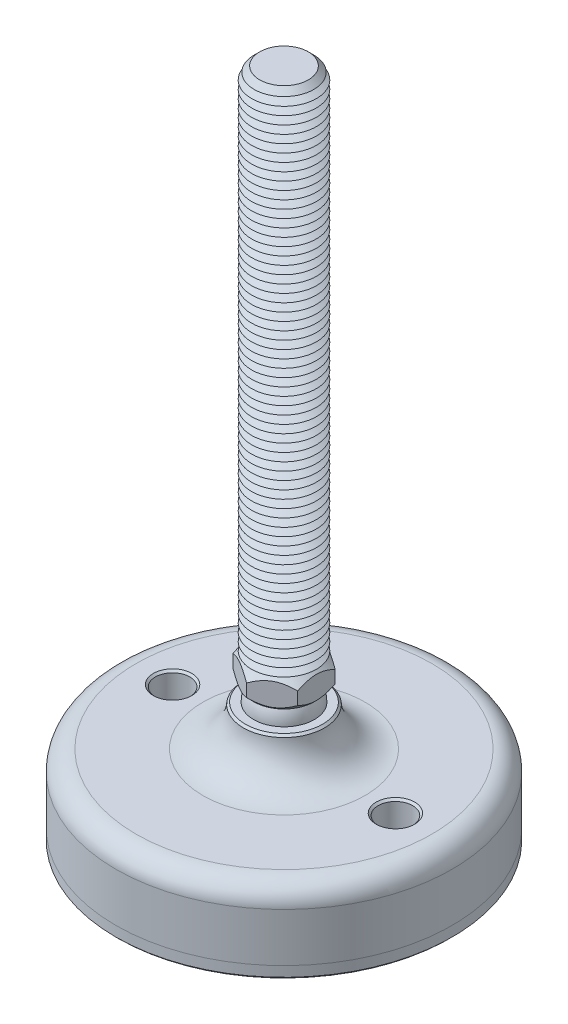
ISO-10303-21;
HEADER;
FILE_DESCRIPTION(('STEP AP214'),'2;1');
FILE_NAME('part.step','',(''),(''),'','','');
FILE_SCHEMA(('AUTOMOTIVE_DESIGN { 1 0 10303 214 1 1 1 1 }'));
ENDSEC;
DATA;
#1=APPLICATION_CONTEXT('core data for automotive mechanical design processes');
#2=APPLICATION_PROTOCOL_DEFINITION('international standard','automotive_design',2000,#1);
#3=PRODUCT_CONTEXT('',#1,'mechanical');
#4=PRODUCT('Part','Part','',(#3));
#5=PRODUCT_RELATED_PRODUCT_CATEGORY('part','',(#4));
#6=PRODUCT_DEFINITION_FORMATION('','',#4);
#7=PRODUCT_DEFINITION_CONTEXT('part definition',#1,'design');
#8=PRODUCT_DEFINITION('design','',#6,#7);
#9=PRODUCT_DEFINITION_SHAPE('','',#8);
#10=(LENGTH_UNIT() NAMED_UNIT(*) SI_UNIT(.MILLI.,.METRE.));
#11=(NAMED_UNIT(*) PLANE_ANGLE_UNIT() SI_UNIT($,.RADIAN.));
#12=(NAMED_UNIT(*) SI_UNIT($,.STERADIAN.) SOLID_ANGLE_UNIT());
#13=UNCERTAINTY_MEASURE_WITH_UNIT(LENGTH_MEASURE(1.E-05),#10,'distance_accuracy_value','');
#14=(GEOMETRIC_REPRESENTATION_CONTEXT(3) GLOBAL_UNCERTAINTY_ASSIGNED_CONTEXT((#13)) GLOBAL_UNIT_ASSIGNED_CONTEXT((#10,
#11,#12)) REPRESENTATION_CONTEXT('',''));
#15=CARTESIAN_POINT('',(0.,0.,0.));
#16=DIRECTION('',(0.,0.,1.));
#17=DIRECTION('',(1.,0.,0.));
#18=AXIS2_PLACEMENT_3D('',#15,#16,#17);
#19=CARTESIAN_POINT('',(0.,-27.,0.));
#20=DIRECTION('',(0.,1.,0.));
#21=DIRECTION('',(0.,0.,1.));
#22=AXIS2_PLACEMENT_3D('',#19,#20,#21);
#23=PLANE('',#22);
#24=CARTESIAN_POINT('',(-27.5,-27.,0.));
#25=DIRECTION('',(0.,1.,0.));
#26=DIRECTION('',(0.,0.,1.));
#27=AXIS2_PLACEMENT_3D('',#24,#25,#26);
#28=CIRCLE('',#27,4.25000000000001);
#29=CARTESIAN_POINT('',(-27.5,-27.,4.25000000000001));
#30=VERTEX_POINT('',#29);
#31=EDGE_CURVE('P0_E43',#30,#30,#28,.T.);
#32=ORIENTED_EDGE('',*,*,#31,.F.);
#33=EDGE_LOOP('',(#32));
#34=FACE_BOUND('',#33,.T.);
#35=CARTESIAN_POINT('',(27.5,-27.,0.));
#36=DIRECTION('',(0.,1.,0.));
#37=DIRECTION('',(0.,0.,1.));
#38=AXIS2_PLACEMENT_3D('',#35,#36,#37);
#39=CIRCLE('',#38,4.25000000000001);
#40=CARTESIAN_POINT('',(27.5,-27.,4.25000000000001));
#41=VERTEX_POINT('',#40);
#42=EDGE_CURVE('P0_E44',#41,#41,#39,.T.);
#43=ORIENTED_EDGE('',*,*,#42,.F.);
#44=EDGE_LOOP('',(#43));
#45=FACE_BOUND('',#44,.T.);
#46=CARTESIAN_POINT('',(0.,-27.,0.));
#47=DIRECTION('',(0.,1.,0.));
#48=DIRECTION('',(0.,0.,1.));
#49=AXIS2_PLACEMENT_3D('',#46,#47,#48);
#50=CIRCLE('',#49,41.5);
#51=CARTESIAN_POINT('',(0.,-27.,41.5));
#52=VERTEX_POINT('',#51);
#53=EDGE_CURVE('P0_E40',#52,#52,#50,.T.);
#54=ORIENTED_EDGE('',*,*,#53,.T.);
#55=EDGE_LOOP('',(#54));
#56=FACE_BOUND('',#55,.T.);
#57=ADVANCED_FACE('P0_F14',(#34,#45,#56),#23,.T.);
#58=CARTESIAN_POINT('',(0.,48.1654938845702,0.));
#59=DIRECTION('',(0.,1.,0.));
#60=DIRECTION('',(0.,0.,1.));
#61=AXIS2_PLACEMENT_3D('',#58,#59,#60);
#62=CYLINDRICAL_SURFACE('',#61,41.5);
#63=CARTESIAN_POINT('',(0.,-29.5,0.));
#64=DIRECTION('',(0.,-1.,0.));
#65=DIRECTION('',(0.,0.,-1.));
#66=AXIS2_PLACEMENT_3D('',#63,#64,#65);
#67=CIRCLE('',#66,41.5);
#68=CARTESIAN_POINT('',(0.,-29.5,-41.5));
#69=VERTEX_POINT('',#68);
#70=EDGE_CURVE('P0_E37',#69,#69,#67,.F.);
#71=ORIENTED_EDGE('',*,*,#70,.T.);
#72=EDGE_LOOP('',(#71));
#73=FACE_BOUND('',#72,.T.);
#74=ORIENTED_EDGE('',*,*,#53,.F.);
#75=EDGE_LOOP('',(#74));
#76=FACE_BOUND('',#75,.T.);
#77=ADVANCED_FACE('P0_F54',(#73,#76),#62,.T.);
#78=CARTESIAN_POINT('',(0.,-30.,41.5));
#79=DIRECTION('',(0.,-1.,0.));
#80=DIRECTION('',(0.,0.,-1.));
#81=AXIS2_PLACEMENT_3D('',#78,#79,#80);
#82=PLANE('',#81);
#83=CARTESIAN_POINT('',(27.5,-30.,0.));
#84=DIRECTION('',(0.,-1.,0.));
#85=DIRECTION('',(0.,0.,-1.));
#86=AXIS2_PLACEMENT_3D('',#83,#84,#85);
#87=CIRCLE('',#86,4.75);
#88=CARTESIAN_POINT('',(27.5,-30.,-4.75000000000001));
#89=VERTEX_POINT('',#88);
#90=EDGE_CURVE('P0_E25',#89,#89,#87,.F.);
#91=ORIENTED_EDGE('',*,*,#90,.T.);
#92=EDGE_LOOP('',(#91));
#93=FACE_BOUND('',#92,.T.);
#94=CARTESIAN_POINT('',(-27.5,-30.,0.));
#95=DIRECTION('',(0.,-1.,0.));
#96=DIRECTION('',(0.,0.,-1.));
#97=AXIS2_PLACEMENT_3D('',#94,#95,#96);
#98=CIRCLE('',#97,4.75);
#99=CARTESIAN_POINT('',(-27.5,-30.,-4.75));
#100=VERTEX_POINT('',#99);
#101=EDGE_CURVE('P0_E29',#100,#100,#98,.F.);
#102=ORIENTED_EDGE('',*,*,#101,.T.);
#103=EDGE_LOOP('',(#102));
#104=FACE_BOUND('',#103,.T.);
#105=CARTESIAN_POINT('',(0.,-30.,0.));
#106=DIRECTION('',(0.,-1.,0.));
#107=DIRECTION('',(0.,0.,-1.));
#108=AXIS2_PLACEMENT_3D('',#105,#106,#107);
#109=CIRCLE('',#108,41.);
#110=CARTESIAN_POINT('',(0.,-30.,-41.));
#111=VERTEX_POINT('',#110);
#112=EDGE_CURVE('P0_E34',#111,#111,#109,.T.);
#113=ORIENTED_EDGE('',*,*,#112,.T.);
#114=EDGE_LOOP('',(#113));
#115=FACE_BOUND('',#114,.T.);
#116=ADVANCED_FACE('P0_F61',(#93,#104,#115),#82,.T.);
#117=CARTESIAN_POINT('',(0.,-29.5,0.));
#118=DIRECTION('',(0.,1.,0.));
#119=DIRECTION('',(0.,0.,1.));
#120=AXIS2_PLACEMENT_3D('',#117,#118,#119);
#121=CONICAL_SURFACE('',#120,41.5,0.785398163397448);
#122=ORIENTED_EDGE('',*,*,#112,.F.);
#123=EDGE_LOOP('',(#122));
#124=FACE_BOUND('',#123,.T.);
#125=ORIENTED_EDGE('',*,*,#70,.F.);
#126=EDGE_LOOP('',(#125));
#127=FACE_BOUND('',#126,.T.);
#128=ADVANCED_FACE('P0_F68',(#124,#127),#121,.T.);
#129=CARTESIAN_POINT('',(27.5,-30.,0.));
#130=DIRECTION('',(0.,1.,0.));
#131=DIRECTION('',(0.,0.,1.));
#132=AXIS2_PLACEMENT_3D('',#129,#130,#131);
#133=CYLINDRICAL_SURFACE('',#132,4.25000000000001);
#134=CARTESIAN_POINT('',(27.5,-29.5,0.));
#135=DIRECTION('',(0.,-1.,0.));
#136=DIRECTION('',(0.,0.,-1.));
#137=AXIS2_PLACEMENT_3D('',#134,#135,#136);
#138=CIRCLE('',#137,4.25000000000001);
#139=CARTESIAN_POINT('',(27.5,-29.5,-4.25000000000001));
#140=VERTEX_POINT('',#139);
#141=EDGE_CURVE('P0_E21',#140,#140,#138,.T.);
#142=ORIENTED_EDGE('',*,*,#141,.T.);
#143=EDGE_LOOP('',(#142));
#144=FACE_BOUND('',#143,.T.);
#145=ORIENTED_EDGE('',*,*,#42,.T.);
#146=EDGE_LOOP('',(#145));
#147=FACE_BOUND('',#146,.T.);
#148=ADVANCED_FACE('P0_F74',(#144,#147),#133,.F.);
#149=CARTESIAN_POINT('',(-27.5,-30.,0.));
#150=DIRECTION('',(0.,1.,0.));
#151=DIRECTION('',(0.,0.,1.));
#152=AXIS2_PLACEMENT_3D('',#149,#150,#151);
#153=CYLINDRICAL_SURFACE('',#152,4.25000000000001);
#154=CARTESIAN_POINT('',(-27.5,-29.5,0.));
#155=DIRECTION('',(0.,-1.,0.));
#156=DIRECTION('',(0.,0.,-1.));
#157=AXIS2_PLACEMENT_3D('',#154,#155,#156);
#158=CIRCLE('',#157,4.25000000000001);
#159=CARTESIAN_POINT('',(-27.5,-29.5,-4.25000000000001));
#160=VERTEX_POINT('',#159);
#161=EDGE_CURVE('P0_E10',#160,#160,#158,.T.);
#162=ORIENTED_EDGE('',*,*,#161,.T.);
#163=EDGE_LOOP('',(#162));
#164=FACE_BOUND('',#163,.T.);
#165=ORIENTED_EDGE('',*,*,#31,.T.);
#166=EDGE_LOOP('',(#165));
#167=FACE_BOUND('',#166,.T.);
#168=ADVANCED_FACE('P0_F50',(#164,#167),#153,.F.);
#169=CARTESIAN_POINT('',(27.5,-30.,0.));
#170=DIRECTION('',(0.,-1.,0.));
#171=DIRECTION('',(0.,0.,-1.));
#172=AXIS2_PLACEMENT_3D('',#169,#170,#171);
#173=CONICAL_SURFACE('',#172,4.75,0.785398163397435);
#174=ORIENTED_EDGE('',*,*,#141,.F.);
#175=EDGE_LOOP('',(#174));
#176=FACE_BOUND('',#175,.T.);
#177=ORIENTED_EDGE('',*,*,#90,.F.);
#178=EDGE_LOOP('',(#177));
#179=FACE_BOUND('',#178,.T.);
#180=ADVANCED_FACE('P0_F76',(#176,#179),#173,.F.);
#181=CARTESIAN_POINT('',(-27.5,-30.,0.));
#182=DIRECTION('',(0.,-1.,0.));
#183=DIRECTION('',(0.,0.,-1.));
#184=AXIS2_PLACEMENT_3D('',#181,#182,#183);
#185=CONICAL_SURFACE('',#184,4.75,0.785398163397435);
#186=ORIENTED_EDGE('',*,*,#161,.F.);
#187=EDGE_LOOP('',(#186));
#188=FACE_BOUND('',#187,.T.);
#189=ORIENTED_EDGE('',*,*,#101,.F.);
#190=EDGE_LOOP('',(#189));
#191=FACE_BOUND('',#190,.T.);
#192=ADVANCED_FACE('P0_F16',(#188,#191),#185,.F.);
#193=CLOSED_SHELL('',(#57,#77,#116,#128,#148,#168,#180,#192));
#194=MANIFOLD_SOLID_BREP('P0_B1',#193);
#195=CARTESIAN_POINT('',(0.,3.75,0.));
#196=DIRECTION('',(0.,1.,0.));
#197=DIRECTION('',(0.,0.,1.));
#198=AXIS2_PLACEMENT_3D('',#195,#196,#197);
#199=PLANE('',#198);
#200=CARTESIAN_POINT('',(0.,3.75,0.));
#201=DIRECTION('',(0.,1.,0.));
#202=DIRECTION('',(0.,0.,1.));
#203=AXIS2_PLACEMENT_3D('',#200,#201,#202);
#204=CIRCLE('',#203,7.41889346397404);
#205=CARTESIAN_POINT('',(0.,3.75,7.41889346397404));
#206=VERTEX_POINT('',#205);
#207=EDGE_CURVE('P1_E213',#206,#206,#204,.T.);
#208=ORIENTED_EDGE('',*,*,#207,.F.);
#209=EDGE_LOOP('',(#208));
#210=FACE_BOUND('',#209,.T.);
#211=CARTESIAN_POINT('',(0.,3.75,0.));
#212=DIRECTION('',(0.,1.,0.));
#213=DIRECTION('',(0.,0.,1.));
#214=AXIS2_PLACEMENT_3D('',#211,#212,#213);
#215=CIRCLE('',#214,6.49519052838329);
#216=CARTESIAN_POINT('',(0.,3.75,6.49519052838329));
#217=VERTEX_POINT('',#216);
#218=EDGE_CURVE('P1_E25',#217,#217,#215,.F.);
#219=ORIENTED_EDGE('',*,*,#218,.F.);
#220=EDGE_LOOP('',(#219));
#221=FACE_BOUND('',#220,.T.);
#222=ADVANCED_FACE('P1_F16',(#210,#221),#199,.F.);
#223=CARTESIAN_POINT('',(0.,0.,0.));
#224=DIRECTION('',(0.,1.,0.));
#225=DIRECTION('',(0.,0.,-1.));
#226=AXIS2_PLACEMENT_3D('',#223,#224,#225);
#227=SPHERICAL_SURFACE('',#226,7.5);
#228=ORIENTED_EDGE('',*,*,#218,.T.);
#229=EDGE_LOOP('',(#228));
#230=FACE_BOUND('',#229,.T.);
#231=ADVANCED_FACE('P1_F203',(#230),#227,.T.);
#232=CARTESIAN_POINT('',(0.,3.75,0.));
#233=DIRECTION('',(0.,1.,0.));
#234=DIRECTION('',(0.,0.,1.));
#235=AXIS2_PLACEMENT_3D('',#232,#233,#234);
#236=CONICAL_SURFACE('',#235,7.41889346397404,0.785398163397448);
#237=ORIENTED_EDGE('',*,*,#207,.T.);
#238=EDGE_LOOP('',(#237));
#239=FACE_BOUND('',#238,.T.);
#240=CARTESIAN_POINT('',(-8.,8.67915108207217,-9.40607272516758));
#241=CARTESIAN_POINT('',(-8.,8.50538061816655,-9.17789983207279));
#242=CARTESIAN_POINT('',(-8.,8.33323236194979,-8.94847140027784));
#243=CARTESIAN_POINT('',(-8.,7.99291342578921,-8.48659991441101));
#244=CARTESIAN_POINT('',(-8.,7.82474372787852,-8.2541561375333));
#245=CARTESIAN_POINT('',(-8.,7.49191829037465,-7.78405005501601));
#246=CARTESIAN_POINT('',(-8.,7.32729980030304,-7.54636128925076));
#247=CARTESIAN_POINT('',(-8.,7.00401259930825,-7.066984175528));
#248=CARTESIAN_POINT('',(-8.,6.8453434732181,-6.82529610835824));
#249=CARTESIAN_POINT('',(-8.,6.52599353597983,-6.32262937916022));
#250=CARTESIAN_POINT('',(-8.,6.36576297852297,-6.06136321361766));
#251=CARTESIAN_POINT('',(-8.,6.05556462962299,-5.53271317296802));
#252=CARTESIAN_POINT('',(-8.,5.90559851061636,-5.26532831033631));
#253=CARTESIAN_POINT('',(-8.,5.61914583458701,-4.72442075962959));
#254=CARTESIAN_POINT('',(-8.,5.48261965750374,-4.45091921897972));
#255=CARTESIAN_POINT('',(-8.,5.22610459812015,-3.8963297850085));
#256=CARTESIAN_POINT('',(-8.,5.10610808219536,-3.61524546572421));
#257=CARTESIAN_POINT('',(-8.,4.89671738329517,-3.07036571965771));
#258=CARTESIAN_POINT('',(-8.,4.80554986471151,-2.80725883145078));
#259=CARTESIAN_POINT('',(-8.,4.64429812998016,-2.27454068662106));
#260=CARTESIAN_POINT('',(-8.,4.57421531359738,-2.00492899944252));
#261=CARTESIAN_POINT('',(-8.,4.46001937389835,-1.46539071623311));
#262=CARTESIAN_POINT('',(-8.,4.41544920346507,-1.19556248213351));
#263=CARTESIAN_POINT('',(-8.,4.35317465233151,-0.652806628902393));
#264=CARTESIAN_POINT('',(-8.,4.33546523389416,-0.379879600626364));
#265=CARTESIAN_POINT('',(-8.,4.3283167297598,0.155555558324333));
#266=CARTESIAN_POINT('',(-8.,4.33778869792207,0.418049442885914));
#267=CARTESIAN_POINT('',(-8.,4.38202991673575,0.940882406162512));
#268=CARTESIAN_POINT('',(-8.,4.41680155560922,1.2012212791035));
#269=CARTESIAN_POINT('',(-8.,4.51030475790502,1.72226548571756));
#270=CARTESIAN_POINT('',(-8.,4.56945097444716,1.9828951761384));
#271=CARTESIAN_POINT('',(-8.,4.7084911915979,2.498449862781));
#272=CARTESIAN_POINT('',(-8.,4.78838370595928,2.75337526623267));
#273=CARTESIAN_POINT('',(-8.,4.97226877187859,3.27629811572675));
#274=CARTESIAN_POINT('',(-8.,5.07763590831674,3.54380699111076));
#275=CARTESIAN_POINT('',(-8.,5.3045984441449,4.07191058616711));
#276=CARTESIAN_POINT('',(-8.,5.4262012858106,4.33250206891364));
#277=CARTESIAN_POINT('',(-8.,5.68274705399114,4.84802310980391));
#278=CARTESIAN_POINT('',(-8.,5.81773148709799,5.10293184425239));
#279=CARTESIAN_POINT('',(-8.,6.09806326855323,5.60689577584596));
#280=CARTESIAN_POINT('',(-8.,6.24340899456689,5.85595188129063));
#281=CARTESIAN_POINT('',(-8.,6.53502315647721,6.33676586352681));
#282=CARTESIAN_POINT('',(-8.,6.68088884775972,6.56876930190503));
#283=CARTESIAN_POINT('',(-8.,6.97879220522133,7.0287915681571));
#284=CARTESIAN_POINT('',(-8.,7.13083033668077,7.2568100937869));
#285=CARTESIAN_POINT('',(-8.,7.43872962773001,7.70754250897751));
#286=CARTESIAN_POINT('',(-8.,7.59454998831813,7.93028436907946));
#287=CARTESIAN_POINT('',(-8.,7.9103399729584,8.37271804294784));
#288=CARTESIAN_POINT('',(-8.,8.07030844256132,8.59241067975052));
#289=CARTESIAN_POINT('',(-8.,8.23197385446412,8.81082532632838));
#290=B_SPLINE_CURVE_WITH_KNOTS('',3,(#240,#241,#242,#243,#244,#245,#246,#247,#248,#249,#250,
#251,#252,#253,#254,#255,#256,#257,#258,#259,#260,#261,#262,#263,#264,#265,#266,#267,#268,#269,
#270,#271,#272,#273,#274,#275,#276,#277,#278,#279,#280,#281,#282,#283,#284,#285,#286,#287,#288,
#289),.UNSPECIFIED.,.F.,.F.,(4,2,2,2,2,2,2,2,2,2,2,2,2,2,2,2,2,2,2,2,2,2,2,2,4),(0.,
0.860441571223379,1.72109335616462,2.58840332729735,3.4556526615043,4.3749240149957,
5.2943447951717,6.21096847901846,7.12716742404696,7.96180281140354,8.7964935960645,
9.6157214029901,10.4347955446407,11.2215193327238,12.0083173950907,12.8090921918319,
13.6098096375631,14.471679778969,15.3339463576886,16.1989765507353,17.0638715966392,
17.8859014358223,18.7079933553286,19.5234450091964,20.3386721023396),.UNSPECIFIED.);
#291=CARTESIAN_POINT('',(-8.,5.56871084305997,-4.61880215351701));
#292=VERTEX_POINT('',#291);
#293=CARTESIAN_POINT('',(-8.,5.56871084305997,4.61880215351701));
#294=VERTEX_POINT('',#293);
#295=EDGE_CURVE('P1_E187',#292,#294,#290,.T.);
#296=ORIENTED_EDGE('',*,*,#295,.F.);
#297=CARTESIAN_POINT('',(0.000200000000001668,5.56882631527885,-9.23771977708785));
#298=CARTESIAN_POINT('',(-0.137352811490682,5.48941910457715,-9.15830362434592));
#299=CARTESIAN_POINT('',(-0.275962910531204,5.41244881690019,-9.07827704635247));
#300=CARTESIAN_POINT('',(-0.55550509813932,5.2641233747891,-8.91688328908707));
#301=CARTESIAN_POINT('',(-0.696438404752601,5.19277128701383,-8.83551540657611));
#302=CARTESIAN_POINT('',(-1.12434348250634,4.98764582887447,-8.58846429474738));
#303=CARTESIAN_POINT('',(-1.41493761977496,4.86367829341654,-8.42068969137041));
#304=CARTESIAN_POINT('',(-2.00094388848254,4.65139259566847,-8.08235881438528));
#305=CARTESIAN_POINT('',(-2.29620625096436,4.56253963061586,-7.91188900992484));
#306=CARTESIAN_POINT('',(-2.74395385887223,4.45975870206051,-7.65338180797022));
#307=CARTESIAN_POINT('',(-2.89386225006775,4.43059522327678,-7.5668321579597));
#308=CARTESIAN_POINT('',(-3.19494827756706,4.38309436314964,-7.39300005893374));
#309=CARTESIAN_POINT('',(-3.34612572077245,4.36475536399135,-7.30571772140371));
#310=CARTESIAN_POINT('',(-3.71452735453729,4.33400721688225,-7.09302093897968));
#311=CARTESIAN_POINT('',(-3.93214848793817,4.32755588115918,-6.96737731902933));
#312=CARTESIAN_POINT('',(-4.36699849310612,4.33838546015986,-6.71631655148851));
#313=CARTESIAN_POINT('',(-4.58422720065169,4.3556746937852,-6.59089949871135));
#314=CARTESIAN_POINT('',(-5.01663658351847,4.41296627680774,-6.3412478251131));
#315=CARTESIAN_POINT('',(-5.23181469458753,4.45299402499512,-6.21701468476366));
#316=CARTESIAN_POINT('',(-5.65847251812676,4.55358648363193,-5.97068367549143));
#317=CARTESIAN_POINT('',(-5.86995251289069,4.61414961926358,-5.84858564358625));
#318=CARTESIAN_POINT('',(-6.24536139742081,4.73874447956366,-5.63184322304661));
#319=CARTESIAN_POINT('',(-6.41012167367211,4.79949896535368,-5.53671883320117));
#320=CARTESIAN_POINT('',(-6.73668469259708,4.93079799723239,-5.34817758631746));
#321=CARTESIAN_POINT('',(-6.89848734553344,5.00134283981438,-5.25476078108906));
#322=CARTESIAN_POINT('',(-7.21862548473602,5.1506413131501,-5.06992894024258));
#323=CARTESIAN_POINT('',(-7.37697007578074,5.22936912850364,-4.97850864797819));
#324=CARTESIAN_POINT('',(-7.69072726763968,5.39400001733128,-4.79736084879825));
#325=CARTESIAN_POINT('',(-7.84614159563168,5.47989869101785,-4.70763234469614));
#326=CARTESIAN_POINT('',(-8.0002,5.56882631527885,-4.61868668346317));
#327=B_SPLINE_CURVE_WITH_KNOTS('',3,(#297,#298,#299,#300,#301,#302,#303,#304,#305,#306,#307,
#308,#309,#310,#311,#312,#313,#314,#315,#316,#317,#318,#319,#320,#321,#322,#323,#324,#325,#326),
.UNSPECIFIED.,.F.,.F.,(4,2,2,2,2,2,2,2,2,2,2,2,2,2,4),(0.,0.53269658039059,1.06568194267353,
2.13740664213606,3.19211397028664,3.71843331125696,4.24467396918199,4.99761238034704,
5.75081469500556,6.50485999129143,7.25884747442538,7.85770857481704,8.45658781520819,
9.05363199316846,9.65031250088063),.UNSPECIFIED.);
#328=CARTESIAN_POINT('',(0.,5.56871084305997,-9.23760430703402));
#329=VERTEX_POINT('',#328);
#330=EDGE_CURVE('P1_E181',#329,#292,#327,.T.);
#331=ORIENTED_EDGE('',*,*,#330,.F.);
#332=CARTESIAN_POINT('',(8.0002,5.56882631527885,-4.61868668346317));
#333=CARTESIAN_POINT('',(7.86264718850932,5.48941910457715,-4.69810283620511));
#334=CARTESIAN_POINT('',(7.72403708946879,5.4124488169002,-4.77812941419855));
#335=CARTESIAN_POINT('',(7.44449490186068,5.2641233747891,-4.93952317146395));
#336=CARTESIAN_POINT('',(7.3035615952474,5.19277128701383,-5.02089105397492));
#337=CARTESIAN_POINT('',(6.87565651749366,4.98764582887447,-5.26794216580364));
#338=CARTESIAN_POINT('',(6.58506238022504,4.86367829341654,-5.43571676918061));
#339=CARTESIAN_POINT('',(5.99905611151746,4.65139259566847,-5.77404764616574));
#340=CARTESIAN_POINT('',(5.70379374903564,4.56253963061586,-5.94451745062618));
#341=CARTESIAN_POINT('',(5.25604614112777,4.45975870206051,-6.2030246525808));
#342=CARTESIAN_POINT('',(5.10613774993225,4.43059522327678,-6.28957430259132));
#343=CARTESIAN_POINT('',(4.80505172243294,4.38309436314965,-6.46340640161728));
#344=CARTESIAN_POINT('',(4.65387427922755,4.36475536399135,-6.55068873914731));
#345=CARTESIAN_POINT('',(4.28547264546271,4.33400721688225,-6.76338552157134));
#346=CARTESIAN_POINT('',(4.06785151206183,4.32755588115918,-6.88902914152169));
#347=CARTESIAN_POINT('',(3.63300150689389,4.33838546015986,-7.14008990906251));
#348=CARTESIAN_POINT('',(3.41577279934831,4.3556746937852,-7.26550696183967));
#349=CARTESIAN_POINT('',(2.98336341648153,4.41296627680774,-7.51515863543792));
#350=CARTESIAN_POINT('',(2.76818530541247,4.45299402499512,-7.63939177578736));
#351=CARTESIAN_POINT('',(2.34152748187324,4.55358648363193,-7.88572278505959));
#352=CARTESIAN_POINT('',(2.13004748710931,4.61414961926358,-8.00782081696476));
#353=CARTESIAN_POINT('',(1.75463860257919,4.73874447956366,-8.22456323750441));
#354=CARTESIAN_POINT('',(1.58987832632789,4.79949896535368,-8.31968762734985));
#355=CARTESIAN_POINT('',(1.26331530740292,4.93079799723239,-8.50822887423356));
#356=CARTESIAN_POINT('',(1.10151265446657,5.00134283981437,-8.60164567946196));
#357=CARTESIAN_POINT('',(0.781374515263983,5.1506413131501,-8.78647752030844));
#358=CARTESIAN_POINT('',(0.623029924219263,5.22936912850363,-8.87789781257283));
#359=CARTESIAN_POINT('',(0.309272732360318,5.39400001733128,-9.05904561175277));
#360=CARTESIAN_POINT('',(0.153858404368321,5.47989869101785,-9.14877411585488));
#361=CARTESIAN_POINT('',(-0.000199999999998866,5.56882631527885,-9.23771977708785));
#362=B_SPLINE_CURVE_WITH_KNOTS('',3,(#332,#333,#334,#335,#336,#337,#338,#339,#340,#341,#342,
#343,#344,#345,#346,#347,#348,#349,#350,#351,#352,#353,#354,#355,#356,#357,#358,#359,#360,#361),
.UNSPECIFIED.,.F.,.F.,(4,2,2,2,2,2,2,2,2,2,2,2,2,2,4),(0.,0.532696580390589,1.06568194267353,
2.13740664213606,3.19211397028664,3.71843331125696,4.24467396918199,4.99761238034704,
5.75081469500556,6.50485999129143,7.25884747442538,7.85770857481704,8.45658781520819,
9.05363199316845,9.65031250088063),.UNSPECIFIED.);
#363=CARTESIAN_POINT('',(8.,5.56871084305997,-4.61880215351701));
#364=VERTEX_POINT('',#363);
#365=EDGE_CURVE('P1_E169',#364,#329,#362,.T.);
#366=ORIENTED_EDGE('',*,*,#365,.F.);
#367=CARTESIAN_POINT('',(8.,8.67915108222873,-9.40607272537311));
#368=CARTESIAN_POINT('',(8.,8.50538061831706,-9.17789983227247));
#369=CARTESIAN_POINT('',(8.,8.33323236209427,-8.94847140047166));
#370=CARTESIAN_POINT('',(8.,7.99291342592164,-8.48659991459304));
#371=CARTESIAN_POINT('',(8.,7.82474372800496,-8.25415613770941));
#372=CARTESIAN_POINT('',(8.,7.49191829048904,-7.78405005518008));
#373=CARTESIAN_POINT('',(8.,7.32729980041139,-7.54636128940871));
#374=CARTESIAN_POINT('',(8.,7.00401259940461,-7.0669841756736));
#375=CARTESIAN_POINT('',(8.,6.84534347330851,-6.82529610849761));
#376=CARTESIAN_POINT('',(8.,6.52599353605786,-6.32262937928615));
#377=CARTESIAN_POINT('',(8.,6.36576297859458,-6.06136321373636));
#378=CARTESIAN_POINT('',(8.,6.05556462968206,-5.53271317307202));
#379=CARTESIAN_POINT('',(8.,5.90559851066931,-5.26532831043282));
#380=CARTESIAN_POINT('',(8.,5.61914583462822,-4.72442075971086));
#381=CARTESIAN_POINT('',(8.,5.48261965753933,-4.45091921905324));
#382=CARTESIAN_POINT('',(8.,5.22610459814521,-3.8963297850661));
#383=CARTESIAN_POINT('',(8.,5.10610808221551,-3.61524546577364));
#384=CARTESIAN_POINT('',(8.,4.89671738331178,-3.07036571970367));
#385=CARTESIAN_POINT('',(8.,4.80554986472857,-2.8072588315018));
#386=CARTESIAN_POINT('',(8.,4.6442981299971,-2.27454068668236));
#387=CARTESIAN_POINT('',(8.,4.57421531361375,-2.00492899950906));
#388=CARTESIAN_POINT('',(8.,4.46001937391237,-1.46539071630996));
#389=CARTESIAN_POINT('',(8.,4.41544920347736,-1.19556248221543));
#390=CARTESIAN_POINT('',(8.,4.35317465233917,-0.65280662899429));
#391=CARTESIAN_POINT('',(8.,4.33546523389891,-0.379879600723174));
#392=CARTESIAN_POINT('',(8.,4.32831672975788,0.155555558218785));
#393=CARTESIAN_POINT('',(8.,4.33778869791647,0.41804944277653));
#394=CARTESIAN_POINT('',(8.,4.38202991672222,0.940882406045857));
#395=CARTESIAN_POINT('',(8.,4.41680155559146,1.20122127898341));
#396=CARTESIAN_POINT('',(8.,4.51030475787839,1.72226548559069));
#397=CARTESIAN_POINT('',(8.,4.56945097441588,1.9828951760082));
#398=CARTESIAN_POINT('',(8.,4.70849119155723,2.49844986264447));
#399=CARTESIAN_POINT('',(8.,4.78838370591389,2.75337526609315));
#400=CARTESIAN_POINT('',(8.,4.97226877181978,3.27629811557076));
#401=CARTESIAN_POINT('',(8.,5.07763590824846,3.5438069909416));
#402=CARTESIAN_POINT('',(8.,5.30459844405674,4.07191058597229));
#403=CARTESIAN_POINT('',(8.,5.42620128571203,4.33250206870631));
#404=CARTESIAN_POINT('',(8.,5.68274705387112,4.84802310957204));
#405=CARTESIAN_POINT('',(8.,5.81773148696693,5.10293184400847));
#406=CARTESIAN_POINT('',(8.,6.09806326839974,5.60689577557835));
#407=CARTESIAN_POINT('',(8.,6.24340899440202,5.85595188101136));
#408=CARTESIAN_POINT('',(8.,6.53502315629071,6.33676586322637));
#409=CARTESIAN_POINT('',(8.,6.68088884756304,6.56876930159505));
#410=CARTESIAN_POINT('',(8.,6.97879220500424,7.02879156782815));
#411=CARTESIAN_POINT('',(8.,7.13083033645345,7.25681009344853));
#412=CARTESIAN_POINT('',(8.,7.43872962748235,7.70754250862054));
#413=CARTESIAN_POINT('',(8.,7.59454998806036,7.93028436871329));
#414=CARTESIAN_POINT('',(8.,7.91033997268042,8.37271804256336));
#415=CARTESIAN_POINT('',(8.,8.07030844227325,8.59241067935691));
#416=CARTESIAN_POINT('',(8.,8.23197385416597,8.81082532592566));
#417=B_SPLINE_CURVE_WITH_KNOTS('',3,(#367,#368,#369,#370,#371,#372,#373,#374,#375,#376,#377,
#378,#379,#380,#381,#382,#383,#384,#385,#386,#387,#388,#389,#390,#391,#392,#393,#394,#395,#396,
#397,#398,#399,#400,#401,#402,#403,#404,#405,#406,#407,#408,#409,#410,#411,#412,#413,#414,#415,
#416),.UNSPECIFIED.,.F.,.F.,(4,2,2,2,2,2,2,2,2,2,2,2,2,2,2,2,2,2,2,2,2,2,2,2,4),(0.,
0.860441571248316,1.7210933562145,2.58840332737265,3.45565266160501,4.37492401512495,
5.2943447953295,6.21096847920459,7.12716742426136,7.96180281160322,8.79649359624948,
9.61572140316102,10.4347955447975,11.2215193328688,12.0083173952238,12.8090921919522,
13.6098096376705,14.4716797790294,15.3339463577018,16.1989765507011,17.0638715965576,
17.8859014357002,18.7079933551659,19.5234450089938,20.338672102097),.UNSPECIFIED.);
#418=CARTESIAN_POINT('',(8.,5.56871084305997,4.61880215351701));
#419=VERTEX_POINT('',#418);
#420=EDGE_CURVE('P1_E71',#419,#364,#417,.F.);
#421=ORIENTED_EDGE('',*,*,#420,.F.);
#422=CARTESIAN_POINT('',(-0.000199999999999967,5.56882631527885,9.23771977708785));
#423=CARTESIAN_POINT('',(0.137352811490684,5.48941910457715,9.15830362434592));
#424=CARTESIAN_POINT('',(0.275962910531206,5.41244881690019,9.07827704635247));
#425=CARTESIAN_POINT('',(0.555505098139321,5.2641233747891,8.91688328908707));
#426=CARTESIAN_POINT('',(0.696438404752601,5.19277128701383,8.83551540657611));
#427=CARTESIAN_POINT('',(1.12434348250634,4.98764582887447,8.58846429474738));
#428=CARTESIAN_POINT('',(1.41493761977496,4.86367829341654,8.42068969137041));
#429=CARTESIAN_POINT('',(2.00094388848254,4.65139259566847,8.08235881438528));
#430=CARTESIAN_POINT('',(2.29620625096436,4.56253963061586,7.91188900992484));
#431=CARTESIAN_POINT('',(2.74395385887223,4.45975870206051,7.65338180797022));
#432=CARTESIAN_POINT('',(2.89386225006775,4.43059522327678,7.5668321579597));
#433=CARTESIAN_POINT('',(3.19494827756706,4.38309436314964,7.39300005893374));
#434=CARTESIAN_POINT('',(3.34612572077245,4.36475536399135,7.30571772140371));
#435=CARTESIAN_POINT('',(3.71452735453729,4.33400721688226,7.09302093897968));
#436=CARTESIAN_POINT('',(3.93214848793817,4.32755588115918,6.96737731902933));
#437=CARTESIAN_POINT('',(4.36699849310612,4.33838546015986,6.71631655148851));
#438=CARTESIAN_POINT('',(4.58422720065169,4.3556746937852,6.59089949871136));
#439=CARTESIAN_POINT('',(5.01663658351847,4.41296627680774,6.3412478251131));
#440=CARTESIAN_POINT('',(5.23181469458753,4.45299402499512,6.21701468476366));
#441=CARTESIAN_POINT('',(5.65847251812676,4.55358648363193,5.97068367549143));
#442=CARTESIAN_POINT('',(5.86995251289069,4.61414961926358,5.84858564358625));
#443=CARTESIAN_POINT('',(6.24536139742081,4.73874447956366,5.63184322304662));
#444=CARTESIAN_POINT('',(6.41012167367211,4.79949896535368,5.53671883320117));
#445=CARTESIAN_POINT('',(6.73668469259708,4.93079799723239,5.34817758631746));
#446=CARTESIAN_POINT('',(6.89848734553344,5.00134283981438,5.25476078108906));
#447=CARTESIAN_POINT('',(7.21862548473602,5.1506413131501,5.06992894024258));
#448=CARTESIAN_POINT('',(7.37697007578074,5.22936912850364,4.97850864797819));
#449=CARTESIAN_POINT('',(7.69072726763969,5.39400001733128,4.79736084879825));
#450=CARTESIAN_POINT('',(7.84614159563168,5.47989869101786,4.70763234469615));
#451=CARTESIAN_POINT('',(8.0002,5.56882631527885,4.61868668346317));
#452=B_SPLINE_CURVE_WITH_KNOTS('',3,(#422,#423,#424,#425,#426,#427,#428,#429,#430,#431,#432,
#433,#434,#435,#436,#437,#438,#439,#440,#441,#442,#443,#444,#445,#446,#447,#448,#449,#450,#451),
.UNSPECIFIED.,.F.,.F.,(4,2,2,2,2,2,2,2,2,2,2,2,2,2,4),(0.,0.532696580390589,1.06568194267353,
2.13740664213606,3.19211397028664,3.71843331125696,4.24467396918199,4.99761238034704,
5.75081469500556,6.50485999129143,7.25884747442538,7.85770857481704,8.45658781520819,
9.05363199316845,9.65031250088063),.UNSPECIFIED.);
#453=CARTESIAN_POINT('',(0.,5.56871084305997,9.23760430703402));
#454=VERTEX_POINT('',#453);
#455=EDGE_CURVE('P1_E68',#454,#419,#452,.T.);
#456=ORIENTED_EDGE('',*,*,#455,.F.);
#457=CARTESIAN_POINT('',(-8.0002,5.56882631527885,4.61868668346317));
#458=CARTESIAN_POINT('',(-7.86264718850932,5.48941910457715,4.6981028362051));
#459=CARTESIAN_POINT('',(-7.7240370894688,5.41244881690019,4.77812941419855));
#460=CARTESIAN_POINT('',(-7.44449490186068,5.2641233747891,4.93952317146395));
#461=CARTESIAN_POINT('',(-7.3035615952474,5.19277128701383,5.02089105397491));
#462=CARTESIAN_POINT('',(-6.87565651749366,4.98764582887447,5.26794216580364));
#463=CARTESIAN_POINT('',(-6.58506238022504,4.86367829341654,5.43571676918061));
#464=CARTESIAN_POINT('',(-5.99905611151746,4.65139259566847,5.77404764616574));
#465=CARTESIAN_POINT('',(-5.70379374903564,4.56253963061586,5.94451745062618));
#466=CARTESIAN_POINT('',(-5.25604614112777,4.45975870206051,6.2030246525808));
#467=CARTESIAN_POINT('',(-5.10613774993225,4.43059522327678,6.28957430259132));
#468=CARTESIAN_POINT('',(-4.80505172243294,4.38309436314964,6.46340640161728));
#469=CARTESIAN_POINT('',(-4.65387427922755,4.36475536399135,6.55068873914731));
#470=CARTESIAN_POINT('',(-4.28547264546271,4.33400721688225,6.76338552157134));
#471=CARTESIAN_POINT('',(-4.06785151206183,4.32755588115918,6.88902914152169));
#472=CARTESIAN_POINT('',(-3.63300150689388,4.33838546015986,7.14008990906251));
#473=CARTESIAN_POINT('',(-3.4157727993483,4.3556746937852,7.26550696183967));
#474=CARTESIAN_POINT('',(-2.98336341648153,4.41296627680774,7.51515863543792));
#475=CARTESIAN_POINT('',(-2.76818530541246,4.45299402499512,7.63939177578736));
#476=CARTESIAN_POINT('',(-2.34152748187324,4.55358648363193,7.88572278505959));
#477=CARTESIAN_POINT('',(-2.13004748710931,4.61414961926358,8.00782081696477));
#478=CARTESIAN_POINT('',(-1.75463860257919,4.73874447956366,8.22456323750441));
#479=CARTESIAN_POINT('',(-1.58987832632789,4.79949896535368,8.31968762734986));
#480=CARTESIAN_POINT('',(-1.26331530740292,4.93079799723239,8.50822887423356));
#481=CARTESIAN_POINT('',(-1.10151265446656,5.00134283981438,8.60164567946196));
#482=CARTESIAN_POINT('',(-0.781374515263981,5.1506413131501,8.78647752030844));
#483=CARTESIAN_POINT('',(-0.623029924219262,5.22936912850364,8.87789781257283));
#484=CARTESIAN_POINT('',(-0.309272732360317,5.39400001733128,9.05904561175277));
#485=CARTESIAN_POINT('',(-0.15385840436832,5.47989869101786,9.14877411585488));
#486=CARTESIAN_POINT('',(0.000199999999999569,5.56882631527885,9.23771977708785));
#487=B_SPLINE_CURVE_WITH_KNOTS('',3,(#457,#458,#459,#460,#461,#462,#463,#464,#465,#466,#467,
#468,#469,#470,#471,#472,#473,#474,#475,#476,#477,#478,#479,#480,#481,#482,#483,#484,#485,#486),
.UNSPECIFIED.,.F.,.F.,(4,2,2,2,2,2,2,2,2,2,2,2,2,2,4),(0.,0.532696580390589,1.06568194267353,
2.13740664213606,3.19211397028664,3.71843331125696,4.244673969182,4.99761238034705,
5.75081469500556,6.50485999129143,7.25884747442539,7.85770857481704,8.4565878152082,
9.05363199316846,9.65031250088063),.UNSPECIFIED.);
#488=EDGE_CURVE('P1_E40',#294,#454,#487,.T.);
#489=ORIENTED_EDGE('',*,*,#488,.F.);
#490=EDGE_LOOP('',(#296,#331,#366,#421,#456,#489));
#491=FACE_BOUND('',#490,.T.);
#492=ADVANCED_FACE('P1_F69',(#239,#491),#236,.T.);
#493=CARTESIAN_POINT('',(-8.,11.,-4.61880215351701));
#494=DIRECTION('',(1.,0.,0.));
#495=DIRECTION('',(0.,0.,-1.));
#496=AXIS2_PLACEMENT_3D('',#493,#494,#495);
#497=PLANE('',#496);
#498=DIRECTION('',(0.,-1.,0.));
#499=VECTOR('',#498,1.);
#500=CARTESIAN_POINT('',(-8.,11.,4.61880215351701));
#501=LINE('',#500,#499);
#502=CARTESIAN_POINT('',(-8.,8.6905989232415,4.61880215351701));
#503=VERTEX_POINT('',#502);
#504=EDGE_CURVE('P1_E84',#503,#294,#501,.T.);
#505=ORIENTED_EDGE('',*,*,#504,.F.);
#506=CARTESIAN_POINT('',(-8.,5.72751350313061,-9.21177669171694));
#507=CARTESIAN_POINT('',(-8.,5.89682366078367,-8.98748005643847));
#508=CARTESIAN_POINT('',(-8.,6.06449721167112,-8.76192759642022));
#509=CARTESIAN_POINT('',(-8.,6.39583833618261,-8.30781564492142));
#510=CARTESIAN_POINT('',(-8.,6.55950489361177,-8.07925541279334));
#511=CARTESIAN_POINT('',(-8.,6.88326292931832,-7.6169606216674));
#512=CARTESIAN_POINT('',(-8.,7.04331688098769,-7.38319969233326));
#513=CARTESIAN_POINT('',(-8.,7.35745062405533,-6.91170999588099));
#514=CARTESIAN_POINT('',(-8.,7.51153083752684,-6.67398151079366));
#515=CARTESIAN_POINT('',(-8.,7.82098685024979,-6.18020562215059));
#516=CARTESIAN_POINT('',(-8.,7.97593334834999,-5.92388779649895));
#517=CARTESIAN_POINT('',(-8.,8.2756319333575,-5.40526917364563));
#518=CARTESIAN_POINT('',(-8.,8.42038240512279,-5.14296743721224));
#519=CARTESIAN_POINT('',(-8.,8.69656572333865,-4.61240539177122));
#520=CARTESIAN_POINT('',(-8.,8.82803773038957,-4.3441656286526));
#521=CARTESIAN_POINT('',(-8.,9.07472095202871,-3.80037048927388));
#522=CARTESIAN_POINT('',(-8.,9.18993952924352,-3.52481849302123));
#523=CARTESIAN_POINT('',(-8.,9.39155974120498,-2.98846490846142));
#524=CARTESIAN_POINT('',(-8.,9.47953421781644,-2.72826076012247));
#525=CARTESIAN_POINT('',(-8.,9.63460815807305,-2.20158778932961));
#526=CARTESIAN_POINT('',(-8.,9.70170618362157,-1.93511853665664));
#527=CARTESIAN_POINT('',(-8.,9.81040693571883,-1.40193852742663));
#528=CARTESIAN_POINT('',(-8.,9.85244648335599,-1.13531830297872));
#529=CARTESIAN_POINT('',(-8.,9.91021431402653,-0.599227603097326));
#530=CARTESIAN_POINT('',(-8.,9.92594711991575,-0.329757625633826));
#531=CARTESIAN_POINT('',(-8.,9.92993303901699,0.1996220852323));
#532=CARTESIAN_POINT('',(-8.,9.91916018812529,0.459524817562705));
#533=CARTESIAN_POINT('',(-8.,9.87287879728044,0.977104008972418));
#534=CARTESIAN_POINT('',(-8.,9.83736785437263,1.23478024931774));
#535=CARTESIAN_POINT('',(-8.,9.74294362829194,1.75039800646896));
#536=CARTESIAN_POINT('',(-8.,9.68363209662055,2.00826541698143));
#537=CARTESIAN_POINT('',(-8.,9.544769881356,2.51838158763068));
#538=CARTESIAN_POINT('',(-8.,9.46522089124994,2.77063081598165));
#539=CARTESIAN_POINT('',(-8.,9.28097494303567,3.29235438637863));
#540=CARTESIAN_POINT('',(-8.,9.17462363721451,3.56123855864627));
#541=CARTESIAN_POINT('',(-8.,8.94559365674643,4.09202258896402));
#542=CARTESIAN_POINT('',(-8.,8.82290737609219,4.35391912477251));
#543=CARTESIAN_POINT('',(-8.,8.56412641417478,4.87200778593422));
#544=CARTESIAN_POINT('',(-8.,8.42798963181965,5.12817871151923));
#545=CARTESIAN_POINT('',(-8.,8.14531665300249,5.63462540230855));
#546=CARTESIAN_POINT('',(-8.,7.99878211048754,5.88490209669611));
#547=CARTESIAN_POINT('',(-8.,7.70486004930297,6.36801618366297));
#548=CARTESIAN_POINT('',(-8.,7.55787799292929,6.60110156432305));
#549=CARTESIAN_POINT('',(-8.,7.25773303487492,7.06327081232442));
#550=CARTESIAN_POINT('',(-8.,7.10456966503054,7.29235437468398));
#551=CARTESIAN_POINT('',(-8.,6.79443207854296,7.74518607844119));
#552=CARTESIAN_POINT('',(-8.,6.63749892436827,7.96896244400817));
#553=CARTESIAN_POINT('',(-8.,6.31948249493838,8.413457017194));
#554=CARTESIAN_POINT('',(-8.,6.15840037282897,8.63417604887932));
#555=CARTESIAN_POINT('',(-8.,5.99562197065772,8.85361482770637));
#556=B_SPLINE_CURVE_WITH_KNOTS('',3,(#506,#507,#508,#509,#510,#511,#512,#513,#514,#515,#516,
#517,#518,#519,#520,#521,#522,#523,#524,#525,#526,#527,#528,#529,#530,#531,#532,#533,#534,#535,
#536,#537,#538,#539,#540,#541,#542,#543,#544,#545,#546,#547,#548,#549,#550,#551,#552,#553,#554,
#555),.UNSPECIFIED.,.F.,.F.,(4,2,2,2,2,2,2,2,2,2,2,2,2,2,2,2,2,2,2,2,2,2,2,2,4),(0.,
0.843090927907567,1.68639349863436,2.53623021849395,3.38600678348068,4.28435323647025,
5.18284167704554,6.07859779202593,6.97394682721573,7.79724439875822,8.62059867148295,
9.42914521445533,10.2375527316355,11.0166993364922,11.7959216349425,12.5887656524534,
13.381543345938,14.248326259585,15.1155141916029,15.9855080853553,16.8553639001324,
17.6819249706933,18.5085487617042,19.328457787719,20.1481413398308),.UNSPECIFIED.);
#557=CARTESIAN_POINT('',(-8.,8.6905989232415,-4.61880215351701));
#558=VERTEX_POINT('',#557);
#559=EDGE_CURVE('P1_E85',#503,#558,#556,.F.);
#560=ORIENTED_EDGE('',*,*,#559,.T.);
#561=DIRECTION('',(0.,-1.,0.));
#562=VECTOR('',#561,1.);
#563=CARTESIAN_POINT('',(-8.,11.,-4.61880215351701));
#564=LINE('',#563,#562);
#565=EDGE_CURVE('P1_E102',#558,#292,#564,.T.);
#566=ORIENTED_EDGE('',*,*,#565,.T.);
#567=ORIENTED_EDGE('',*,*,#295,.T.);
#568=EDGE_LOOP('',(#505,#560,#566,#567));
#569=FACE_BOUND('',#568,.T.);
#570=ADVANCED_FACE('P1_F195',(#569),#497,.F.);
#571=CARTESIAN_POINT('',(0.,11.,-9.23760430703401));
#572=DIRECTION('',(0.5,0.,0.866025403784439));
#573=DIRECTION('',(0.866025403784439,0.,-0.5));
#574=AXIS2_PLACEMENT_3D('',#571,#572,#573);
#575=PLANE('',#574);
#576=ORIENTED_EDGE('',*,*,#565,.F.);
#577=CARTESIAN_POINT('',(-8.0002,8.69048345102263,-4.61868668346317));
#578=CARTESIAN_POINT('',(-7.86264718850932,8.76989066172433,-4.69810283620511));
#579=CARTESIAN_POINT('',(-7.72403708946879,8.84686094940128,-4.77812941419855));
#580=CARTESIAN_POINT('',(-7.44449490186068,8.99518639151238,-4.93952317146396));
#581=CARTESIAN_POINT('',(-7.3035615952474,9.06653847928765,-5.02089105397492));
#582=CARTESIAN_POINT('',(-6.87565651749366,9.271663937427,-5.26794216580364));
#583=CARTESIAN_POINT('',(-6.58506238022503,9.39563147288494,-5.43571676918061));
#584=CARTESIAN_POINT('',(-5.99905611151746,9.60791717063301,-5.77404764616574));
#585=CARTESIAN_POINT('',(-5.70379374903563,9.69677013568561,-5.94451745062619));
#586=CARTESIAN_POINT('',(-5.25604614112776,9.79955106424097,-6.20302465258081));
#587=CARTESIAN_POINT('',(-5.10613774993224,9.8287145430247,-6.28957430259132));
#588=CARTESIAN_POINT('',(-4.80505172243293,9.87621540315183,-6.46340640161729));
#589=CARTESIAN_POINT('',(-4.65387427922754,9.89455440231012,-6.55068873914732));
#590=CARTESIAN_POINT('',(-4.2854726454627,9.92530254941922,-6.76338552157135));
#591=CARTESIAN_POINT('',(-4.06785151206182,9.93175388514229,-6.8890291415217));
#592=CARTESIAN_POINT('',(-3.63300150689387,9.92092430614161,-7.14008990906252));
#593=CARTESIAN_POINT('',(-3.41577279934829,9.90363507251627,-7.26550696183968));
#594=CARTESIAN_POINT('',(-2.98336341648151,9.84634348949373,-7.51515863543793));
#595=CARTESIAN_POINT('',(-2.76818530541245,9.80631574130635,-7.63939177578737));
#596=CARTESIAN_POINT('',(-2.34152748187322,9.70572328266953,-7.88572278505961));
#597=CARTESIAN_POINT('',(-2.13004748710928,9.64516014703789,-8.00782081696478));
#598=CARTESIAN_POINT('',(-1.75463860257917,9.5205652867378,-8.22456323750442));
#599=CARTESIAN_POINT('',(-1.58987832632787,9.45981080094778,-8.31968762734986));
#600=CARTESIAN_POINT('',(-1.2633153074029,9.32851176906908,-8.50822887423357));
#601=CARTESIAN_POINT('',(-1.10151265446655,9.25796692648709,-8.60164567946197));
#602=CARTESIAN_POINT('',(-0.781374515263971,9.10866845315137,-8.78647752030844));
#603=CARTESIAN_POINT('',(-0.623029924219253,9.02994063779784,-8.87789781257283));
#604=CARTESIAN_POINT('',(-0.309272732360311,8.86530974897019,-9.05904561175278));
#605=CARTESIAN_POINT('',(-0.153858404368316,8.77941107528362,-9.14877411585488));
#606=CARTESIAN_POINT('',(0.000200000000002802,8.69048345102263,-9.23771977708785));
#607=B_SPLINE_CURVE_WITH_KNOTS('',3,(#577,#578,#579,#580,#581,#582,#583,#584,#585,#586,#587,
#588,#589,#590,#591,#592,#593,#594,#595,#596,#597,#598,#599,#600,#601,#602,#603,#604,#605,#606),
.UNSPECIFIED.,.F.,.F.,(4,2,2,2,2,2,2,2,2,2,2,2,2,2,4),(0.,0.532696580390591,1.06568194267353,
2.13740664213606,3.19211397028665,3.71843331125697,4.24467396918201,4.99761238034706,
5.75081469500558,6.50485999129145,7.25884747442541,7.85770857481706,8.4565878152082,
9.05363199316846,9.65031250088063),.UNSPECIFIED.);
#608=CARTESIAN_POINT('',(0.,8.6905989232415,-9.23760430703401));
#609=VERTEX_POINT('',#608);
#610=EDGE_CURVE('P1_E32',#558,#609,#607,.T.);
#611=ORIENTED_EDGE('',*,*,#610,.T.);
#612=DIRECTION('',(0.,-1.,0.));
#613=VECTOR('',#612,1.);
#614=CARTESIAN_POINT('',(0.,11.,-9.23760430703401));
#615=LINE('',#614,#613);
#616=EDGE_CURVE('P1_E99',#609,#329,#615,.T.);
#617=ORIENTED_EDGE('',*,*,#616,.T.);
#618=ORIENTED_EDGE('',*,*,#330,.T.);
#619=EDGE_LOOP('',(#576,#611,#617,#618));
#620=FACE_BOUND('',#619,.T.);
#621=ADVANCED_FACE('P1_F192',(#620),#575,.F.);
#622=CARTESIAN_POINT('',(8.,11.,-4.61880215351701));
#623=DIRECTION('',(-0.5,0.,0.866025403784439));
#624=DIRECTION('',(0.866025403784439,0.,0.5));
#625=AXIS2_PLACEMENT_3D('',#622,#623,#624);
#626=PLANE('',#625);
#627=ORIENTED_EDGE('',*,*,#616,.F.);
#628=CARTESIAN_POINT('',(-0.000199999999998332,8.69048345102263,-9.23771977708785));
#629=CARTESIAN_POINT('',(0.137352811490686,8.76989066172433,-9.15830362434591));
#630=CARTESIAN_POINT('',(0.275962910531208,8.84686094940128,-9.07827704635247));
#631=CARTESIAN_POINT('',(0.555505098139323,8.99518639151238,-8.91688328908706));
#632=CARTESIAN_POINT('',(0.696438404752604,9.06653847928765,-8.8355154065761));
#633=CARTESIAN_POINT('',(1.12434348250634,9.27166393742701,-8.58846429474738));
#634=CARTESIAN_POINT('',(1.41493761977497,9.39563147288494,-8.42068969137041));
#635=CARTESIAN_POINT('',(2.00094388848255,9.60791717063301,-8.08235881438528));
#636=CARTESIAN_POINT('',(2.29620625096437,9.69677013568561,-7.91188900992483));
#637=CARTESIAN_POINT('',(2.74395385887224,9.79955106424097,-7.65338180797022));
#638=CARTESIAN_POINT('',(2.89386225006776,9.8287145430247,-7.5668321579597));
#639=CARTESIAN_POINT('',(3.19494827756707,9.87621540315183,-7.39300005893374));
#640=CARTESIAN_POINT('',(3.34612572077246,9.89455440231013,-7.3057177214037));
#641=CARTESIAN_POINT('',(3.7145273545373,9.92530254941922,-7.09302093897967));
#642=CARTESIAN_POINT('',(3.93214848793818,9.9317538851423,-6.96737731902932));
#643=CARTESIAN_POINT('',(4.36699849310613,9.92092430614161,-6.7163165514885));
#644=CARTESIAN_POINT('',(4.58422720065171,9.90363507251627,-6.59089949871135));
#645=CARTESIAN_POINT('',(5.01663658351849,9.84634348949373,-6.34124782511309));
#646=CARTESIAN_POINT('',(5.23181469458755,9.80631574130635,-6.21701468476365));
#647=CARTESIAN_POINT('',(5.65847251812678,9.70572328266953,-5.97068367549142));
#648=CARTESIAN_POINT('',(5.86995251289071,9.64516014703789,-5.84858564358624));
#649=CARTESIAN_POINT('',(6.24536139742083,9.5205652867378,-5.6318432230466));
#650=CARTESIAN_POINT('',(6.41012167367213,9.45981080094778,-5.53671883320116));
#651=CARTESIAN_POINT('',(6.7366846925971,9.32851176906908,-5.34817758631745));
#652=CARTESIAN_POINT('',(6.89848734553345,9.25796692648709,-5.25476078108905));
#653=CARTESIAN_POINT('',(7.21862548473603,9.10866845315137,-5.06992894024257));
#654=CARTESIAN_POINT('',(7.37697007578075,9.02994063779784,-4.97850864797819));
#655=CARTESIAN_POINT('',(7.69072726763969,8.86530974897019,-4.79736084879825));
#656=CARTESIAN_POINT('',(7.84614159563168,8.77941107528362,-4.70763234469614));
#657=CARTESIAN_POINT('',(8.0002,8.69048345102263,-4.61868668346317));
#658=B_SPLINE_CURVE_WITH_KNOTS('',3,(#628,#629,#630,#631,#632,#633,#634,#635,#636,#637,#638,
#639,#640,#641,#642,#643,#644,#645,#646,#647,#648,#649,#650,#651,#652,#653,#654,#655,#656,#657),
.UNSPECIFIED.,.F.,.F.,(4,2,2,2,2,2,2,2,2,2,2,2,2,2,4),(0.,0.53269658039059,1.06568194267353,
2.13740664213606,3.19211397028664,3.71843331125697,4.244673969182,4.99761238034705,
5.75081469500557,6.50485999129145,7.25884747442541,7.85770857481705,8.4565878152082,
9.05363199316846,9.65031250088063),.UNSPECIFIED.);
#659=CARTESIAN_POINT('',(8.,8.6905989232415,-4.61880215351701));
#660=VERTEX_POINT('',#659);
#661=EDGE_CURVE('P1_E145',#609,#660,#658,.T.);
#662=ORIENTED_EDGE('',*,*,#661,.T.);
#663=DIRECTION('',(0.,-1.,0.));
#664=VECTOR('',#663,1.);
#665=CARTESIAN_POINT('',(8.,11.,-4.61880215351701));
#666=LINE('',#665,#664);
#667=EDGE_CURVE('P1_E94',#660,#364,#666,.T.);
#668=ORIENTED_EDGE('',*,*,#667,.T.);
#669=ORIENTED_EDGE('',*,*,#365,.T.);
#670=EDGE_LOOP('',(#627,#662,#668,#669));
#671=FACE_BOUND('',#670,.T.);
#672=ADVANCED_FACE('P1_F159',(#671),#626,.F.);
#673=CARTESIAN_POINT('',(8.,11.,4.61880215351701));
#674=DIRECTION('',(-1.,0.,0.));
#675=DIRECTION('',(0.,0.,1.));
#676=AXIS2_PLACEMENT_3D('',#673,#674,#675);
#677=PLANE('',#676);
#678=ORIENTED_EDGE('',*,*,#667,.F.);
#679=CARTESIAN_POINT('',(8.,5.72751350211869,-9.2117766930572));
#680=CARTESIAN_POINT('',(8.,5.89682365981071,-8.98748005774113));
#681=CARTESIAN_POINT('',(8.,6.06449721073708,-8.76192759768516));
#682=CARTESIAN_POINT('',(8.,6.39583833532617,-8.30781564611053));
#683=CARTESIAN_POINT('',(8.,6.55950489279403,-8.07925541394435));
#684=CARTESIAN_POINT('',(8.,6.88326292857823,-7.61696062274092));
#685=CARTESIAN_POINT('',(8.,7.04331688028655,-7.38319969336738));
#686=CARTESIAN_POINT('',(8.,7.35745062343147,-6.9117099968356));
#687=CARTESIAN_POINT('',(8.,7.51153083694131,-6.67398151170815));
#688=CARTESIAN_POINT('',(8.,7.82098684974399,-6.18020562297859));
#689=CARTESIAN_POINT('',(8.,7.97593334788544,-5.92388779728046));
#690=CARTESIAN_POINT('',(8.,8.27563193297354,-5.40526917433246));
#691=CARTESIAN_POINT('',(8.,8.42038240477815,-5.1429674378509));
#692=CARTESIAN_POINT('',(8.,8.69656572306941,-4.61240539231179));
#693=CARTESIAN_POINT('',(8.,8.82803773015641,-4.34416562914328));
#694=CARTESIAN_POINT('',(8.,9.07472095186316,-3.80037048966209));
#695=CARTESIAN_POINT('',(8.,9.18993952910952,-3.52481849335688));
#696=CARTESIAN_POINT('',(8.,9.39155974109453,-2.98846490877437));
#697=CARTESIAN_POINT('',(8.,9.47953421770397,-2.72826076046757));
#698=CARTESIAN_POINT('',(8.,9.63460815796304,-2.20158778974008));
#699=CARTESIAN_POINT('',(8.,9.70170618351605,-1.93511853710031));
#700=CARTESIAN_POINT('',(8.,9.81040693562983,-1.40193852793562));
#701=CARTESIAN_POINT('',(8.,9.85244648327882,-1.13531830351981));
#702=CARTESIAN_POINT('',(8.,9.91021431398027,-0.599227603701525));
#703=CARTESIAN_POINT('',(8.,9.92594711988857,-0.329757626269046));
#704=CARTESIAN_POINT('',(8.,9.92993303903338,0.199622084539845));
#705=CARTESIAN_POINT('',(8.,9.9191601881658,0.459524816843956));
#706=CARTESIAN_POINT('',(8.,9.87287879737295,0.977104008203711));
#707=CARTESIAN_POINT('',(8.,9.83736785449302,1.23478024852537));
#708=CARTESIAN_POINT('',(8.,9.74294362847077,1.75039800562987));
#709=CARTESIAN_POINT('',(8.,9.68363209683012,2.00826541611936));
#710=CARTESIAN_POINT('',(8.,9.54476988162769,2.51838158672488));
#711=CARTESIAN_POINT('',(8.,9.46522089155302,2.77063081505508));
#712=CARTESIAN_POINT('',(8.,9.28097494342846,3.29235438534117));
#713=CARTESIAN_POINT('',(8.,9.17462363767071,3.56123855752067));
#714=CARTESIAN_POINT('',(8.,8.94559365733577,4.09202258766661));
#715=CARTESIAN_POINT('',(8.,8.82290737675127,4.35391912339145));
#716=CARTESIAN_POINT('',(8.,8.56412641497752,4.87200778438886));
#717=CARTESIAN_POINT('',(8.,8.42798963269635,5.12817870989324));
#718=CARTESIAN_POINT('',(8.,8.1453166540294,5.63462540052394));
#719=CARTESIAN_POINT('',(8.,7.99878211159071,5.88490209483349));
#720=CARTESIAN_POINT('',(8.,7.70486005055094,6.36801618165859));
#721=CARTESIAN_POINT('',(8.,7.55787799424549,6.60110156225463));
#722=CARTESIAN_POINT('',(8.,7.25773303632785,7.06327081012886));
#723=CARTESIAN_POINT('',(8.,7.10456966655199,7.29235437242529));
#724=CARTESIAN_POINT('',(8.,6.79443208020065,7.74518607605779));
#725=CARTESIAN_POINT('',(8.,6.63749892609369,7.96896244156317));
#726=CARTESIAN_POINT('',(8.,6.31948249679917,8.41345701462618));
#727=CARTESIAN_POINT('',(8.,6.15840037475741,8.6341760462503));
#728=CARTESIAN_POINT('',(8.,5.99562197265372,8.85361482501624));
#729=B_SPLINE_CURVE_WITH_KNOTS('',3,(#679,#680,#681,#682,#683,#684,#685,#686,#687,#688,#689,
#690,#691,#692,#693,#694,#695,#696,#697,#698,#699,#700,#701,#702,#703,#704,#705,#706,#707,#708,
#709,#710,#711,#712,#713,#714,#715,#716,#717,#718,#719,#720,#721,#722,#723,#724,#725,#726,#727,
#728),.UNSPECIFIED.,.F.,.F.,(4,2,2,2,2,2,2,2,2,2,2,2,2,2,2,2,2,2,2,2,2,2,2,2,4),(0.,
0.843090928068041,1.68639349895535,2.53623021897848,3.38600678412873,4.28435323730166,
5.18284167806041,6.07859779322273,6.97394682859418,7.79724440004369,8.6205986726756,
9.42914521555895,10.2375527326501,11.0166993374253,11.7959216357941,12.5887656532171,
13.381543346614,14.2483262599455,15.1155141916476,15.9855080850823,16.8553638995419,
17.6819249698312,18.5085487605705,19.3284577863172,20.1481413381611),.UNSPECIFIED.);
#730=CARTESIAN_POINT('',(8.,8.6905989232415,4.61880215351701));
#731=VERTEX_POINT('',#730);
#732=EDGE_CURVE('P1_E150',#660,#731,#729,.T.);
#733=ORIENTED_EDGE('',*,*,#732,.T.);
#734=DIRECTION('',(0.,-1.,0.));
#735=VECTOR('',#734,1.);
#736=CARTESIAN_POINT('',(8.,11.,4.61880215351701));
#737=LINE('',#736,#735);
#738=EDGE_CURVE('P1_E90',#731,#419,#737,.T.);
#739=ORIENTED_EDGE('',*,*,#738,.T.);
#740=ORIENTED_EDGE('',*,*,#420,.T.);
#741=EDGE_LOOP('',(#678,#733,#739,#740));
#742=FACE_BOUND('',#741,.T.);
#743=ADVANCED_FACE('P1_F156',(#742),#677,.F.);
#744=CARTESIAN_POINT('',(0.,11.,9.23760430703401));
#745=DIRECTION('',(-0.5,0.,-0.866025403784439));
#746=DIRECTION('',(-0.866025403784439,0.,0.5));
#747=AXIS2_PLACEMENT_3D('',#744,#745,#746);
#748=PLANE('',#747);
#749=ORIENTED_EDGE('',*,*,#738,.F.);
#750=CARTESIAN_POINT('',(8.0002,8.69048345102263,4.61868668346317));
#751=CARTESIAN_POINT('',(7.86264718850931,8.76989066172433,4.69810283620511));
#752=CARTESIAN_POINT('',(7.72403708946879,8.84686094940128,4.77812941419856));
#753=CARTESIAN_POINT('',(7.44449490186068,8.99518639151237,4.93952317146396));
#754=CARTESIAN_POINT('',(7.30356159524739,9.06653847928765,5.02089105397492));
#755=CARTESIAN_POINT('',(6.87565651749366,9.271663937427,5.26794216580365));
#756=CARTESIAN_POINT('',(6.58506238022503,9.39563147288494,5.43571676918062));
#757=CARTESIAN_POINT('',(5.99905611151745,9.607917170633,5.77404764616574));
#758=CARTESIAN_POINT('',(5.70379374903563,9.69677013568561,5.94451745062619));
#759=CARTESIAN_POINT('',(5.25604614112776,9.79955106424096,6.20302465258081));
#760=CARTESIAN_POINT('',(5.10613774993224,9.82871454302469,6.28957430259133));
#761=CARTESIAN_POINT('',(4.80505172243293,9.87621540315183,6.46340640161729));
#762=CARTESIAN_POINT('',(4.65387427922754,9.89455440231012,6.55068873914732));
#763=CARTESIAN_POINT('',(4.2854726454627,9.92530254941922,6.76338552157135));
#764=CARTESIAN_POINT('',(4.06785151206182,9.93175388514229,6.8890291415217));
#765=CARTESIAN_POINT('',(3.63300150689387,9.92092430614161,7.14008990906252));
#766=CARTESIAN_POINT('',(3.41577279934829,9.90363507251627,7.26550696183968));
#767=CARTESIAN_POINT('',(2.98336341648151,9.84634348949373,7.51515863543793));
#768=CARTESIAN_POINT('',(2.76818530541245,9.80631574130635,7.63939177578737));
#769=CARTESIAN_POINT('',(2.34152748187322,9.70572328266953,7.88572278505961));
#770=CARTESIAN_POINT('',(2.13004748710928,9.64516014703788,8.00782081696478));
#771=CARTESIAN_POINT('',(1.75463860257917,9.5205652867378,8.22456323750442));
#772=CARTESIAN_POINT('',(1.58987832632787,9.45981080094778,8.31968762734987));
#773=CARTESIAN_POINT('',(1.2633153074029,9.32851176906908,8.50822887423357));
#774=CARTESIAN_POINT('',(1.10151265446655,9.25796692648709,8.60164567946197));
#775=CARTESIAN_POINT('',(0.781374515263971,9.10866845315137,8.78647752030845));
#776=CARTESIAN_POINT('',(0.623029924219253,9.02994063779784,8.87789781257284));
#777=CARTESIAN_POINT('',(0.309272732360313,8.86530974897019,9.05904561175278));
#778=CARTESIAN_POINT('',(0.153858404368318,8.77941107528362,9.14877411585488));
#779=CARTESIAN_POINT('',(-0.000199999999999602,8.69048345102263,9.23771977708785));
#780=B_SPLINE_CURVE_WITH_KNOTS('',3,(#750,#751,#752,#753,#754,#755,#756,#757,#758,#759,#760,
#761,#762,#763,#764,#765,#766,#767,#768,#769,#770,#771,#772,#773,#774,#775,#776,#777,#778,#779),
.UNSPECIFIED.,.F.,.F.,(4,2,2,2,2,2,2,2,2,2,2,2,2,2,4),(0.,0.53269658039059,1.06568194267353,
2.13740664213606,3.19211397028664,3.71843331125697,4.244673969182,4.99761238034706,
5.75081469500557,6.50485999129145,7.25884747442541,7.85770857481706,8.4565878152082,
9.05363199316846,9.65031250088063),.UNSPECIFIED.);
#781=CARTESIAN_POINT('',(0.,8.6905989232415,9.23760430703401));
#782=VERTEX_POINT('',#781);
#783=EDGE_CURVE('P1_E89',#731,#782,#780,.T.);
#784=ORIENTED_EDGE('',*,*,#783,.T.);
#785=DIRECTION('',(0.,-1.,0.));
#786=VECTOR('',#785,1.);
#787=CARTESIAN_POINT('',(0.,11.,9.23760430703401));
#788=LINE('',#787,#786);
#789=EDGE_CURVE('P1_E82',#782,#454,#788,.T.);
#790=ORIENTED_EDGE('',*,*,#789,.T.);
#791=ORIENTED_EDGE('',*,*,#455,.T.);
#792=EDGE_LOOP('',(#749,#784,#790,#791));
#793=FACE_BOUND('',#792,.T.);
#794=ADVANCED_FACE('P1_F88',(#793),#748,.F.);
#795=CARTESIAN_POINT('',(-8.,11.,4.61880215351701));
#796=DIRECTION('',(0.5,0.,-0.866025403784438));
#797=DIRECTION('',(-0.866025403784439,0.,-0.5));
#798=AXIS2_PLACEMENT_3D('',#795,#796,#797);
#799=PLANE('',#798);
#800=ORIENTED_EDGE('',*,*,#789,.F.);
#801=CARTESIAN_POINT('',(0.000199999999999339,8.69048345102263,9.23771977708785));
#802=CARTESIAN_POINT('',(-0.137352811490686,8.76989066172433,9.15830362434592));
#803=CARTESIAN_POINT('',(-0.275962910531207,8.84686094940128,9.07827704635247));
#804=CARTESIAN_POINT('',(-0.555505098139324,8.99518639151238,8.91688328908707));
#805=CARTESIAN_POINT('',(-0.696438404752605,9.06653847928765,8.8355154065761));
#806=CARTESIAN_POINT('',(-1.12434348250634,9.27166393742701,8.58846429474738));
#807=CARTESIAN_POINT('',(-1.41493761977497,9.39563147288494,8.42068969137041));
#808=CARTESIAN_POINT('',(-2.00094388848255,9.60791717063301,8.08235881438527));
#809=CARTESIAN_POINT('',(-2.29620625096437,9.69677013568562,7.91188900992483));
#810=CARTESIAN_POINT('',(-2.74395385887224,9.79955106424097,7.65338180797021));
#811=CARTESIAN_POINT('',(-2.89386225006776,9.8287145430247,7.56683215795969));
#812=CARTESIAN_POINT('',(-3.19494827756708,9.87621540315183,7.39300005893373));
#813=CARTESIAN_POINT('',(-3.34612572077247,9.89455440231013,7.3057177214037));
#814=CARTESIAN_POINT('',(-3.71452735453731,9.92530254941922,7.09302093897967));
#815=CARTESIAN_POINT('',(-3.93214848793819,9.9317538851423,6.96737731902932));
#816=CARTESIAN_POINT('',(-4.36699849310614,9.92092430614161,6.71631655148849));
#817=CARTESIAN_POINT('',(-4.58422720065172,9.90363507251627,6.59089949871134));
#818=CARTESIAN_POINT('',(-5.01663658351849,9.84634348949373,6.34124782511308));
#819=CARTESIAN_POINT('',(-5.23181469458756,9.80631574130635,6.21701468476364));
#820=CARTESIAN_POINT('',(-5.65847251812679,9.70572328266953,5.97068367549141));
#821=CARTESIAN_POINT('',(-5.86995251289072,9.64516014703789,5.84858564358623));
#822=CARTESIAN_POINT('',(-6.24536139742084,9.5205652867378,5.6318432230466));
#823=CARTESIAN_POINT('',(-6.41012167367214,9.45981080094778,5.53671883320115));
#824=CARTESIAN_POINT('',(-6.7366846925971,9.32851176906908,5.34817758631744));
#825=CARTESIAN_POINT('',(-6.89848734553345,9.25796692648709,5.25476078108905));
#826=CARTESIAN_POINT('',(-7.21862548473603,9.10866845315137,5.06992894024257));
#827=CARTESIAN_POINT('',(-7.37697007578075,9.02994063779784,4.97850864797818));
#828=CARTESIAN_POINT('',(-7.69072726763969,8.8653097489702,4.79736084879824));
#829=CARTESIAN_POINT('',(-7.84614159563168,8.77941107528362,4.70763234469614));
#830=CARTESIAN_POINT('',(-8.0002,8.69048345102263,4.61868668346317));
#831=B_SPLINE_CURVE_WITH_KNOTS('',3,(#801,#802,#803,#804,#805,#806,#807,#808,#809,#810,#811,
#812,#813,#814,#815,#816,#817,#818,#819,#820,#821,#822,#823,#824,#825,#826,#827,#828,#829,#830),
.UNSPECIFIED.,.F.,.F.,(4,2,2,2,2,2,2,2,2,2,2,2,2,2,4),(0.,0.53269658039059,1.06568194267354,
2.13740664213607,3.19211397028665,3.71843331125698,4.24467396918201,4.99761238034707,
5.75081469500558,6.50485999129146,7.25884747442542,7.85770857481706,8.45658781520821,
9.05363199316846,9.65031250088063),.UNSPECIFIED.);
#832=EDGE_CURVE('P1_E106',#782,#503,#831,.T.);
#833=ORIENTED_EDGE('',*,*,#832,.T.);
#834=ORIENTED_EDGE('',*,*,#504,.T.);
#835=ORIENTED_EDGE('',*,*,#488,.T.);
#836=EDGE_LOOP('',(#800,#833,#834,#835));
#837=FACE_BOUND('',#836,.T.);
#838=ADVANCED_FACE('P1_F80',(#837),#799,.F.);
#839=CARTESIAN_POINT('',(0.,8.6905989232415,0.));
#840=DIRECTION('',(0.,-1.,0.));
#841=DIRECTION('',(0.,0.,-1.));
#842=AXIS2_PLACEMENT_3D('',#839,#840,#841);
#843=CONICAL_SURFACE('',#842,9.23760430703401,0.785398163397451);
#844=CARTESIAN_POINT('',(0.,11.,0.));
#845=DIRECTION('',(0.,1.,0.));
#846=DIRECTION('',(0.,0.,1.));
#847=AXIS2_PLACEMENT_3D('',#844,#845,#846);
#848=CIRCLE('',#847,6.92820323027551);
#849=CARTESIAN_POINT('',(0.,11.,6.92820323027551));
#850=VERTEX_POINT('',#849);
#851=EDGE_CURVE('P1_E216',#850,#850,#848,.T.);
#852=ORIENTED_EDGE('',*,*,#851,.F.);
#853=EDGE_LOOP('',(#852));
#854=FACE_BOUND('',#853,.T.);
#855=ORIENTED_EDGE('',*,*,#783,.F.);
#856=ORIENTED_EDGE('',*,*,#732,.F.);
#857=ORIENTED_EDGE('',*,*,#661,.F.);
#858=ORIENTED_EDGE('',*,*,#610,.F.);
#859=ORIENTED_EDGE('',*,*,#559,.F.);
#860=ORIENTED_EDGE('',*,*,#832,.F.);
#861=EDGE_LOOP('',(#855,#856,#857,#858,#859,#860));
#862=FACE_BOUND('',#861,.T.);
#863=ADVANCED_FACE('P1_F119',(#854,#862),#843,.T.);
#864=CARTESIAN_POINT('',(0.,11.,0.));
#865=DIRECTION('',(0.,1.,0.));
#866=DIRECTION('',(0.,0.,1.));
#867=AXIS2_PLACEMENT_3D('',#864,#865,#866);
#868=PLANE('',#867);
#869=ORIENTED_EDGE('',*,*,#851,.T.);
#870=EDGE_LOOP('',(#869));
#871=FACE_BOUND('',#870,.T.);
#872=CARTESIAN_POINT('',(0.,11.,0.));
#873=DIRECTION('',(0.,1.,0.));
#874=DIRECTION('',(0.,0.,1.));
#875=AXIS2_PLACEMENT_3D('',#872,#873,#874);
#876=CIRCLE('',#875,8.);
#877=CARTESIAN_POINT('',(0.,11.,8.));
#878=VERTEX_POINT('',#877);
#879=EDGE_CURVE('P1_E217',#878,#878,#876,.T.);
#880=ORIENTED_EDGE('',*,*,#879,.F.);
#881=EDGE_LOOP('',(#880));
#882=FACE_BOUND('',#881,.T.);
#883=ADVANCED_FACE('P1_F124',(#871,#882),#868,.F.);
#884=CARTESIAN_POINT('',(0.,11.,0.));
#885=DIRECTION('',(0.,-1.,0.));
#886=DIRECTION('',(0.,0.,-1.));
#887=AXIS2_PLACEMENT_3D('',#884,#885,#886);
#888=CONICAL_SURFACE('',#887,8.,1.0471975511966);
#889=CARTESIAN_POINT('',(0.,12.,0.));
#890=DIRECTION('',(0.,1.,0.));
#891=DIRECTION('',(0.,0.,1.));
#892=AXIS2_PLACEMENT_3D('',#889,#890,#891);
#893=CIRCLE('',#892,6.26794919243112);
#894=CARTESIAN_POINT('',(0.,12.,6.26794919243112));
#895=VERTEX_POINT('',#894);
#896=EDGE_CURVE('P1_E221',#895,#895,#893,.T.);
#897=ORIENTED_EDGE('',*,*,#896,.F.);
#898=EDGE_LOOP('',(#897));
#899=FACE_BOUND('',#898,.T.);
#900=ORIENTED_EDGE('',*,*,#879,.T.);
#901=EDGE_LOOP('',(#900));
#902=FACE_BOUND('',#901,.T.);
#903=ADVANCED_FACE('P1_F1324',(#899,#902),#888,.T.);
#904=CARTESIAN_POINT('',(0.,12.,0.));
#905=DIRECTION('',(0.,1.,0.));
#906=DIRECTION('',(0.,0.,1.));
#907=AXIS2_PLACEMENT_3D('',#904,#905,#906);
#908=CONICAL_SURFACE('',#907,6.26794919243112,1.0471975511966);
#909=CARTESIAN_POINT('',(0.,13.,0.));
#910=DIRECTION('',(0.,1.,0.));
#911=DIRECTION('',(0.,0.,1.));
#912=AXIS2_PLACEMENT_3D('',#909,#910,#911);
#913=CIRCLE('',#912,8.);
#914=CARTESIAN_POINT('',(0.,13.,8.));
#915=VERTEX_POINT('',#914);
#916=EDGE_CURVE('P1_E226',#915,#915,#913,.T.);
#917=ORIENTED_EDGE('',*,*,#916,.F.);
#918=EDGE_LOOP('',(#917));
#919=FACE_BOUND('',#918,.T.);
#920=ORIENTED_EDGE('',*,*,#896,.T.);
#921=EDGE_LOOP('',(#920));
#922=FACE_BOUND('',#921,.T.);
#923=ADVANCED_FACE('P1_F1318',(#919,#922),#908,.T.);
#924=CARTESIAN_POINT('',(0.,13.,0.));
#925=DIRECTION('',(0.,-1.,0.));
#926=DIRECTION('',(0.,0.,-1.));
#927=AXIS2_PLACEMENT_3D('',#924,#925,#926);
#928=CONICAL_SURFACE('',#927,8.,1.0471975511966);
#929=CARTESIAN_POINT('',(0.,14.,0.));
#930=DIRECTION('',(0.,1.,0.));
#931=DIRECTION('',(0.,0.,1.));
#932=AXIS2_PLACEMENT_3D('',#929,#930,#931);
#933=CIRCLE('',#932,6.26794919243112);
#934=CARTESIAN_POINT('',(0.,14.,6.26794919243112));
#935=VERTEX_POINT('',#934);
#936=EDGE_CURVE('P1_E229',#935,#935,#933,.T.);
#937=ORIENTED_EDGE('',*,*,#936,.F.);
#938=EDGE_LOOP('',(#937));
#939=FACE_BOUND('',#938,.T.);
#940=ORIENTED_EDGE('',*,*,#916,.T.);
#941=EDGE_LOOP('',(#940));
#942=FACE_BOUND('',#941,.T.);
#943=ADVANCED_FACE('P1_F1312',(#939,#942),#928,.T.);
#944=CARTESIAN_POINT('',(0.,14.,0.));
#945=DIRECTION('',(0.,1.,0.));
#946=DIRECTION('',(0.,0.,1.));
#947=AXIS2_PLACEMENT_3D('',#944,#945,#946);
#948=CONICAL_SURFACE('',#947,6.26794919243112,1.0471975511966);
#949=CARTESIAN_POINT('',(0.,15.,0.));
#950=DIRECTION('',(0.,1.,0.));
#951=DIRECTION('',(0.,0.,1.));
#952=AXIS2_PLACEMENT_3D('',#949,#950,#951);
#953=CIRCLE('',#952,8.);
#954=CARTESIAN_POINT('',(0.,15.,8.));
#955=VERTEX_POINT('',#954);
#956=EDGE_CURVE('P1_E232',#955,#955,#953,.T.);
#957=ORIENTED_EDGE('',*,*,#956,.F.);
#958=EDGE_LOOP('',(#957));
#959=FACE_BOUND('',#958,.T.);
#960=ORIENTED_EDGE('',*,*,#936,.T.);
#961=EDGE_LOOP('',(#960));
#962=FACE_BOUND('',#961,.T.);
#963=ADVANCED_FACE('P1_F1306',(#959,#962),#948,.T.);
#964=CARTESIAN_POINT('',(0.,15.,0.));
#965=DIRECTION('',(0.,-1.,0.));
#966=DIRECTION('',(0.,0.,-1.));
#967=AXIS2_PLACEMENT_3D('',#964,#965,#966);
#968=CONICAL_SURFACE('',#967,8.,1.0471975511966);
#969=CARTESIAN_POINT('',(0.,16.,0.));
#970=DIRECTION('',(0.,1.,0.));
#971=DIRECTION('',(0.,0.,1.));
#972=AXIS2_PLACEMENT_3D('',#969,#970,#971);
#973=CIRCLE('',#972,6.26794919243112);
#974=CARTESIAN_POINT('',(0.,16.,6.26794919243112));
#975=VERTEX_POINT('',#974);
#976=EDGE_CURVE('P1_E235',#975,#975,#973,.T.);
#977=ORIENTED_EDGE('',*,*,#976,.F.);
#978=EDGE_LOOP('',(#977));
#979=FACE_BOUND('',#978,.T.);
#980=ORIENTED_EDGE('',*,*,#956,.T.);
#981=EDGE_LOOP('',(#980));
#982=FACE_BOUND('',#981,.T.);
#983=ADVANCED_FACE('P1_F1300',(#979,#982),#968,.T.);
#984=CARTESIAN_POINT('',(0.,16.,0.));
#985=DIRECTION('',(0.,1.,0.));
#986=DIRECTION('',(0.,0.,1.));
#987=AXIS2_PLACEMENT_3D('',#984,#985,#986);
#988=CONICAL_SURFACE('',#987,6.26794919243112,1.0471975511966);
#989=CARTESIAN_POINT('',(0.,17.,0.));
#990=DIRECTION('',(0.,1.,0.));
#991=DIRECTION('',(0.,0.,1.));
#992=AXIS2_PLACEMENT_3D('',#989,#990,#991);
#993=CIRCLE('',#992,8.);
#994=CARTESIAN_POINT('',(0.,17.,8.));
#995=VERTEX_POINT('',#994);
#996=EDGE_CURVE('P1_E238',#995,#995,#993,.T.);
#997=ORIENTED_EDGE('',*,*,#996,.F.);
#998=EDGE_LOOP('',(#997));
#999=FACE_BOUND('',#998,.T.);
#1000=ORIENTED_EDGE('',*,*,#976,.T.);
#1001=EDGE_LOOP('',(#1000));
#1002=FACE_BOUND('',#1001,.T.);
#1003=ADVANCED_FACE('P1_F1294',(#999,#1002),#988,.T.);
#1004=CARTESIAN_POINT('',(0.,17.,0.));
#1005=DIRECTION('',(0.,-1.,0.));
#1006=DIRECTION('',(0.,0.,-1.));
#1007=AXIS2_PLACEMENT_3D('',#1004,#1005,#1006);
#1008=CONICAL_SURFACE('',#1007,8.,1.0471975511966);
#1009=CARTESIAN_POINT('',(0.,18.,0.));
#1010=DIRECTION('',(0.,1.,0.));
#1011=DIRECTION('',(0.,0.,1.));
#1012=AXIS2_PLACEMENT_3D('',#1009,#1010,#1011);
#1013=CIRCLE('',#1012,6.26794919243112);
#1014=CARTESIAN_POINT('',(0.,18.,6.26794919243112));
#1015=VERTEX_POINT('',#1014);
#1016=EDGE_CURVE('P1_E241',#1015,#1015,#1013,.T.);
#1017=ORIENTED_EDGE('',*,*,#1016,.F.);
#1018=EDGE_LOOP('',(#1017));
#1019=FACE_BOUND('',#1018,.T.);
#1020=ORIENTED_EDGE('',*,*,#996,.T.);
#1021=EDGE_LOOP('',(#1020));
#1022=FACE_BOUND('',#1021,.T.);
#1023=ADVANCED_FACE('P1_F1288',(#1019,#1022),#1008,.T.);
#1024=CARTESIAN_POINT('',(0.,18.,0.));
#1025=DIRECTION('',(0.,1.,0.));
#1026=DIRECTION('',(0.,0.,1.));
#1027=AXIS2_PLACEMENT_3D('',#1024,#1025,#1026);
#1028=CONICAL_SURFACE('',#1027,6.26794919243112,1.0471975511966);
#1029=CARTESIAN_POINT('',(0.,19.,0.));
#1030=DIRECTION('',(0.,1.,0.));
#1031=DIRECTION('',(0.,0.,1.));
#1032=AXIS2_PLACEMENT_3D('',#1029,#1030,#1031);
#1033=CIRCLE('',#1032,8.);
#1034=CARTESIAN_POINT('',(0.,19.,8.));
#1035=VERTEX_POINT('',#1034);
#1036=EDGE_CURVE('P1_E244',#1035,#1035,#1033,.T.);
#1037=ORIENTED_EDGE('',*,*,#1036,.F.);
#1038=EDGE_LOOP('',(#1037));
#1039=FACE_BOUND('',#1038,.T.);
#1040=ORIENTED_EDGE('',*,*,#1016,.T.);
#1041=EDGE_LOOP('',(#1040));
#1042=FACE_BOUND('',#1041,.T.);
#1043=ADVANCED_FACE('P1_F1282',(#1039,#1042),#1028,.T.);
#1044=CARTESIAN_POINT('',(0.,19.,0.));
#1045=DIRECTION('',(0.,-1.,0.));
#1046=DIRECTION('',(0.,0.,-1.));
#1047=AXIS2_PLACEMENT_3D('',#1044,#1045,#1046);
#1048=CONICAL_SURFACE('',#1047,8.,1.0471975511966);
#1049=CARTESIAN_POINT('',(0.,20.,0.));
#1050=DIRECTION('',(0.,1.,0.));
#1051=DIRECTION('',(0.,0.,1.));
#1052=AXIS2_PLACEMENT_3D('',#1049,#1050,#1051);
#1053=CIRCLE('',#1052,6.26794919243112);
#1054=CARTESIAN_POINT('',(0.,20.,6.26794919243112));
#1055=VERTEX_POINT('',#1054);
#1056=EDGE_CURVE('P1_E247',#1055,#1055,#1053,.T.);
#1057=ORIENTED_EDGE('',*,*,#1056,.F.);
#1058=EDGE_LOOP('',(#1057));
#1059=FACE_BOUND('',#1058,.T.);
#1060=ORIENTED_EDGE('',*,*,#1036,.T.);
#1061=EDGE_LOOP('',(#1060));
#1062=FACE_BOUND('',#1061,.T.);
#1063=ADVANCED_FACE('P1_F1276',(#1059,#1062),#1048,.T.);
#1064=CARTESIAN_POINT('',(0.,20.,0.));
#1065=DIRECTION('',(0.,1.,0.));
#1066=DIRECTION('',(0.,0.,1.));
#1067=AXIS2_PLACEMENT_3D('',#1064,#1065,#1066);
#1068=CONICAL_SURFACE('',#1067,6.26794919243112,1.0471975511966);
#1069=CARTESIAN_POINT('',(0.,21.,0.));
#1070=DIRECTION('',(0.,1.,0.));
#1071=DIRECTION('',(0.,0.,1.));
#1072=AXIS2_PLACEMENT_3D('',#1069,#1070,#1071);
#1073=CIRCLE('',#1072,8.);
#1074=CARTESIAN_POINT('',(0.,21.,8.));
#1075=VERTEX_POINT('',#1074);
#1076=EDGE_CURVE('P1_E250',#1075,#1075,#1073,.T.);
#1077=ORIENTED_EDGE('',*,*,#1076,.F.);
#1078=EDGE_LOOP('',(#1077));
#1079=FACE_BOUND('',#1078,.T.);
#1080=ORIENTED_EDGE('',*,*,#1056,.T.);
#1081=EDGE_LOOP('',(#1080));
#1082=FACE_BOUND('',#1081,.T.);
#1083=ADVANCED_FACE('P1_F1270',(#1079,#1082),#1068,.T.);
#1084=CARTESIAN_POINT('',(0.,21.,0.));
#1085=DIRECTION('',(0.,-1.,0.));
#1086=DIRECTION('',(0.,0.,-1.));
#1087=AXIS2_PLACEMENT_3D('',#1084,#1085,#1086);
#1088=CONICAL_SURFACE('',#1087,8.,1.0471975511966);
#1089=CARTESIAN_POINT('',(0.,22.,0.));
#1090=DIRECTION('',(0.,1.,0.));
#1091=DIRECTION('',(0.,0.,1.));
#1092=AXIS2_PLACEMENT_3D('',#1089,#1090,#1091);
#1093=CIRCLE('',#1092,6.26794919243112);
#1094=CARTESIAN_POINT('',(0.,22.,6.26794919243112));
#1095=VERTEX_POINT('',#1094);
#1096=EDGE_CURVE('P1_E253',#1095,#1095,#1093,.T.);
#1097=ORIENTED_EDGE('',*,*,#1096,.F.);
#1098=EDGE_LOOP('',(#1097));
#1099=FACE_BOUND('',#1098,.T.);
#1100=ORIENTED_EDGE('',*,*,#1076,.T.);
#1101=EDGE_LOOP('',(#1100));
#1102=FACE_BOUND('',#1101,.T.);
#1103=ADVANCED_FACE('P1_F1264',(#1099,#1102),#1088,.T.);
#1104=CARTESIAN_POINT('',(0.,22.,0.));
#1105=DIRECTION('',(0.,1.,0.));
#1106=DIRECTION('',(0.,0.,1.));
#1107=AXIS2_PLACEMENT_3D('',#1104,#1105,#1106);
#1108=CONICAL_SURFACE('',#1107,6.26794919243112,1.0471975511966);
#1109=CARTESIAN_POINT('',(0.,23.,0.));
#1110=DIRECTION('',(0.,1.,0.));
#1111=DIRECTION('',(0.,0.,1.));
#1112=AXIS2_PLACEMENT_3D('',#1109,#1110,#1111);
#1113=CIRCLE('',#1112,8.);
#1114=CARTESIAN_POINT('',(0.,23.,8.));
#1115=VERTEX_POINT('',#1114);
#1116=EDGE_CURVE('P1_E256',#1115,#1115,#1113,.T.);
#1117=ORIENTED_EDGE('',*,*,#1116,.F.);
#1118=EDGE_LOOP('',(#1117));
#1119=FACE_BOUND('',#1118,.T.);
#1120=ORIENTED_EDGE('',*,*,#1096,.T.);
#1121=EDGE_LOOP('',(#1120));
#1122=FACE_BOUND('',#1121,.T.);
#1123=ADVANCED_FACE('P1_F1258',(#1119,#1122),#1108,.T.);
#1124=CARTESIAN_POINT('',(0.,23.,0.));
#1125=DIRECTION('',(0.,-1.,0.));
#1126=DIRECTION('',(0.,0.,-1.));
#1127=AXIS2_PLACEMENT_3D('',#1124,#1125,#1126);
#1128=CONICAL_SURFACE('',#1127,8.,1.0471975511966);
#1129=CARTESIAN_POINT('',(0.,24.,0.));
#1130=DIRECTION('',(0.,1.,0.));
#1131=DIRECTION('',(0.,0.,1.));
#1132=AXIS2_PLACEMENT_3D('',#1129,#1130,#1131);
#1133=CIRCLE('',#1132,6.26794919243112);
#1134=CARTESIAN_POINT('',(0.,24.,6.26794919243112));
#1135=VERTEX_POINT('',#1134);
#1136=EDGE_CURVE('P1_E259',#1135,#1135,#1133,.T.);
#1137=ORIENTED_EDGE('',*,*,#1136,.F.);
#1138=EDGE_LOOP('',(#1137));
#1139=FACE_BOUND('',#1138,.T.);
#1140=ORIENTED_EDGE('',*,*,#1116,.T.);
#1141=EDGE_LOOP('',(#1140));
#1142=FACE_BOUND('',#1141,.T.);
#1143=ADVANCED_FACE('P1_F1252',(#1139,#1142),#1128,.T.);
#1144=CARTESIAN_POINT('',(0.,24.,0.));
#1145=DIRECTION('',(0.,1.,0.));
#1146=DIRECTION('',(0.,0.,1.));
#1147=AXIS2_PLACEMENT_3D('',#1144,#1145,#1146);
#1148=CONICAL_SURFACE('',#1147,6.26794919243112,1.0471975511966);
#1149=CARTESIAN_POINT('',(0.,25.,0.));
#1150=DIRECTION('',(0.,1.,0.));
#1151=DIRECTION('',(0.,0.,1.));
#1152=AXIS2_PLACEMENT_3D('',#1149,#1150,#1151);
#1153=CIRCLE('',#1152,8.);
#1154=CARTESIAN_POINT('',(0.,25.,8.));
#1155=VERTEX_POINT('',#1154);
#1156=EDGE_CURVE('P1_E262',#1155,#1155,#1153,.T.);
#1157=ORIENTED_EDGE('',*,*,#1156,.F.);
#1158=EDGE_LOOP('',(#1157));
#1159=FACE_BOUND('',#1158,.T.);
#1160=ORIENTED_EDGE('',*,*,#1136,.T.);
#1161=EDGE_LOOP('',(#1160));
#1162=FACE_BOUND('',#1161,.T.);
#1163=ADVANCED_FACE('P1_F1246',(#1159,#1162),#1148,.T.);
#1164=CARTESIAN_POINT('',(0.,25.,0.));
#1165=DIRECTION('',(0.,-1.,0.));
#1166=DIRECTION('',(0.,0.,-1.));
#1167=AXIS2_PLACEMENT_3D('',#1164,#1165,#1166);
#1168=CONICAL_SURFACE('',#1167,8.,1.0471975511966);
#1169=CARTESIAN_POINT('',(0.,26.,0.));
#1170=DIRECTION('',(0.,1.,0.));
#1171=DIRECTION('',(0.,0.,1.));
#1172=AXIS2_PLACEMENT_3D('',#1169,#1170,#1171);
#1173=CIRCLE('',#1172,6.26794919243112);
#1174=CARTESIAN_POINT('',(0.,26.,6.26794919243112));
#1175=VERTEX_POINT('',#1174);
#1176=EDGE_CURVE('P1_E265',#1175,#1175,#1173,.T.);
#1177=ORIENTED_EDGE('',*,*,#1176,.F.);
#1178=EDGE_LOOP('',(#1177));
#1179=FACE_BOUND('',#1178,.T.);
#1180=ORIENTED_EDGE('',*,*,#1156,.T.);
#1181=EDGE_LOOP('',(#1180));
#1182=FACE_BOUND('',#1181,.T.);
#1183=ADVANCED_FACE('P1_F1240',(#1179,#1182),#1168,.T.);
#1184=CARTESIAN_POINT('',(0.,26.,0.));
#1185=DIRECTION('',(0.,1.,0.));
#1186=DIRECTION('',(0.,0.,1.));
#1187=AXIS2_PLACEMENT_3D('',#1184,#1185,#1186);
#1188=CONICAL_SURFACE('',#1187,6.26794919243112,1.0471975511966);
#1189=CARTESIAN_POINT('',(0.,27.,0.));
#1190=DIRECTION('',(0.,1.,0.));
#1191=DIRECTION('',(0.,0.,1.));
#1192=AXIS2_PLACEMENT_3D('',#1189,#1190,#1191);
#1193=CIRCLE('',#1192,8.);
#1194=CARTESIAN_POINT('',(0.,27.,8.));
#1195=VERTEX_POINT('',#1194);
#1196=EDGE_CURVE('P1_E268',#1195,#1195,#1193,.T.);
#1197=ORIENTED_EDGE('',*,*,#1196,.F.);
#1198=EDGE_LOOP('',(#1197));
#1199=FACE_BOUND('',#1198,.T.);
#1200=ORIENTED_EDGE('',*,*,#1176,.T.);
#1201=EDGE_LOOP('',(#1200));
#1202=FACE_BOUND('',#1201,.T.);
#1203=ADVANCED_FACE('P1_F1234',(#1199,#1202),#1188,.T.);
#1204=CARTESIAN_POINT('',(0.,27.,0.));
#1205=DIRECTION('',(0.,-1.,0.));
#1206=DIRECTION('',(0.,0.,-1.));
#1207=AXIS2_PLACEMENT_3D('',#1204,#1205,#1206);
#1208=CONICAL_SURFACE('',#1207,8.,1.0471975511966);
#1209=CARTESIAN_POINT('',(0.,28.,0.));
#1210=DIRECTION('',(0.,1.,0.));
#1211=DIRECTION('',(0.,0.,1.));
#1212=AXIS2_PLACEMENT_3D('',#1209,#1210,#1211);
#1213=CIRCLE('',#1212,6.26794919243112);
#1214=CARTESIAN_POINT('',(0.,28.,6.26794919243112));
#1215=VERTEX_POINT('',#1214);
#1216=EDGE_CURVE('P1_E271',#1215,#1215,#1213,.T.);
#1217=ORIENTED_EDGE('',*,*,#1216,.F.);
#1218=EDGE_LOOP('',(#1217));
#1219=FACE_BOUND('',#1218,.T.);
#1220=ORIENTED_EDGE('',*,*,#1196,.T.);
#1221=EDGE_LOOP('',(#1220));
#1222=FACE_BOUND('',#1221,.T.);
#1223=ADVANCED_FACE('P1_F1228',(#1219,#1222),#1208,.T.);
#1224=CARTESIAN_POINT('',(0.,28.,0.));
#1225=DIRECTION('',(0.,1.,0.));
#1226=DIRECTION('',(0.,0.,1.));
#1227=AXIS2_PLACEMENT_3D('',#1224,#1225,#1226);
#1228=CONICAL_SURFACE('',#1227,6.26794919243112,1.0471975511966);
#1229=CARTESIAN_POINT('',(0.,29.,0.));
#1230=DIRECTION('',(0.,1.,0.));
#1231=DIRECTION('',(0.,0.,1.));
#1232=AXIS2_PLACEMENT_3D('',#1229,#1230,#1231);
#1233=CIRCLE('',#1232,8.);
#1234=CARTESIAN_POINT('',(0.,29.,8.));
#1235=VERTEX_POINT('',#1234);
#1236=EDGE_CURVE('P1_E274',#1235,#1235,#1233,.T.);
#1237=ORIENTED_EDGE('',*,*,#1236,.F.);
#1238=EDGE_LOOP('',(#1237));
#1239=FACE_BOUND('',#1238,.T.);
#1240=ORIENTED_EDGE('',*,*,#1216,.T.);
#1241=EDGE_LOOP('',(#1240));
#1242=FACE_BOUND('',#1241,.T.);
#1243=ADVANCED_FACE('P1_F1222',(#1239,#1242),#1228,.T.);
#1244=CARTESIAN_POINT('',(0.,29.,0.));
#1245=DIRECTION('',(0.,-1.,0.));
#1246=DIRECTION('',(0.,0.,-1.));
#1247=AXIS2_PLACEMENT_3D('',#1244,#1245,#1246);
#1248=CONICAL_SURFACE('',#1247,8.,1.0471975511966);
#1249=CARTESIAN_POINT('',(0.,30.,0.));
#1250=DIRECTION('',(0.,1.,0.));
#1251=DIRECTION('',(0.,0.,1.));
#1252=AXIS2_PLACEMENT_3D('',#1249,#1250,#1251);
#1253=CIRCLE('',#1252,6.26794919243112);
#1254=CARTESIAN_POINT('',(0.,30.,6.26794919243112));
#1255=VERTEX_POINT('',#1254);
#1256=EDGE_CURVE('P1_E277',#1255,#1255,#1253,.T.);
#1257=ORIENTED_EDGE('',*,*,#1256,.F.);
#1258=EDGE_LOOP('',(#1257));
#1259=FACE_BOUND('',#1258,.T.);
#1260=ORIENTED_EDGE('',*,*,#1236,.T.);
#1261=EDGE_LOOP('',(#1260));
#1262=FACE_BOUND('',#1261,.T.);
#1263=ADVANCED_FACE('P1_F1216',(#1259,#1262),#1248,.T.);
#1264=CARTESIAN_POINT('',(0.,30.,0.));
#1265=DIRECTION('',(0.,1.,0.));
#1266=DIRECTION('',(0.,0.,1.));
#1267=AXIS2_PLACEMENT_3D('',#1264,#1265,#1266);
#1268=CONICAL_SURFACE('',#1267,6.26794919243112,1.0471975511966);
#1269=CARTESIAN_POINT('',(0.,31.,0.));
#1270=DIRECTION('',(0.,1.,0.));
#1271=DIRECTION('',(0.,0.,1.));
#1272=AXIS2_PLACEMENT_3D('',#1269,#1270,#1271);
#1273=CIRCLE('',#1272,8.);
#1274=CARTESIAN_POINT('',(0.,31.,8.));
#1275=VERTEX_POINT('',#1274);
#1276=EDGE_CURVE('P1_E280',#1275,#1275,#1273,.T.);
#1277=ORIENTED_EDGE('',*,*,#1276,.F.);
#1278=EDGE_LOOP('',(#1277));
#1279=FACE_BOUND('',#1278,.T.);
#1280=ORIENTED_EDGE('',*,*,#1256,.T.);
#1281=EDGE_LOOP('',(#1280));
#1282=FACE_BOUND('',#1281,.T.);
#1283=ADVANCED_FACE('P1_F1210',(#1279,#1282),#1268,.T.);
#1284=CARTESIAN_POINT('',(0.,31.,0.));
#1285=DIRECTION('',(0.,-1.,0.));
#1286=DIRECTION('',(0.,0.,-1.));
#1287=AXIS2_PLACEMENT_3D('',#1284,#1285,#1286);
#1288=CONICAL_SURFACE('',#1287,8.,1.0471975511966);
#1289=CARTESIAN_POINT('',(0.,32.,0.));
#1290=DIRECTION('',(0.,1.,0.));
#1291=DIRECTION('',(0.,0.,1.));
#1292=AXIS2_PLACEMENT_3D('',#1289,#1290,#1291);
#1293=CIRCLE('',#1292,6.26794919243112);
#1294=CARTESIAN_POINT('',(0.,32.,6.26794919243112));
#1295=VERTEX_POINT('',#1294);
#1296=EDGE_CURVE('P1_E283',#1295,#1295,#1293,.T.);
#1297=ORIENTED_EDGE('',*,*,#1296,.F.);
#1298=EDGE_LOOP('',(#1297));
#1299=FACE_BOUND('',#1298,.T.);
#1300=ORIENTED_EDGE('',*,*,#1276,.T.);
#1301=EDGE_LOOP('',(#1300));
#1302=FACE_BOUND('',#1301,.T.);
#1303=ADVANCED_FACE('P1_F1204',(#1299,#1302),#1288,.T.);
#1304=CARTESIAN_POINT('',(0.,32.,0.));
#1305=DIRECTION('',(0.,1.,0.));
#1306=DIRECTION('',(0.,0.,1.));
#1307=AXIS2_PLACEMENT_3D('',#1304,#1305,#1306);
#1308=CONICAL_SURFACE('',#1307,6.26794919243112,1.0471975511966);
#1309=CARTESIAN_POINT('',(0.,33.,0.));
#1310=DIRECTION('',(0.,1.,0.));
#1311=DIRECTION('',(0.,0.,1.));
#1312=AXIS2_PLACEMENT_3D('',#1309,#1310,#1311);
#1313=CIRCLE('',#1312,8.);
#1314=CARTESIAN_POINT('',(0.,33.,8.));
#1315=VERTEX_POINT('',#1314);
#1316=EDGE_CURVE('P1_E286',#1315,#1315,#1313,.T.);
#1317=ORIENTED_EDGE('',*,*,#1316,.F.);
#1318=EDGE_LOOP('',(#1317));
#1319=FACE_BOUND('',#1318,.T.);
#1320=ORIENTED_EDGE('',*,*,#1296,.T.);
#1321=EDGE_LOOP('',(#1320));
#1322=FACE_BOUND('',#1321,.T.);
#1323=ADVANCED_FACE('P1_F1198',(#1319,#1322),#1308,.T.);
#1324=CARTESIAN_POINT('',(0.,33.,0.));
#1325=DIRECTION('',(0.,-1.,0.));
#1326=DIRECTION('',(0.,0.,-1.));
#1327=AXIS2_PLACEMENT_3D('',#1324,#1325,#1326);
#1328=CONICAL_SURFACE('',#1327,8.,1.0471975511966);
#1329=CARTESIAN_POINT('',(0.,34.,0.));
#1330=DIRECTION('',(0.,1.,0.));
#1331=DIRECTION('',(0.,0.,1.));
#1332=AXIS2_PLACEMENT_3D('',#1329,#1330,#1331);
#1333=CIRCLE('',#1332,6.26794919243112);
#1334=CARTESIAN_POINT('',(0.,34.,6.26794919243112));
#1335=VERTEX_POINT('',#1334);
#1336=EDGE_CURVE('P1_E289',#1335,#1335,#1333,.T.);
#1337=ORIENTED_EDGE('',*,*,#1336,.F.);
#1338=EDGE_LOOP('',(#1337));
#1339=FACE_BOUND('',#1338,.T.);
#1340=ORIENTED_EDGE('',*,*,#1316,.T.);
#1341=EDGE_LOOP('',(#1340));
#1342=FACE_BOUND('',#1341,.T.);
#1343=ADVANCED_FACE('P1_F1192',(#1339,#1342),#1328,.T.);
#1344=CARTESIAN_POINT('',(0.,34.,0.));
#1345=DIRECTION('',(0.,1.,0.));
#1346=DIRECTION('',(0.,0.,1.));
#1347=AXIS2_PLACEMENT_3D('',#1344,#1345,#1346);
#1348=CONICAL_SURFACE('',#1347,6.26794919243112,1.0471975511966);
#1349=CARTESIAN_POINT('',(0.,35.,0.));
#1350=DIRECTION('',(0.,1.,0.));
#1351=DIRECTION('',(0.,0.,1.));
#1352=AXIS2_PLACEMENT_3D('',#1349,#1350,#1351);
#1353=CIRCLE('',#1352,8.);
#1354=CARTESIAN_POINT('',(0.,35.,8.));
#1355=VERTEX_POINT('',#1354);
#1356=EDGE_CURVE('P1_E292',#1355,#1355,#1353,.T.);
#1357=ORIENTED_EDGE('',*,*,#1356,.F.);
#1358=EDGE_LOOP('',(#1357));
#1359=FACE_BOUND('',#1358,.T.);
#1360=ORIENTED_EDGE('',*,*,#1336,.T.);
#1361=EDGE_LOOP('',(#1360));
#1362=FACE_BOUND('',#1361,.T.);
#1363=ADVANCED_FACE('P1_F1186',(#1359,#1362),#1348,.T.);
#1364=CARTESIAN_POINT('',(0.,35.,0.));
#1365=DIRECTION('',(0.,-1.,0.));
#1366=DIRECTION('',(0.,0.,-1.));
#1367=AXIS2_PLACEMENT_3D('',#1364,#1365,#1366);
#1368=CONICAL_SURFACE('',#1367,8.,1.0471975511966);
#1369=CARTESIAN_POINT('',(0.,36.,0.));
#1370=DIRECTION('',(0.,1.,0.));
#1371=DIRECTION('',(0.,0.,1.));
#1372=AXIS2_PLACEMENT_3D('',#1369,#1370,#1371);
#1373=CIRCLE('',#1372,6.26794919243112);
#1374=CARTESIAN_POINT('',(0.,36.,6.26794919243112));
#1375=VERTEX_POINT('',#1374);
#1376=EDGE_CURVE('P1_E295',#1375,#1375,#1373,.T.);
#1377=ORIENTED_EDGE('',*,*,#1376,.F.);
#1378=EDGE_LOOP('',(#1377));
#1379=FACE_BOUND('',#1378,.T.);
#1380=ORIENTED_EDGE('',*,*,#1356,.T.);
#1381=EDGE_LOOP('',(#1380));
#1382=FACE_BOUND('',#1381,.T.);
#1383=ADVANCED_FACE('P1_F1180',(#1379,#1382),#1368,.T.);
#1384=CARTESIAN_POINT('',(0.,36.,0.));
#1385=DIRECTION('',(0.,1.,0.));
#1386=DIRECTION('',(0.,0.,1.));
#1387=AXIS2_PLACEMENT_3D('',#1384,#1385,#1386);
#1388=CONICAL_SURFACE('',#1387,6.26794919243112,1.0471975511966);
#1389=CARTESIAN_POINT('',(0.,37.,0.));
#1390=DIRECTION('',(0.,1.,0.));
#1391=DIRECTION('',(0.,0.,1.));
#1392=AXIS2_PLACEMENT_3D('',#1389,#1390,#1391);
#1393=CIRCLE('',#1392,8.);
#1394=CARTESIAN_POINT('',(0.,37.,8.));
#1395=VERTEX_POINT('',#1394);
#1396=EDGE_CURVE('P1_E298',#1395,#1395,#1393,.T.);
#1397=ORIENTED_EDGE('',*,*,#1396,.F.);
#1398=EDGE_LOOP('',(#1397));
#1399=FACE_BOUND('',#1398,.T.);
#1400=ORIENTED_EDGE('',*,*,#1376,.T.);
#1401=EDGE_LOOP('',(#1400));
#1402=FACE_BOUND('',#1401,.T.);
#1403=ADVANCED_FACE('P1_F1174',(#1399,#1402),#1388,.T.);
#1404=CARTESIAN_POINT('',(0.,37.,0.));
#1405=DIRECTION('',(0.,-1.,0.));
#1406=DIRECTION('',(0.,0.,-1.));
#1407=AXIS2_PLACEMENT_3D('',#1404,#1405,#1406);
#1408=CONICAL_SURFACE('',#1407,8.,1.0471975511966);
#1409=CARTESIAN_POINT('',(0.,38.,0.));
#1410=DIRECTION('',(0.,1.,0.));
#1411=DIRECTION('',(0.,0.,1.));
#1412=AXIS2_PLACEMENT_3D('',#1409,#1410,#1411);
#1413=CIRCLE('',#1412,6.26794919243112);
#1414=CARTESIAN_POINT('',(0.,38.,6.26794919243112));
#1415=VERTEX_POINT('',#1414);
#1416=EDGE_CURVE('P1_E301',#1415,#1415,#1413,.T.);
#1417=ORIENTED_EDGE('',*,*,#1416,.F.);
#1418=EDGE_LOOP('',(#1417));
#1419=FACE_BOUND('',#1418,.T.);
#1420=ORIENTED_EDGE('',*,*,#1396,.T.);
#1421=EDGE_LOOP('',(#1420));
#1422=FACE_BOUND('',#1421,.T.);
#1423=ADVANCED_FACE('P1_F1168',(#1419,#1422),#1408,.T.);
#1424=CARTESIAN_POINT('',(0.,38.,0.));
#1425=DIRECTION('',(0.,1.,0.));
#1426=DIRECTION('',(0.,0.,1.));
#1427=AXIS2_PLACEMENT_3D('',#1424,#1425,#1426);
#1428=CONICAL_SURFACE('',#1427,6.26794919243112,1.0471975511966);
#1429=CARTESIAN_POINT('',(0.,39.,0.));
#1430=DIRECTION('',(0.,1.,0.));
#1431=DIRECTION('',(0.,0.,1.));
#1432=AXIS2_PLACEMENT_3D('',#1429,#1430,#1431);
#1433=CIRCLE('',#1432,8.);
#1434=CARTESIAN_POINT('',(0.,39.,8.));
#1435=VERTEX_POINT('',#1434);
#1436=EDGE_CURVE('P1_E304',#1435,#1435,#1433,.T.);
#1437=ORIENTED_EDGE('',*,*,#1436,.F.);
#1438=EDGE_LOOP('',(#1437));
#1439=FACE_BOUND('',#1438,.T.);
#1440=ORIENTED_EDGE('',*,*,#1416,.T.);
#1441=EDGE_LOOP('',(#1440));
#1442=FACE_BOUND('',#1441,.T.);
#1443=ADVANCED_FACE('P1_F1162',(#1439,#1442),#1428,.T.);
#1444=CARTESIAN_POINT('',(0.,39.,0.));
#1445=DIRECTION('',(0.,-1.,0.));
#1446=DIRECTION('',(0.,0.,-1.));
#1447=AXIS2_PLACEMENT_3D('',#1444,#1445,#1446);
#1448=CONICAL_SURFACE('',#1447,8.,1.0471975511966);
#1449=CARTESIAN_POINT('',(0.,40.,0.));
#1450=DIRECTION('',(0.,1.,0.));
#1451=DIRECTION('',(0.,0.,1.));
#1452=AXIS2_PLACEMENT_3D('',#1449,#1450,#1451);
#1453=CIRCLE('',#1452,6.26794919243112);
#1454=CARTESIAN_POINT('',(0.,40.,6.26794919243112));
#1455=VERTEX_POINT('',#1454);
#1456=EDGE_CURVE('P1_E307',#1455,#1455,#1453,.T.);
#1457=ORIENTED_EDGE('',*,*,#1456,.F.);
#1458=EDGE_LOOP('',(#1457));
#1459=FACE_BOUND('',#1458,.T.);
#1460=ORIENTED_EDGE('',*,*,#1436,.T.);
#1461=EDGE_LOOP('',(#1460));
#1462=FACE_BOUND('',#1461,.T.);
#1463=ADVANCED_FACE('P1_F1156',(#1459,#1462),#1448,.T.);
#1464=CARTESIAN_POINT('',(0.,40.,0.));
#1465=DIRECTION('',(0.,1.,0.));
#1466=DIRECTION('',(0.,0.,1.));
#1467=AXIS2_PLACEMENT_3D('',#1464,#1465,#1466);
#1468=CONICAL_SURFACE('',#1467,6.26794919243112,1.0471975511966);
#1469=CARTESIAN_POINT('',(0.,41.,0.));
#1470=DIRECTION('',(0.,1.,0.));
#1471=DIRECTION('',(0.,0.,1.));
#1472=AXIS2_PLACEMENT_3D('',#1469,#1470,#1471);
#1473=CIRCLE('',#1472,8.);
#1474=CARTESIAN_POINT('',(0.,41.,8.));
#1475=VERTEX_POINT('',#1474);
#1476=EDGE_CURVE('P1_E310',#1475,#1475,#1473,.T.);
#1477=ORIENTED_EDGE('',*,*,#1476,.F.);
#1478=EDGE_LOOP('',(#1477));
#1479=FACE_BOUND('',#1478,.T.);
#1480=ORIENTED_EDGE('',*,*,#1456,.T.);
#1481=EDGE_LOOP('',(#1480));
#1482=FACE_BOUND('',#1481,.T.);
#1483=ADVANCED_FACE('P1_F1150',(#1479,#1482),#1468,.T.);
#1484=CARTESIAN_POINT('',(0.,41.,0.));
#1485=DIRECTION('',(0.,-1.,0.));
#1486=DIRECTION('',(0.,0.,-1.));
#1487=AXIS2_PLACEMENT_3D('',#1484,#1485,#1486);
#1488=CONICAL_SURFACE('',#1487,8.,1.0471975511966);
#1489=CARTESIAN_POINT('',(0.,42.,0.));
#1490=DIRECTION('',(0.,1.,0.));
#1491=DIRECTION('',(0.,0.,1.));
#1492=AXIS2_PLACEMENT_3D('',#1489,#1490,#1491);
#1493=CIRCLE('',#1492,6.26794919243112);
#1494=CARTESIAN_POINT('',(0.,42.,6.26794919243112));
#1495=VERTEX_POINT('',#1494);
#1496=EDGE_CURVE('P1_E313',#1495,#1495,#1493,.T.);
#1497=ORIENTED_EDGE('',*,*,#1496,.F.);
#1498=EDGE_LOOP('',(#1497));
#1499=FACE_BOUND('',#1498,.T.);
#1500=ORIENTED_EDGE('',*,*,#1476,.T.);
#1501=EDGE_LOOP('',(#1500));
#1502=FACE_BOUND('',#1501,.T.);
#1503=ADVANCED_FACE('P1_F1144',(#1499,#1502),#1488,.T.);
#1504=CARTESIAN_POINT('',(0.,42.,0.));
#1505=DIRECTION('',(0.,1.,0.));
#1506=DIRECTION('',(0.,0.,1.));
#1507=AXIS2_PLACEMENT_3D('',#1504,#1505,#1506);
#1508=CONICAL_SURFACE('',#1507,6.26794919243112,1.0471975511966);
#1509=CARTESIAN_POINT('',(0.,43.,0.));
#1510=DIRECTION('',(0.,1.,0.));
#1511=DIRECTION('',(0.,0.,1.));
#1512=AXIS2_PLACEMENT_3D('',#1509,#1510,#1511);
#1513=CIRCLE('',#1512,8.);
#1514=CARTESIAN_POINT('',(0.,43.,8.));
#1515=VERTEX_POINT('',#1514);
#1516=EDGE_CURVE('P1_E316',#1515,#1515,#1513,.T.);
#1517=ORIENTED_EDGE('',*,*,#1516,.F.);
#1518=EDGE_LOOP('',(#1517));
#1519=FACE_BOUND('',#1518,.T.);
#1520=ORIENTED_EDGE('',*,*,#1496,.T.);
#1521=EDGE_LOOP('',(#1520));
#1522=FACE_BOUND('',#1521,.T.);
#1523=ADVANCED_FACE('P1_F1138',(#1519,#1522),#1508,.T.);
#1524=CARTESIAN_POINT('',(0.,43.,0.));
#1525=DIRECTION('',(0.,-1.,0.));
#1526=DIRECTION('',(0.,0.,-1.));
#1527=AXIS2_PLACEMENT_3D('',#1524,#1525,#1526);
#1528=CONICAL_SURFACE('',#1527,8.,1.0471975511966);
#1529=CARTESIAN_POINT('',(0.,44.,0.));
#1530=DIRECTION('',(0.,1.,0.));
#1531=DIRECTION('',(0.,0.,1.));
#1532=AXIS2_PLACEMENT_3D('',#1529,#1530,#1531);
#1533=CIRCLE('',#1532,6.26794919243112);
#1534=CARTESIAN_POINT('',(0.,44.,6.26794919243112));
#1535=VERTEX_POINT('',#1534);
#1536=EDGE_CURVE('P1_E319',#1535,#1535,#1533,.T.);
#1537=ORIENTED_EDGE('',*,*,#1536,.F.);
#1538=EDGE_LOOP('',(#1537));
#1539=FACE_BOUND('',#1538,.T.);
#1540=ORIENTED_EDGE('',*,*,#1516,.T.);
#1541=EDGE_LOOP('',(#1540));
#1542=FACE_BOUND('',#1541,.T.);
#1543=ADVANCED_FACE('P1_F1132',(#1539,#1542),#1528,.T.);
#1544=CARTESIAN_POINT('',(0.,44.,0.));
#1545=DIRECTION('',(0.,1.,0.));
#1546=DIRECTION('',(0.,0.,1.));
#1547=AXIS2_PLACEMENT_3D('',#1544,#1545,#1546);
#1548=CONICAL_SURFACE('',#1547,6.26794919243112,1.0471975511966);
#1549=CARTESIAN_POINT('',(0.,45.,0.));
#1550=DIRECTION('',(0.,1.,0.));
#1551=DIRECTION('',(0.,0.,1.));
#1552=AXIS2_PLACEMENT_3D('',#1549,#1550,#1551);
#1553=CIRCLE('',#1552,8.);
#1554=CARTESIAN_POINT('',(0.,45.,8.));
#1555=VERTEX_POINT('',#1554);
#1556=EDGE_CURVE('P1_E322',#1555,#1555,#1553,.T.);
#1557=ORIENTED_EDGE('',*,*,#1556,.F.);
#1558=EDGE_LOOP('',(#1557));
#1559=FACE_BOUND('',#1558,.T.);
#1560=ORIENTED_EDGE('',*,*,#1536,.T.);
#1561=EDGE_LOOP('',(#1560));
#1562=FACE_BOUND('',#1561,.T.);
#1563=ADVANCED_FACE('P1_F1126',(#1559,#1562),#1548,.T.);
#1564=CARTESIAN_POINT('',(0.,45.,0.));
#1565=DIRECTION('',(0.,-1.,0.));
#1566=DIRECTION('',(0.,0.,-1.));
#1567=AXIS2_PLACEMENT_3D('',#1564,#1565,#1566);
#1568=CONICAL_SURFACE('',#1567,8.,1.0471975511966);
#1569=CARTESIAN_POINT('',(0.,46.,0.));
#1570=DIRECTION('',(0.,1.,0.));
#1571=DIRECTION('',(0.,0.,1.));
#1572=AXIS2_PLACEMENT_3D('',#1569,#1570,#1571);
#1573=CIRCLE('',#1572,6.26794919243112);
#1574=CARTESIAN_POINT('',(0.,46.,6.26794919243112));
#1575=VERTEX_POINT('',#1574);
#1576=EDGE_CURVE('P1_E325',#1575,#1575,#1573,.T.);
#1577=ORIENTED_EDGE('',*,*,#1576,.F.);
#1578=EDGE_LOOP('',(#1577));
#1579=FACE_BOUND('',#1578,.T.);
#1580=ORIENTED_EDGE('',*,*,#1556,.T.);
#1581=EDGE_LOOP('',(#1580));
#1582=FACE_BOUND('',#1581,.T.);
#1583=ADVANCED_FACE('P1_F1120',(#1579,#1582),#1568,.T.);
#1584=CARTESIAN_POINT('',(0.,46.,0.));
#1585=DIRECTION('',(0.,1.,0.));
#1586=DIRECTION('',(0.,0.,1.));
#1587=AXIS2_PLACEMENT_3D('',#1584,#1585,#1586);
#1588=CONICAL_SURFACE('',#1587,6.26794919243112,1.0471975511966);
#1589=CARTESIAN_POINT('',(0.,47.,0.));
#1590=DIRECTION('',(0.,1.,0.));
#1591=DIRECTION('',(0.,0.,1.));
#1592=AXIS2_PLACEMENT_3D('',#1589,#1590,#1591);
#1593=CIRCLE('',#1592,8.);
#1594=CARTESIAN_POINT('',(0.,47.,8.));
#1595=VERTEX_POINT('',#1594);
#1596=EDGE_CURVE('P1_E328',#1595,#1595,#1593,.T.);
#1597=ORIENTED_EDGE('',*,*,#1596,.F.);
#1598=EDGE_LOOP('',(#1597));
#1599=FACE_BOUND('',#1598,.T.);
#1600=ORIENTED_EDGE('',*,*,#1576,.T.);
#1601=EDGE_LOOP('',(#1600));
#1602=FACE_BOUND('',#1601,.T.);
#1603=ADVANCED_FACE('P1_F1114',(#1599,#1602),#1588,.T.);
#1604=CARTESIAN_POINT('',(0.,47.,0.));
#1605=DIRECTION('',(0.,-1.,0.));
#1606=DIRECTION('',(0.,0.,-1.));
#1607=AXIS2_PLACEMENT_3D('',#1604,#1605,#1606);
#1608=CONICAL_SURFACE('',#1607,8.,1.0471975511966);
#1609=CARTESIAN_POINT('',(0.,48.,0.));
#1610=DIRECTION('',(0.,1.,0.));
#1611=DIRECTION('',(0.,0.,1.));
#1612=AXIS2_PLACEMENT_3D('',#1609,#1610,#1611);
#1613=CIRCLE('',#1612,6.26794919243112);
#1614=CARTESIAN_POINT('',(0.,48.,6.26794919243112));
#1615=VERTEX_POINT('',#1614);
#1616=EDGE_CURVE('P1_E331',#1615,#1615,#1613,.T.);
#1617=ORIENTED_EDGE('',*,*,#1616,.F.);
#1618=EDGE_LOOP('',(#1617));
#1619=FACE_BOUND('',#1618,.T.);
#1620=ORIENTED_EDGE('',*,*,#1596,.T.);
#1621=EDGE_LOOP('',(#1620));
#1622=FACE_BOUND('',#1621,.T.);
#1623=ADVANCED_FACE('P1_F1108',(#1619,#1622),#1608,.T.);
#1624=CARTESIAN_POINT('',(0.,48.,0.));
#1625=DIRECTION('',(0.,1.,0.));
#1626=DIRECTION('',(0.,0.,1.));
#1627=AXIS2_PLACEMENT_3D('',#1624,#1625,#1626);
#1628=CONICAL_SURFACE('',#1627,6.26794919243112,1.0471975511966);
#1629=CARTESIAN_POINT('',(0.,49.,0.));
#1630=DIRECTION('',(0.,1.,0.));
#1631=DIRECTION('',(0.,0.,1.));
#1632=AXIS2_PLACEMENT_3D('',#1629,#1630,#1631);
#1633=CIRCLE('',#1632,8.);
#1634=CARTESIAN_POINT('',(0.,49.,8.));
#1635=VERTEX_POINT('',#1634);
#1636=EDGE_CURVE('P1_E334',#1635,#1635,#1633,.T.);
#1637=ORIENTED_EDGE('',*,*,#1636,.F.);
#1638=EDGE_LOOP('',(#1637));
#1639=FACE_BOUND('',#1638,.T.);
#1640=ORIENTED_EDGE('',*,*,#1616,.T.);
#1641=EDGE_LOOP('',(#1640));
#1642=FACE_BOUND('',#1641,.T.);
#1643=ADVANCED_FACE('P1_F1102',(#1639,#1642),#1628,.T.);
#1644=CARTESIAN_POINT('',(0.,49.,0.));
#1645=DIRECTION('',(0.,-1.,0.));
#1646=DIRECTION('',(0.,0.,-1.));
#1647=AXIS2_PLACEMENT_3D('',#1644,#1645,#1646);
#1648=CONICAL_SURFACE('',#1647,8.,1.0471975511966);
#1649=CARTESIAN_POINT('',(0.,50.,0.));
#1650=DIRECTION('',(0.,1.,0.));
#1651=DIRECTION('',(0.,0.,1.));
#1652=AXIS2_PLACEMENT_3D('',#1649,#1650,#1651);
#1653=CIRCLE('',#1652,6.26794919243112);
#1654=CARTESIAN_POINT('',(0.,50.,6.26794919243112));
#1655=VERTEX_POINT('',#1654);
#1656=EDGE_CURVE('P1_E337',#1655,#1655,#1653,.T.);
#1657=ORIENTED_EDGE('',*,*,#1656,.F.);
#1658=EDGE_LOOP('',(#1657));
#1659=FACE_BOUND('',#1658,.T.);
#1660=ORIENTED_EDGE('',*,*,#1636,.T.);
#1661=EDGE_LOOP('',(#1660));
#1662=FACE_BOUND('',#1661,.T.);
#1663=ADVANCED_FACE('P1_F1096',(#1659,#1662),#1648,.T.);
#1664=CARTESIAN_POINT('',(0.,50.,0.));
#1665=DIRECTION('',(0.,1.,0.));
#1666=DIRECTION('',(0.,0.,1.));
#1667=AXIS2_PLACEMENT_3D('',#1664,#1665,#1666);
#1668=CONICAL_SURFACE('',#1667,6.26794919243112,1.0471975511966);
#1669=CARTESIAN_POINT('',(0.,51.,0.));
#1670=DIRECTION('',(0.,1.,0.));
#1671=DIRECTION('',(0.,0.,1.));
#1672=AXIS2_PLACEMENT_3D('',#1669,#1670,#1671);
#1673=CIRCLE('',#1672,8.);
#1674=CARTESIAN_POINT('',(0.,51.,8.));
#1675=VERTEX_POINT('',#1674);
#1676=EDGE_CURVE('P1_E340',#1675,#1675,#1673,.T.);
#1677=ORIENTED_EDGE('',*,*,#1676,.F.);
#1678=EDGE_LOOP('',(#1677));
#1679=FACE_BOUND('',#1678,.T.);
#1680=ORIENTED_EDGE('',*,*,#1656,.T.);
#1681=EDGE_LOOP('',(#1680));
#1682=FACE_BOUND('',#1681,.T.);
#1683=ADVANCED_FACE('P1_F1090',(#1679,#1682),#1668,.T.);
#1684=CARTESIAN_POINT('',(0.,51.,0.));
#1685=DIRECTION('',(0.,-1.,0.));
#1686=DIRECTION('',(0.,0.,-1.));
#1687=AXIS2_PLACEMENT_3D('',#1684,#1685,#1686);
#1688=CONICAL_SURFACE('',#1687,8.,1.0471975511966);
#1689=CARTESIAN_POINT('',(0.,52.,0.));
#1690=DIRECTION('',(0.,1.,0.));
#1691=DIRECTION('',(0.,0.,1.));
#1692=AXIS2_PLACEMENT_3D('',#1689,#1690,#1691);
#1693=CIRCLE('',#1692,6.26794919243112);
#1694=CARTESIAN_POINT('',(0.,52.,6.26794919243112));
#1695=VERTEX_POINT('',#1694);
#1696=EDGE_CURVE('P1_E343',#1695,#1695,#1693,.T.);
#1697=ORIENTED_EDGE('',*,*,#1696,.F.);
#1698=EDGE_LOOP('',(#1697));
#1699=FACE_BOUND('',#1698,.T.);
#1700=ORIENTED_EDGE('',*,*,#1676,.T.);
#1701=EDGE_LOOP('',(#1700));
#1702=FACE_BOUND('',#1701,.T.);
#1703=ADVANCED_FACE('P1_F1084',(#1699,#1702),#1688,.T.);
#1704=CARTESIAN_POINT('',(0.,52.,0.));
#1705=DIRECTION('',(0.,1.,0.));
#1706=DIRECTION('',(0.,0.,1.));
#1707=AXIS2_PLACEMENT_3D('',#1704,#1705,#1706);
#1708=CONICAL_SURFACE('',#1707,6.26794919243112,1.0471975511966);
#1709=CARTESIAN_POINT('',(0.,53.,0.));
#1710=DIRECTION('',(0.,1.,0.));
#1711=DIRECTION('',(0.,0.,1.));
#1712=AXIS2_PLACEMENT_3D('',#1709,#1710,#1711);
#1713=CIRCLE('',#1712,8.);
#1714=CARTESIAN_POINT('',(0.,53.,8.));
#1715=VERTEX_POINT('',#1714);
#1716=EDGE_CURVE('P1_E346',#1715,#1715,#1713,.T.);
#1717=ORIENTED_EDGE('',*,*,#1716,.F.);
#1718=EDGE_LOOP('',(#1717));
#1719=FACE_BOUND('',#1718,.T.);
#1720=ORIENTED_EDGE('',*,*,#1696,.T.);
#1721=EDGE_LOOP('',(#1720));
#1722=FACE_BOUND('',#1721,.T.);
#1723=ADVANCED_FACE('P1_F1078',(#1719,#1722),#1708,.T.);
#1724=CARTESIAN_POINT('',(0.,53.,0.));
#1725=DIRECTION('',(0.,-1.,0.));
#1726=DIRECTION('',(0.,0.,-1.));
#1727=AXIS2_PLACEMENT_3D('',#1724,#1725,#1726);
#1728=CONICAL_SURFACE('',#1727,8.,1.0471975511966);
#1729=CARTESIAN_POINT('',(0.,54.,0.));
#1730=DIRECTION('',(0.,1.,0.));
#1731=DIRECTION('',(0.,0.,1.));
#1732=AXIS2_PLACEMENT_3D('',#1729,#1730,#1731);
#1733=CIRCLE('',#1732,6.26794919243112);
#1734=CARTESIAN_POINT('',(0.,54.,6.26794919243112));
#1735=VERTEX_POINT('',#1734);
#1736=EDGE_CURVE('P1_E349',#1735,#1735,#1733,.T.);
#1737=ORIENTED_EDGE('',*,*,#1736,.F.);
#1738=EDGE_LOOP('',(#1737));
#1739=FACE_BOUND('',#1738,.T.);
#1740=ORIENTED_EDGE('',*,*,#1716,.T.);
#1741=EDGE_LOOP('',(#1740));
#1742=FACE_BOUND('',#1741,.T.);
#1743=ADVANCED_FACE('P1_F1072',(#1739,#1742),#1728,.T.);
#1744=CARTESIAN_POINT('',(0.,54.,0.));
#1745=DIRECTION('',(0.,1.,0.));
#1746=DIRECTION('',(0.,0.,1.));
#1747=AXIS2_PLACEMENT_3D('',#1744,#1745,#1746);
#1748=CONICAL_SURFACE('',#1747,6.26794919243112,1.0471975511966);
#1749=CARTESIAN_POINT('',(0.,55.,0.));
#1750=DIRECTION('',(0.,1.,0.));
#1751=DIRECTION('',(0.,0.,1.));
#1752=AXIS2_PLACEMENT_3D('',#1749,#1750,#1751);
#1753=CIRCLE('',#1752,8.);
#1754=CARTESIAN_POINT('',(0.,55.,8.));
#1755=VERTEX_POINT('',#1754);
#1756=EDGE_CURVE('P1_E352',#1755,#1755,#1753,.T.);
#1757=ORIENTED_EDGE('',*,*,#1756,.F.);
#1758=EDGE_LOOP('',(#1757));
#1759=FACE_BOUND('',#1758,.T.);
#1760=ORIENTED_EDGE('',*,*,#1736,.T.);
#1761=EDGE_LOOP('',(#1760));
#1762=FACE_BOUND('',#1761,.T.);
#1763=ADVANCED_FACE('P1_F1066',(#1759,#1762),#1748,.T.);
#1764=CARTESIAN_POINT('',(0.,55.,0.));
#1765=DIRECTION('',(0.,-1.,0.));
#1766=DIRECTION('',(0.,0.,-1.));
#1767=AXIS2_PLACEMENT_3D('',#1764,#1765,#1766);
#1768=CONICAL_SURFACE('',#1767,8.,1.0471975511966);
#1769=CARTESIAN_POINT('',(0.,56.,0.));
#1770=DIRECTION('',(0.,1.,0.));
#1771=DIRECTION('',(0.,0.,1.));
#1772=AXIS2_PLACEMENT_3D('',#1769,#1770,#1771);
#1773=CIRCLE('',#1772,6.26794919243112);
#1774=CARTESIAN_POINT('',(0.,56.,6.26794919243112));
#1775=VERTEX_POINT('',#1774);
#1776=EDGE_CURVE('P1_E355',#1775,#1775,#1773,.T.);
#1777=ORIENTED_EDGE('',*,*,#1776,.F.);
#1778=EDGE_LOOP('',(#1777));
#1779=FACE_BOUND('',#1778,.T.);
#1780=ORIENTED_EDGE('',*,*,#1756,.T.);
#1781=EDGE_LOOP('',(#1780));
#1782=FACE_BOUND('',#1781,.T.);
#1783=ADVANCED_FACE('P1_F1060',(#1779,#1782),#1768,.T.);
#1784=CARTESIAN_POINT('',(0.,56.,0.));
#1785=DIRECTION('',(0.,1.,0.));
#1786=DIRECTION('',(0.,0.,1.));
#1787=AXIS2_PLACEMENT_3D('',#1784,#1785,#1786);
#1788=CONICAL_SURFACE('',#1787,6.26794919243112,1.0471975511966);
#1789=CARTESIAN_POINT('',(0.,57.,0.));
#1790=DIRECTION('',(0.,1.,0.));
#1791=DIRECTION('',(0.,0.,1.));
#1792=AXIS2_PLACEMENT_3D('',#1789,#1790,#1791);
#1793=CIRCLE('',#1792,8.);
#1794=CARTESIAN_POINT('',(0.,57.,8.));
#1795=VERTEX_POINT('',#1794);
#1796=EDGE_CURVE('P1_E358',#1795,#1795,#1793,.T.);
#1797=ORIENTED_EDGE('',*,*,#1796,.F.);
#1798=EDGE_LOOP('',(#1797));
#1799=FACE_BOUND('',#1798,.T.);
#1800=ORIENTED_EDGE('',*,*,#1776,.T.);
#1801=EDGE_LOOP('',(#1800));
#1802=FACE_BOUND('',#1801,.T.);
#1803=ADVANCED_FACE('P1_F1054',(#1799,#1802),#1788,.T.);
#1804=CARTESIAN_POINT('',(0.,57.,0.));
#1805=DIRECTION('',(0.,-1.,0.));
#1806=DIRECTION('',(0.,0.,-1.));
#1807=AXIS2_PLACEMENT_3D('',#1804,#1805,#1806);
#1808=CONICAL_SURFACE('',#1807,8.,1.0471975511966);
#1809=CARTESIAN_POINT('',(0.,58.,0.));
#1810=DIRECTION('',(0.,1.,0.));
#1811=DIRECTION('',(0.,0.,1.));
#1812=AXIS2_PLACEMENT_3D('',#1809,#1810,#1811);
#1813=CIRCLE('',#1812,6.26794919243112);
#1814=CARTESIAN_POINT('',(0.,58.,6.26794919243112));
#1815=VERTEX_POINT('',#1814);
#1816=EDGE_CURVE('P1_E361',#1815,#1815,#1813,.T.);
#1817=ORIENTED_EDGE('',*,*,#1816,.F.);
#1818=EDGE_LOOP('',(#1817));
#1819=FACE_BOUND('',#1818,.T.);
#1820=ORIENTED_EDGE('',*,*,#1796,.T.);
#1821=EDGE_LOOP('',(#1820));
#1822=FACE_BOUND('',#1821,.T.);
#1823=ADVANCED_FACE('P1_F1048',(#1819,#1822),#1808,.T.);
#1824=CARTESIAN_POINT('',(0.,58.,0.));
#1825=DIRECTION('',(0.,1.,0.));
#1826=DIRECTION('',(0.,0.,1.));
#1827=AXIS2_PLACEMENT_3D('',#1824,#1825,#1826);
#1828=CONICAL_SURFACE('',#1827,6.26794919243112,1.0471975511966);
#1829=CARTESIAN_POINT('',(0.,59.,0.));
#1830=DIRECTION('',(0.,1.,0.));
#1831=DIRECTION('',(0.,0.,1.));
#1832=AXIS2_PLACEMENT_3D('',#1829,#1830,#1831);
#1833=CIRCLE('',#1832,8.);
#1834=CARTESIAN_POINT('',(0.,59.,8.));
#1835=VERTEX_POINT('',#1834);
#1836=EDGE_CURVE('P1_E364',#1835,#1835,#1833,.T.);
#1837=ORIENTED_EDGE('',*,*,#1836,.F.);
#1838=EDGE_LOOP('',(#1837));
#1839=FACE_BOUND('',#1838,.T.);
#1840=ORIENTED_EDGE('',*,*,#1816,.T.);
#1841=EDGE_LOOP('',(#1840));
#1842=FACE_BOUND('',#1841,.T.);
#1843=ADVANCED_FACE('P1_F1042',(#1839,#1842),#1828,.T.);
#1844=CARTESIAN_POINT('',(0.,59.,0.));
#1845=DIRECTION('',(0.,-1.,0.));
#1846=DIRECTION('',(0.,0.,-1.));
#1847=AXIS2_PLACEMENT_3D('',#1844,#1845,#1846);
#1848=CONICAL_SURFACE('',#1847,8.,1.0471975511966);
#1849=CARTESIAN_POINT('',(0.,60.,0.));
#1850=DIRECTION('',(0.,1.,0.));
#1851=DIRECTION('',(0.,0.,1.));
#1852=AXIS2_PLACEMENT_3D('',#1849,#1850,#1851);
#1853=CIRCLE('',#1852,6.26794919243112);
#1854=CARTESIAN_POINT('',(0.,60.,6.26794919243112));
#1855=VERTEX_POINT('',#1854);
#1856=EDGE_CURVE('P1_E367',#1855,#1855,#1853,.T.);
#1857=ORIENTED_EDGE('',*,*,#1856,.F.);
#1858=EDGE_LOOP('',(#1857));
#1859=FACE_BOUND('',#1858,.T.);
#1860=ORIENTED_EDGE('',*,*,#1836,.T.);
#1861=EDGE_LOOP('',(#1860));
#1862=FACE_BOUND('',#1861,.T.);
#1863=ADVANCED_FACE('P1_F1036',(#1859,#1862),#1848,.T.);
#1864=CARTESIAN_POINT('',(0.,60.,0.));
#1865=DIRECTION('',(0.,1.,0.));
#1866=DIRECTION('',(0.,0.,1.));
#1867=AXIS2_PLACEMENT_3D('',#1864,#1865,#1866);
#1868=CONICAL_SURFACE('',#1867,6.26794919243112,1.0471975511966);
#1869=CARTESIAN_POINT('',(0.,61.,0.));
#1870=DIRECTION('',(0.,1.,0.));
#1871=DIRECTION('',(0.,0.,1.));
#1872=AXIS2_PLACEMENT_3D('',#1869,#1870,#1871);
#1873=CIRCLE('',#1872,8.);
#1874=CARTESIAN_POINT('',(0.,61.,8.));
#1875=VERTEX_POINT('',#1874);
#1876=EDGE_CURVE('P1_E370',#1875,#1875,#1873,.T.);
#1877=ORIENTED_EDGE('',*,*,#1876,.F.);
#1878=EDGE_LOOP('',(#1877));
#1879=FACE_BOUND('',#1878,.T.);
#1880=ORIENTED_EDGE('',*,*,#1856,.T.);
#1881=EDGE_LOOP('',(#1880));
#1882=FACE_BOUND('',#1881,.T.);
#1883=ADVANCED_FACE('P1_F1030',(#1879,#1882),#1868,.T.);
#1884=CARTESIAN_POINT('',(0.,61.,0.));
#1885=DIRECTION('',(0.,-1.,0.));
#1886=DIRECTION('',(0.,0.,-1.));
#1887=AXIS2_PLACEMENT_3D('',#1884,#1885,#1886);
#1888=CONICAL_SURFACE('',#1887,8.,1.0471975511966);
#1889=CARTESIAN_POINT('',(0.,62.,0.));
#1890=DIRECTION('',(0.,1.,0.));
#1891=DIRECTION('',(0.,0.,1.));
#1892=AXIS2_PLACEMENT_3D('',#1889,#1890,#1891);
#1893=CIRCLE('',#1892,6.26794919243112);
#1894=CARTESIAN_POINT('',(0.,62.,6.26794919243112));
#1895=VERTEX_POINT('',#1894);
#1896=EDGE_CURVE('P1_E373',#1895,#1895,#1893,.T.);
#1897=ORIENTED_EDGE('',*,*,#1896,.F.);
#1898=EDGE_LOOP('',(#1897));
#1899=FACE_BOUND('',#1898,.T.);
#1900=ORIENTED_EDGE('',*,*,#1876,.T.);
#1901=EDGE_LOOP('',(#1900));
#1902=FACE_BOUND('',#1901,.T.);
#1903=ADVANCED_FACE('P1_F1024',(#1899,#1902),#1888,.T.);
#1904=CARTESIAN_POINT('',(0.,62.,0.));
#1905=DIRECTION('',(0.,1.,0.));
#1906=DIRECTION('',(0.,0.,1.));
#1907=AXIS2_PLACEMENT_3D('',#1904,#1905,#1906);
#1908=CONICAL_SURFACE('',#1907,6.26794919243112,1.0471975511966);
#1909=CARTESIAN_POINT('',(0.,63.,0.));
#1910=DIRECTION('',(0.,1.,0.));
#1911=DIRECTION('',(0.,0.,1.));
#1912=AXIS2_PLACEMENT_3D('',#1909,#1910,#1911);
#1913=CIRCLE('',#1912,8.);
#1914=CARTESIAN_POINT('',(0.,63.,8.));
#1915=VERTEX_POINT('',#1914);
#1916=EDGE_CURVE('P1_E376',#1915,#1915,#1913,.T.);
#1917=ORIENTED_EDGE('',*,*,#1916,.F.);
#1918=EDGE_LOOP('',(#1917));
#1919=FACE_BOUND('',#1918,.T.);
#1920=ORIENTED_EDGE('',*,*,#1896,.T.);
#1921=EDGE_LOOP('',(#1920));
#1922=FACE_BOUND('',#1921,.T.);
#1923=ADVANCED_FACE('P1_F1018',(#1919,#1922),#1908,.T.);
#1924=CARTESIAN_POINT('',(0.,63.,0.));
#1925=DIRECTION('',(0.,-1.,0.));
#1926=DIRECTION('',(0.,0.,-1.));
#1927=AXIS2_PLACEMENT_3D('',#1924,#1925,#1926);
#1928=CONICAL_SURFACE('',#1927,8.,1.0471975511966);
#1929=CARTESIAN_POINT('',(0.,64.,0.));
#1930=DIRECTION('',(0.,1.,0.));
#1931=DIRECTION('',(0.,0.,1.));
#1932=AXIS2_PLACEMENT_3D('',#1929,#1930,#1931);
#1933=CIRCLE('',#1932,6.26794919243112);
#1934=CARTESIAN_POINT('',(0.,64.,6.26794919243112));
#1935=VERTEX_POINT('',#1934);
#1936=EDGE_CURVE('P1_E379',#1935,#1935,#1933,.T.);
#1937=ORIENTED_EDGE('',*,*,#1936,.F.);
#1938=EDGE_LOOP('',(#1937));
#1939=FACE_BOUND('',#1938,.T.);
#1940=ORIENTED_EDGE('',*,*,#1916,.T.);
#1941=EDGE_LOOP('',(#1940));
#1942=FACE_BOUND('',#1941,.T.);
#1943=ADVANCED_FACE('P1_F1012',(#1939,#1942),#1928,.T.);
#1944=CARTESIAN_POINT('',(0.,64.,0.));
#1945=DIRECTION('',(0.,1.,0.));
#1946=DIRECTION('',(0.,0.,1.));
#1947=AXIS2_PLACEMENT_3D('',#1944,#1945,#1946);
#1948=CONICAL_SURFACE('',#1947,6.26794919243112,1.0471975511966);
#1949=CARTESIAN_POINT('',(0.,65.,0.));
#1950=DIRECTION('',(0.,1.,0.));
#1951=DIRECTION('',(0.,0.,1.));
#1952=AXIS2_PLACEMENT_3D('',#1949,#1950,#1951);
#1953=CIRCLE('',#1952,8.);
#1954=CARTESIAN_POINT('',(0.,65.,8.));
#1955=VERTEX_POINT('',#1954);
#1956=EDGE_CURVE('P1_E382',#1955,#1955,#1953,.T.);
#1957=ORIENTED_EDGE('',*,*,#1956,.F.);
#1958=EDGE_LOOP('',(#1957));
#1959=FACE_BOUND('',#1958,.T.);
#1960=ORIENTED_EDGE('',*,*,#1936,.T.);
#1961=EDGE_LOOP('',(#1960));
#1962=FACE_BOUND('',#1961,.T.);
#1963=ADVANCED_FACE('P1_F1006',(#1959,#1962),#1948,.T.);
#1964=CARTESIAN_POINT('',(0.,65.,0.));
#1965=DIRECTION('',(0.,-1.,0.));
#1966=DIRECTION('',(0.,0.,-1.));
#1967=AXIS2_PLACEMENT_3D('',#1964,#1965,#1966);
#1968=CONICAL_SURFACE('',#1967,8.,1.0471975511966);
#1969=CARTESIAN_POINT('',(0.,66.,0.));
#1970=DIRECTION('',(0.,1.,0.));
#1971=DIRECTION('',(0.,0.,1.));
#1972=AXIS2_PLACEMENT_3D('',#1969,#1970,#1971);
#1973=CIRCLE('',#1972,6.26794919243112);
#1974=CARTESIAN_POINT('',(0.,66.,6.26794919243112));
#1975=VERTEX_POINT('',#1974);
#1976=EDGE_CURVE('P1_E385',#1975,#1975,#1973,.T.);
#1977=ORIENTED_EDGE('',*,*,#1976,.F.);
#1978=EDGE_LOOP('',(#1977));
#1979=FACE_BOUND('',#1978,.T.);
#1980=ORIENTED_EDGE('',*,*,#1956,.T.);
#1981=EDGE_LOOP('',(#1980));
#1982=FACE_BOUND('',#1981,.T.);
#1983=ADVANCED_FACE('P1_F1000',(#1979,#1982),#1968,.T.);
#1984=CARTESIAN_POINT('',(0.,66.,0.));
#1985=DIRECTION('',(0.,1.,0.));
#1986=DIRECTION('',(0.,0.,1.));
#1987=AXIS2_PLACEMENT_3D('',#1984,#1985,#1986);
#1988=CONICAL_SURFACE('',#1987,6.26794919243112,1.0471975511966);
#1989=CARTESIAN_POINT('',(0.,67.,0.));
#1990=DIRECTION('',(0.,1.,0.));
#1991=DIRECTION('',(0.,0.,1.));
#1992=AXIS2_PLACEMENT_3D('',#1989,#1990,#1991);
#1993=CIRCLE('',#1992,8.);
#1994=CARTESIAN_POINT('',(0.,67.,8.));
#1995=VERTEX_POINT('',#1994);
#1996=EDGE_CURVE('P1_E388',#1995,#1995,#1993,.T.);
#1997=ORIENTED_EDGE('',*,*,#1996,.F.);
#1998=EDGE_LOOP('',(#1997));
#1999=FACE_BOUND('',#1998,.T.);
#2000=ORIENTED_EDGE('',*,*,#1976,.T.);
#2001=EDGE_LOOP('',(#2000));
#2002=FACE_BOUND('',#2001,.T.);
#2003=ADVANCED_FACE('P1_F994',(#1999,#2002),#1988,.T.);
#2004=CARTESIAN_POINT('',(0.,67.,0.));
#2005=DIRECTION('',(0.,-1.,0.));
#2006=DIRECTION('',(0.,0.,-1.));
#2007=AXIS2_PLACEMENT_3D('',#2004,#2005,#2006);
#2008=CONICAL_SURFACE('',#2007,8.,1.0471975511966);
#2009=CARTESIAN_POINT('',(0.,68.,0.));
#2010=DIRECTION('',(0.,1.,0.));
#2011=DIRECTION('',(0.,0.,1.));
#2012=AXIS2_PLACEMENT_3D('',#2009,#2010,#2011);
#2013=CIRCLE('',#2012,6.26794919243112);
#2014=CARTESIAN_POINT('',(0.,68.,6.26794919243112));
#2015=VERTEX_POINT('',#2014);
#2016=EDGE_CURVE('P1_E391',#2015,#2015,#2013,.T.);
#2017=ORIENTED_EDGE('',*,*,#2016,.F.);
#2018=EDGE_LOOP('',(#2017));
#2019=FACE_BOUND('',#2018,.T.);
#2020=ORIENTED_EDGE('',*,*,#1996,.T.);
#2021=EDGE_LOOP('',(#2020));
#2022=FACE_BOUND('',#2021,.T.);
#2023=ADVANCED_FACE('P1_F988',(#2019,#2022),#2008,.T.);
#2024=CARTESIAN_POINT('',(0.,68.,0.));
#2025=DIRECTION('',(0.,1.,0.));
#2026=DIRECTION('',(0.,0.,1.));
#2027=AXIS2_PLACEMENT_3D('',#2024,#2025,#2026);
#2028=CONICAL_SURFACE('',#2027,6.26794919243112,1.0471975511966);
#2029=CARTESIAN_POINT('',(0.,69.,0.));
#2030=DIRECTION('',(0.,1.,0.));
#2031=DIRECTION('',(0.,0.,1.));
#2032=AXIS2_PLACEMENT_3D('',#2029,#2030,#2031);
#2033=CIRCLE('',#2032,8.);
#2034=CARTESIAN_POINT('',(0.,69.,8.));
#2035=VERTEX_POINT('',#2034);
#2036=EDGE_CURVE('P1_E394',#2035,#2035,#2033,.T.);
#2037=ORIENTED_EDGE('',*,*,#2036,.F.);
#2038=EDGE_LOOP('',(#2037));
#2039=FACE_BOUND('',#2038,.T.);
#2040=ORIENTED_EDGE('',*,*,#2016,.T.);
#2041=EDGE_LOOP('',(#2040));
#2042=FACE_BOUND('',#2041,.T.);
#2043=ADVANCED_FACE('P1_F982',(#2039,#2042),#2028,.T.);
#2044=CARTESIAN_POINT('',(0.,69.,0.));
#2045=DIRECTION('',(0.,-1.,0.));
#2046=DIRECTION('',(0.,0.,-1.));
#2047=AXIS2_PLACEMENT_3D('',#2044,#2045,#2046);
#2048=CONICAL_SURFACE('',#2047,8.,1.0471975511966);
#2049=CARTESIAN_POINT('',(0.,70.,0.));
#2050=DIRECTION('',(0.,1.,0.));
#2051=DIRECTION('',(0.,0.,1.));
#2052=AXIS2_PLACEMENT_3D('',#2049,#2050,#2051);
#2053=CIRCLE('',#2052,6.26794919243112);
#2054=CARTESIAN_POINT('',(0.,70.,6.26794919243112));
#2055=VERTEX_POINT('',#2054);
#2056=EDGE_CURVE('P1_E397',#2055,#2055,#2053,.T.);
#2057=ORIENTED_EDGE('',*,*,#2056,.F.);
#2058=EDGE_LOOP('',(#2057));
#2059=FACE_BOUND('',#2058,.T.);
#2060=ORIENTED_EDGE('',*,*,#2036,.T.);
#2061=EDGE_LOOP('',(#2060));
#2062=FACE_BOUND('',#2061,.T.);
#2063=ADVANCED_FACE('P1_F976',(#2059,#2062),#2048,.T.);
#2064=CARTESIAN_POINT('',(0.,70.,0.));
#2065=DIRECTION('',(0.,1.,0.));
#2066=DIRECTION('',(0.,0.,1.));
#2067=AXIS2_PLACEMENT_3D('',#2064,#2065,#2066);
#2068=CONICAL_SURFACE('',#2067,6.26794919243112,1.0471975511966);
#2069=CARTESIAN_POINT('',(0.,71.,0.));
#2070=DIRECTION('',(0.,1.,0.));
#2071=DIRECTION('',(0.,0.,1.));
#2072=AXIS2_PLACEMENT_3D('',#2069,#2070,#2071);
#2073=CIRCLE('',#2072,8.);
#2074=CARTESIAN_POINT('',(0.,71.,8.));
#2075=VERTEX_POINT('',#2074);
#2076=EDGE_CURVE('P1_E400',#2075,#2075,#2073,.T.);
#2077=ORIENTED_EDGE('',*,*,#2076,.F.);
#2078=EDGE_LOOP('',(#2077));
#2079=FACE_BOUND('',#2078,.T.);
#2080=ORIENTED_EDGE('',*,*,#2056,.T.);
#2081=EDGE_LOOP('',(#2080));
#2082=FACE_BOUND('',#2081,.T.);
#2083=ADVANCED_FACE('P1_F970',(#2079,#2082),#2068,.T.);
#2084=CARTESIAN_POINT('',(0.,71.,0.));
#2085=DIRECTION('',(0.,-1.,0.));
#2086=DIRECTION('',(0.,0.,-1.));
#2087=AXIS2_PLACEMENT_3D('',#2084,#2085,#2086);
#2088=CONICAL_SURFACE('',#2087,8.,1.0471975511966);
#2089=CARTESIAN_POINT('',(0.,72.,0.));
#2090=DIRECTION('',(0.,1.,0.));
#2091=DIRECTION('',(0.,0.,1.));
#2092=AXIS2_PLACEMENT_3D('',#2089,#2090,#2091);
#2093=CIRCLE('',#2092,6.26794919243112);
#2094=CARTESIAN_POINT('',(0.,72.,6.26794919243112));
#2095=VERTEX_POINT('',#2094);
#2096=EDGE_CURVE('P1_E403',#2095,#2095,#2093,.T.);
#2097=ORIENTED_EDGE('',*,*,#2096,.F.);
#2098=EDGE_LOOP('',(#2097));
#2099=FACE_BOUND('',#2098,.T.);
#2100=ORIENTED_EDGE('',*,*,#2076,.T.);
#2101=EDGE_LOOP('',(#2100));
#2102=FACE_BOUND('',#2101,.T.);
#2103=ADVANCED_FACE('P1_F964',(#2099,#2102),#2088,.T.);
#2104=CARTESIAN_POINT('',(0.,72.,0.));
#2105=DIRECTION('',(0.,1.,0.));
#2106=DIRECTION('',(0.,0.,1.));
#2107=AXIS2_PLACEMENT_3D('',#2104,#2105,#2106);
#2108=CONICAL_SURFACE('',#2107,6.26794919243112,1.0471975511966);
#2109=CARTESIAN_POINT('',(0.,73.,0.));
#2110=DIRECTION('',(0.,1.,0.));
#2111=DIRECTION('',(0.,0.,1.));
#2112=AXIS2_PLACEMENT_3D('',#2109,#2110,#2111);
#2113=CIRCLE('',#2112,8.);
#2114=CARTESIAN_POINT('',(0.,73.,8.));
#2115=VERTEX_POINT('',#2114);
#2116=EDGE_CURVE('P1_E406',#2115,#2115,#2113,.T.);
#2117=ORIENTED_EDGE('',*,*,#2116,.F.);
#2118=EDGE_LOOP('',(#2117));
#2119=FACE_BOUND('',#2118,.T.);
#2120=ORIENTED_EDGE('',*,*,#2096,.T.);
#2121=EDGE_LOOP('',(#2120));
#2122=FACE_BOUND('',#2121,.T.);
#2123=ADVANCED_FACE('P1_F958',(#2119,#2122),#2108,.T.);
#2124=CARTESIAN_POINT('',(0.,73.,0.));
#2125=DIRECTION('',(0.,-1.,0.));
#2126=DIRECTION('',(0.,0.,-1.));
#2127=AXIS2_PLACEMENT_3D('',#2124,#2125,#2126);
#2128=CONICAL_SURFACE('',#2127,8.,1.0471975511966);
#2129=CARTESIAN_POINT('',(0.,74.,0.));
#2130=DIRECTION('',(0.,1.,0.));
#2131=DIRECTION('',(0.,0.,1.));
#2132=AXIS2_PLACEMENT_3D('',#2129,#2130,#2131);
#2133=CIRCLE('',#2132,6.26794919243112);
#2134=CARTESIAN_POINT('',(0.,74.,6.26794919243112));
#2135=VERTEX_POINT('',#2134);
#2136=EDGE_CURVE('P1_E409',#2135,#2135,#2133,.T.);
#2137=ORIENTED_EDGE('',*,*,#2136,.F.);
#2138=EDGE_LOOP('',(#2137));
#2139=FACE_BOUND('',#2138,.T.);
#2140=ORIENTED_EDGE('',*,*,#2116,.T.);
#2141=EDGE_LOOP('',(#2140));
#2142=FACE_BOUND('',#2141,.T.);
#2143=ADVANCED_FACE('P1_F952',(#2139,#2142),#2128,.T.);
#2144=CARTESIAN_POINT('',(0.,74.,0.));
#2145=DIRECTION('',(0.,1.,0.));
#2146=DIRECTION('',(0.,0.,1.));
#2147=AXIS2_PLACEMENT_3D('',#2144,#2145,#2146);
#2148=CONICAL_SURFACE('',#2147,6.26794919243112,1.0471975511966);
#2149=CARTESIAN_POINT('',(0.,75.,0.));
#2150=DIRECTION('',(0.,1.,0.));
#2151=DIRECTION('',(0.,0.,1.));
#2152=AXIS2_PLACEMENT_3D('',#2149,#2150,#2151);
#2153=CIRCLE('',#2152,8.);
#2154=CARTESIAN_POINT('',(0.,75.,8.));
#2155=VERTEX_POINT('',#2154);
#2156=EDGE_CURVE('P1_E412',#2155,#2155,#2153,.T.);
#2157=ORIENTED_EDGE('',*,*,#2156,.F.);
#2158=EDGE_LOOP('',(#2157));
#2159=FACE_BOUND('',#2158,.T.);
#2160=ORIENTED_EDGE('',*,*,#2136,.T.);
#2161=EDGE_LOOP('',(#2160));
#2162=FACE_BOUND('',#2161,.T.);
#2163=ADVANCED_FACE('P1_F946',(#2159,#2162),#2148,.T.);
#2164=CARTESIAN_POINT('',(0.,75.,0.));
#2165=DIRECTION('',(0.,-1.,0.));
#2166=DIRECTION('',(0.,0.,-1.));
#2167=AXIS2_PLACEMENT_3D('',#2164,#2165,#2166);
#2168=CONICAL_SURFACE('',#2167,8.,1.0471975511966);
#2169=CARTESIAN_POINT('',(0.,76.,0.));
#2170=DIRECTION('',(0.,1.,0.));
#2171=DIRECTION('',(0.,0.,1.));
#2172=AXIS2_PLACEMENT_3D('',#2169,#2170,#2171);
#2173=CIRCLE('',#2172,6.26794919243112);
#2174=CARTESIAN_POINT('',(0.,76.,6.26794919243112));
#2175=VERTEX_POINT('',#2174);
#2176=EDGE_CURVE('P1_E415',#2175,#2175,#2173,.T.);
#2177=ORIENTED_EDGE('',*,*,#2176,.F.);
#2178=EDGE_LOOP('',(#2177));
#2179=FACE_BOUND('',#2178,.T.);
#2180=ORIENTED_EDGE('',*,*,#2156,.T.);
#2181=EDGE_LOOP('',(#2180));
#2182=FACE_BOUND('',#2181,.T.);
#2183=ADVANCED_FACE('P1_F940',(#2179,#2182),#2168,.T.);
#2184=CARTESIAN_POINT('',(0.,76.,0.));
#2185=DIRECTION('',(0.,1.,0.));
#2186=DIRECTION('',(0.,0.,1.));
#2187=AXIS2_PLACEMENT_3D('',#2184,#2185,#2186);
#2188=CONICAL_SURFACE('',#2187,6.26794919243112,1.0471975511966);
#2189=CARTESIAN_POINT('',(0.,77.,0.));
#2190=DIRECTION('',(0.,1.,0.));
#2191=DIRECTION('',(0.,0.,1.));
#2192=AXIS2_PLACEMENT_3D('',#2189,#2190,#2191);
#2193=CIRCLE('',#2192,8.);
#2194=CARTESIAN_POINT('',(0.,77.,8.));
#2195=VERTEX_POINT('',#2194);
#2196=EDGE_CURVE('P1_E418',#2195,#2195,#2193,.T.);
#2197=ORIENTED_EDGE('',*,*,#2196,.F.);
#2198=EDGE_LOOP('',(#2197));
#2199=FACE_BOUND('',#2198,.T.);
#2200=ORIENTED_EDGE('',*,*,#2176,.T.);
#2201=EDGE_LOOP('',(#2200));
#2202=FACE_BOUND('',#2201,.T.);
#2203=ADVANCED_FACE('P1_F934',(#2199,#2202),#2188,.T.);
#2204=CARTESIAN_POINT('',(0.,77.,0.));
#2205=DIRECTION('',(0.,-1.,0.));
#2206=DIRECTION('',(0.,0.,-1.));
#2207=AXIS2_PLACEMENT_3D('',#2204,#2205,#2206);
#2208=CONICAL_SURFACE('',#2207,8.,1.0471975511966);
#2209=CARTESIAN_POINT('',(0.,78.,0.));
#2210=DIRECTION('',(0.,1.,0.));
#2211=DIRECTION('',(0.,0.,1.));
#2212=AXIS2_PLACEMENT_3D('',#2209,#2210,#2211);
#2213=CIRCLE('',#2212,6.26794919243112);
#2214=CARTESIAN_POINT('',(0.,78.,6.26794919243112));
#2215=VERTEX_POINT('',#2214);
#2216=EDGE_CURVE('P1_E421',#2215,#2215,#2213,.T.);
#2217=ORIENTED_EDGE('',*,*,#2216,.F.);
#2218=EDGE_LOOP('',(#2217));
#2219=FACE_BOUND('',#2218,.T.);
#2220=ORIENTED_EDGE('',*,*,#2196,.T.);
#2221=EDGE_LOOP('',(#2220));
#2222=FACE_BOUND('',#2221,.T.);
#2223=ADVANCED_FACE('P1_F928',(#2219,#2222),#2208,.T.);
#2224=CARTESIAN_POINT('',(0.,78.,0.));
#2225=DIRECTION('',(0.,1.,0.));
#2226=DIRECTION('',(0.,0.,1.));
#2227=AXIS2_PLACEMENT_3D('',#2224,#2225,#2226);
#2228=CONICAL_SURFACE('',#2227,6.26794919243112,1.0471975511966);
#2229=CARTESIAN_POINT('',(0.,79.,0.));
#2230=DIRECTION('',(0.,1.,0.));
#2231=DIRECTION('',(0.,0.,1.));
#2232=AXIS2_PLACEMENT_3D('',#2229,#2230,#2231);
#2233=CIRCLE('',#2232,8.);
#2234=CARTESIAN_POINT('',(0.,79.,8.));
#2235=VERTEX_POINT('',#2234);
#2236=EDGE_CURVE('P1_E424',#2235,#2235,#2233,.T.);
#2237=ORIENTED_EDGE('',*,*,#2236,.F.);
#2238=EDGE_LOOP('',(#2237));
#2239=FACE_BOUND('',#2238,.T.);
#2240=ORIENTED_EDGE('',*,*,#2216,.T.);
#2241=EDGE_LOOP('',(#2240));
#2242=FACE_BOUND('',#2241,.T.);
#2243=ADVANCED_FACE('P1_F922',(#2239,#2242),#2228,.T.);
#2244=CARTESIAN_POINT('',(0.,79.,0.));
#2245=DIRECTION('',(0.,-1.,0.));
#2246=DIRECTION('',(0.,0.,-1.));
#2247=AXIS2_PLACEMENT_3D('',#2244,#2245,#2246);
#2248=CONICAL_SURFACE('',#2247,8.,1.0471975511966);
#2249=CARTESIAN_POINT('',(0.,80.,0.));
#2250=DIRECTION('',(0.,1.,0.));
#2251=DIRECTION('',(0.,0.,1.));
#2252=AXIS2_PLACEMENT_3D('',#2249,#2250,#2251);
#2253=CIRCLE('',#2252,6.26794919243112);
#2254=CARTESIAN_POINT('',(0.,80.,6.26794919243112));
#2255=VERTEX_POINT('',#2254);
#2256=EDGE_CURVE('P1_E427',#2255,#2255,#2253,.T.);
#2257=ORIENTED_EDGE('',*,*,#2256,.F.);
#2258=EDGE_LOOP('',(#2257));
#2259=FACE_BOUND('',#2258,.T.);
#2260=ORIENTED_EDGE('',*,*,#2236,.T.);
#2261=EDGE_LOOP('',(#2260));
#2262=FACE_BOUND('',#2261,.T.);
#2263=ADVANCED_FACE('P1_F916',(#2259,#2262),#2248,.T.);
#2264=CARTESIAN_POINT('',(0.,80.,0.));
#2265=DIRECTION('',(0.,1.,0.));
#2266=DIRECTION('',(0.,0.,1.));
#2267=AXIS2_PLACEMENT_3D('',#2264,#2265,#2266);
#2268=CONICAL_SURFACE('',#2267,6.26794919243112,1.0471975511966);
#2269=CARTESIAN_POINT('',(0.,81.,0.));
#2270=DIRECTION('',(0.,1.,0.));
#2271=DIRECTION('',(0.,0.,1.));
#2272=AXIS2_PLACEMENT_3D('',#2269,#2270,#2271);
#2273=CIRCLE('',#2272,8.);
#2274=CARTESIAN_POINT('',(0.,81.,8.));
#2275=VERTEX_POINT('',#2274);
#2276=EDGE_CURVE('P1_E430',#2275,#2275,#2273,.T.);
#2277=ORIENTED_EDGE('',*,*,#2276,.F.);
#2278=EDGE_LOOP('',(#2277));
#2279=FACE_BOUND('',#2278,.T.);
#2280=ORIENTED_EDGE('',*,*,#2256,.T.);
#2281=EDGE_LOOP('',(#2280));
#2282=FACE_BOUND('',#2281,.T.);
#2283=ADVANCED_FACE('P1_F910',(#2279,#2282),#2268,.T.);
#2284=CARTESIAN_POINT('',(0.,81.,0.));
#2285=DIRECTION('',(0.,-1.,0.));
#2286=DIRECTION('',(0.,0.,-1.));
#2287=AXIS2_PLACEMENT_3D('',#2284,#2285,#2286);
#2288=CONICAL_SURFACE('',#2287,8.,1.0471975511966);
#2289=CARTESIAN_POINT('',(0.,82.,0.));
#2290=DIRECTION('',(0.,1.,0.));
#2291=DIRECTION('',(0.,0.,1.));
#2292=AXIS2_PLACEMENT_3D('',#2289,#2290,#2291);
#2293=CIRCLE('',#2292,6.26794919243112);
#2294=CARTESIAN_POINT('',(0.,82.,6.26794919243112));
#2295=VERTEX_POINT('',#2294);
#2296=EDGE_CURVE('P1_E433',#2295,#2295,#2293,.T.);
#2297=ORIENTED_EDGE('',*,*,#2296,.F.);
#2298=EDGE_LOOP('',(#2297));
#2299=FACE_BOUND('',#2298,.T.);
#2300=ORIENTED_EDGE('',*,*,#2276,.T.);
#2301=EDGE_LOOP('',(#2300));
#2302=FACE_BOUND('',#2301,.T.);
#2303=ADVANCED_FACE('P1_F904',(#2299,#2302),#2288,.T.);
#2304=CARTESIAN_POINT('',(0.,82.,0.));
#2305=DIRECTION('',(0.,1.,0.));
#2306=DIRECTION('',(0.,0.,1.));
#2307=AXIS2_PLACEMENT_3D('',#2304,#2305,#2306);
#2308=CONICAL_SURFACE('',#2307,6.26794919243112,1.0471975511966);
#2309=CARTESIAN_POINT('',(0.,83.,0.));
#2310=DIRECTION('',(0.,1.,0.));
#2311=DIRECTION('',(0.,0.,1.));
#2312=AXIS2_PLACEMENT_3D('',#2309,#2310,#2311);
#2313=CIRCLE('',#2312,8.);
#2314=CARTESIAN_POINT('',(0.,83.,8.));
#2315=VERTEX_POINT('',#2314);
#2316=EDGE_CURVE('P1_E436',#2315,#2315,#2313,.T.);
#2317=ORIENTED_EDGE('',*,*,#2316,.F.);
#2318=EDGE_LOOP('',(#2317));
#2319=FACE_BOUND('',#2318,.T.);
#2320=ORIENTED_EDGE('',*,*,#2296,.T.);
#2321=EDGE_LOOP('',(#2320));
#2322=FACE_BOUND('',#2321,.T.);
#2323=ADVANCED_FACE('P1_F898',(#2319,#2322),#2308,.T.);
#2324=CARTESIAN_POINT('',(0.,83.,0.));
#2325=DIRECTION('',(0.,-1.,0.));
#2326=DIRECTION('',(0.,0.,-1.));
#2327=AXIS2_PLACEMENT_3D('',#2324,#2325,#2326);
#2328=CONICAL_SURFACE('',#2327,8.,1.0471975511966);
#2329=CARTESIAN_POINT('',(0.,84.,0.));
#2330=DIRECTION('',(0.,1.,0.));
#2331=DIRECTION('',(0.,0.,1.));
#2332=AXIS2_PLACEMENT_3D('',#2329,#2330,#2331);
#2333=CIRCLE('',#2332,6.26794919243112);
#2334=CARTESIAN_POINT('',(0.,84.,6.26794919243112));
#2335=VERTEX_POINT('',#2334);
#2336=EDGE_CURVE('P1_E439',#2335,#2335,#2333,.T.);
#2337=ORIENTED_EDGE('',*,*,#2336,.F.);
#2338=EDGE_LOOP('',(#2337));
#2339=FACE_BOUND('',#2338,.T.);
#2340=ORIENTED_EDGE('',*,*,#2316,.T.);
#2341=EDGE_LOOP('',(#2340));
#2342=FACE_BOUND('',#2341,.T.);
#2343=ADVANCED_FACE('P1_F892',(#2339,#2342),#2328,.T.);
#2344=CARTESIAN_POINT('',(0.,84.,0.));
#2345=DIRECTION('',(0.,1.,0.));
#2346=DIRECTION('',(0.,0.,1.));
#2347=AXIS2_PLACEMENT_3D('',#2344,#2345,#2346);
#2348=CONICAL_SURFACE('',#2347,6.26794919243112,1.0471975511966);
#2349=CARTESIAN_POINT('',(0.,85.,0.));
#2350=DIRECTION('',(0.,1.,0.));
#2351=DIRECTION('',(0.,0.,1.));
#2352=AXIS2_PLACEMENT_3D('',#2349,#2350,#2351);
#2353=CIRCLE('',#2352,8.);
#2354=CARTESIAN_POINT('',(0.,85.,8.));
#2355=VERTEX_POINT('',#2354);
#2356=EDGE_CURVE('P1_E442',#2355,#2355,#2353,.T.);
#2357=ORIENTED_EDGE('',*,*,#2356,.F.);
#2358=EDGE_LOOP('',(#2357));
#2359=FACE_BOUND('',#2358,.T.);
#2360=ORIENTED_EDGE('',*,*,#2336,.T.);
#2361=EDGE_LOOP('',(#2360));
#2362=FACE_BOUND('',#2361,.T.);
#2363=ADVANCED_FACE('P1_F886',(#2359,#2362),#2348,.T.);
#2364=CARTESIAN_POINT('',(0.,85.,0.));
#2365=DIRECTION('',(0.,-1.,0.));
#2366=DIRECTION('',(0.,0.,-1.));
#2367=AXIS2_PLACEMENT_3D('',#2364,#2365,#2366);
#2368=CONICAL_SURFACE('',#2367,8.,1.0471975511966);
#2369=CARTESIAN_POINT('',(0.,86.,0.));
#2370=DIRECTION('',(0.,1.,0.));
#2371=DIRECTION('',(0.,0.,1.));
#2372=AXIS2_PLACEMENT_3D('',#2369,#2370,#2371);
#2373=CIRCLE('',#2372,6.26794919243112);
#2374=CARTESIAN_POINT('',(0.,86.,6.26794919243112));
#2375=VERTEX_POINT('',#2374);
#2376=EDGE_CURVE('P1_E445',#2375,#2375,#2373,.T.);
#2377=ORIENTED_EDGE('',*,*,#2376,.F.);
#2378=EDGE_LOOP('',(#2377));
#2379=FACE_BOUND('',#2378,.T.);
#2380=ORIENTED_EDGE('',*,*,#2356,.T.);
#2381=EDGE_LOOP('',(#2380));
#2382=FACE_BOUND('',#2381,.T.);
#2383=ADVANCED_FACE('P1_F880',(#2379,#2382),#2368,.T.);
#2384=CARTESIAN_POINT('',(0.,86.,0.));
#2385=DIRECTION('',(0.,1.,0.));
#2386=DIRECTION('',(0.,0.,1.));
#2387=AXIS2_PLACEMENT_3D('',#2384,#2385,#2386);
#2388=CONICAL_SURFACE('',#2387,6.26794919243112,1.0471975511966);
#2389=CARTESIAN_POINT('',(0.,87.,0.));
#2390=DIRECTION('',(0.,1.,0.));
#2391=DIRECTION('',(0.,0.,1.));
#2392=AXIS2_PLACEMENT_3D('',#2389,#2390,#2391);
#2393=CIRCLE('',#2392,8.);
#2394=CARTESIAN_POINT('',(0.,87.,8.));
#2395=VERTEX_POINT('',#2394);
#2396=EDGE_CURVE('P1_E448',#2395,#2395,#2393,.T.);
#2397=ORIENTED_EDGE('',*,*,#2396,.F.);
#2398=EDGE_LOOP('',(#2397));
#2399=FACE_BOUND('',#2398,.T.);
#2400=ORIENTED_EDGE('',*,*,#2376,.T.);
#2401=EDGE_LOOP('',(#2400));
#2402=FACE_BOUND('',#2401,.T.);
#2403=ADVANCED_FACE('P1_F874',(#2399,#2402),#2388,.T.);
#2404=CARTESIAN_POINT('',(0.,87.,0.));
#2405=DIRECTION('',(0.,-1.,0.));
#2406=DIRECTION('',(0.,0.,-1.));
#2407=AXIS2_PLACEMENT_3D('',#2404,#2405,#2406);
#2408=CONICAL_SURFACE('',#2407,8.,1.0471975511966);
#2409=CARTESIAN_POINT('',(0.,88.,0.));
#2410=DIRECTION('',(0.,1.,0.));
#2411=DIRECTION('',(0.,0.,1.));
#2412=AXIS2_PLACEMENT_3D('',#2409,#2410,#2411);
#2413=CIRCLE('',#2412,6.26794919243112);
#2414=CARTESIAN_POINT('',(0.,88.,6.26794919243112));
#2415=VERTEX_POINT('',#2414);
#2416=EDGE_CURVE('P1_E451',#2415,#2415,#2413,.T.);
#2417=ORIENTED_EDGE('',*,*,#2416,.F.);
#2418=EDGE_LOOP('',(#2417));
#2419=FACE_BOUND('',#2418,.T.);
#2420=ORIENTED_EDGE('',*,*,#2396,.T.);
#2421=EDGE_LOOP('',(#2420));
#2422=FACE_BOUND('',#2421,.T.);
#2423=ADVANCED_FACE('P1_F868',(#2419,#2422),#2408,.T.);
#2424=CARTESIAN_POINT('',(0.,88.,0.));
#2425=DIRECTION('',(0.,1.,0.));
#2426=DIRECTION('',(0.,0.,1.));
#2427=AXIS2_PLACEMENT_3D('',#2424,#2425,#2426);
#2428=CONICAL_SURFACE('',#2427,6.26794919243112,1.0471975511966);
#2429=CARTESIAN_POINT('',(0.,89.,0.));
#2430=DIRECTION('',(0.,1.,0.));
#2431=DIRECTION('',(0.,0.,1.));
#2432=AXIS2_PLACEMENT_3D('',#2429,#2430,#2431);
#2433=CIRCLE('',#2432,8.);
#2434=CARTESIAN_POINT('',(0.,89.,8.));
#2435=VERTEX_POINT('',#2434);
#2436=EDGE_CURVE('P1_E454',#2435,#2435,#2433,.T.);
#2437=ORIENTED_EDGE('',*,*,#2436,.F.);
#2438=EDGE_LOOP('',(#2437));
#2439=FACE_BOUND('',#2438,.T.);
#2440=ORIENTED_EDGE('',*,*,#2416,.T.);
#2441=EDGE_LOOP('',(#2440));
#2442=FACE_BOUND('',#2441,.T.);
#2443=ADVANCED_FACE('P1_F862',(#2439,#2442),#2428,.T.);
#2444=CARTESIAN_POINT('',(0.,89.,0.));
#2445=DIRECTION('',(0.,-1.,0.));
#2446=DIRECTION('',(0.,0.,-1.));
#2447=AXIS2_PLACEMENT_3D('',#2444,#2445,#2446);
#2448=CONICAL_SURFACE('',#2447,8.,1.0471975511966);
#2449=CARTESIAN_POINT('',(0.,90.,0.));
#2450=DIRECTION('',(0.,1.,0.));
#2451=DIRECTION('',(0.,0.,1.));
#2452=AXIS2_PLACEMENT_3D('',#2449,#2450,#2451);
#2453=CIRCLE('',#2452,6.26794919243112);
#2454=CARTESIAN_POINT('',(0.,90.,6.26794919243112));
#2455=VERTEX_POINT('',#2454);
#2456=EDGE_CURVE('P1_E457',#2455,#2455,#2453,.T.);
#2457=ORIENTED_EDGE('',*,*,#2456,.F.);
#2458=EDGE_LOOP('',(#2457));
#2459=FACE_BOUND('',#2458,.T.);
#2460=ORIENTED_EDGE('',*,*,#2436,.T.);
#2461=EDGE_LOOP('',(#2460));
#2462=FACE_BOUND('',#2461,.T.);
#2463=ADVANCED_FACE('P1_F856',(#2459,#2462),#2448,.T.);
#2464=CARTESIAN_POINT('',(0.,90.,0.));
#2465=DIRECTION('',(0.,1.,0.));
#2466=DIRECTION('',(0.,0.,1.));
#2467=AXIS2_PLACEMENT_3D('',#2464,#2465,#2466);
#2468=CONICAL_SURFACE('',#2467,6.26794919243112,1.0471975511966);
#2469=CARTESIAN_POINT('',(0.,91.,0.));
#2470=DIRECTION('',(0.,1.,0.));
#2471=DIRECTION('',(0.,0.,1.));
#2472=AXIS2_PLACEMENT_3D('',#2469,#2470,#2471);
#2473=CIRCLE('',#2472,8.);
#2474=CARTESIAN_POINT('',(0.,91.,8.));
#2475=VERTEX_POINT('',#2474);
#2476=EDGE_CURVE('P1_E460',#2475,#2475,#2473,.T.);
#2477=ORIENTED_EDGE('',*,*,#2476,.F.);
#2478=EDGE_LOOP('',(#2477));
#2479=FACE_BOUND('',#2478,.T.);
#2480=ORIENTED_EDGE('',*,*,#2456,.T.);
#2481=EDGE_LOOP('',(#2480));
#2482=FACE_BOUND('',#2481,.T.);
#2483=ADVANCED_FACE('P1_F850',(#2479,#2482),#2468,.T.);
#2484=CARTESIAN_POINT('',(0.,91.,0.));
#2485=DIRECTION('',(0.,-1.,0.));
#2486=DIRECTION('',(0.,0.,-1.));
#2487=AXIS2_PLACEMENT_3D('',#2484,#2485,#2486);
#2488=CONICAL_SURFACE('',#2487,8.,1.0471975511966);
#2489=CARTESIAN_POINT('',(0.,92.,0.));
#2490=DIRECTION('',(0.,1.,0.));
#2491=DIRECTION('',(0.,0.,1.));
#2492=AXIS2_PLACEMENT_3D('',#2489,#2490,#2491);
#2493=CIRCLE('',#2492,6.26794919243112);
#2494=CARTESIAN_POINT('',(0.,92.,6.26794919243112));
#2495=VERTEX_POINT('',#2494);
#2496=EDGE_CURVE('P1_E463',#2495,#2495,#2493,.T.);
#2497=ORIENTED_EDGE('',*,*,#2496,.F.);
#2498=EDGE_LOOP('',(#2497));
#2499=FACE_BOUND('',#2498,.T.);
#2500=ORIENTED_EDGE('',*,*,#2476,.T.);
#2501=EDGE_LOOP('',(#2500));
#2502=FACE_BOUND('',#2501,.T.);
#2503=ADVANCED_FACE('P1_F844',(#2499,#2502),#2488,.T.);
#2504=CARTESIAN_POINT('',(0.,92.,0.));
#2505=DIRECTION('',(0.,1.,0.));
#2506=DIRECTION('',(0.,0.,1.));
#2507=AXIS2_PLACEMENT_3D('',#2504,#2505,#2506);
#2508=CONICAL_SURFACE('',#2507,6.26794919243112,1.0471975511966);
#2509=CARTESIAN_POINT('',(0.,93.,0.));
#2510=DIRECTION('',(0.,1.,0.));
#2511=DIRECTION('',(0.,0.,1.));
#2512=AXIS2_PLACEMENT_3D('',#2509,#2510,#2511);
#2513=CIRCLE('',#2512,8.);
#2514=CARTESIAN_POINT('',(0.,93.,8.));
#2515=VERTEX_POINT('',#2514);
#2516=EDGE_CURVE('P1_E466',#2515,#2515,#2513,.T.);
#2517=ORIENTED_EDGE('',*,*,#2516,.F.);
#2518=EDGE_LOOP('',(#2517));
#2519=FACE_BOUND('',#2518,.T.);
#2520=ORIENTED_EDGE('',*,*,#2496,.T.);
#2521=EDGE_LOOP('',(#2520));
#2522=FACE_BOUND('',#2521,.T.);
#2523=ADVANCED_FACE('P1_F838',(#2519,#2522),#2508,.T.);
#2524=CARTESIAN_POINT('',(0.,93.,0.));
#2525=DIRECTION('',(0.,-1.,0.));
#2526=DIRECTION('',(0.,0.,-1.));
#2527=AXIS2_PLACEMENT_3D('',#2524,#2525,#2526);
#2528=CONICAL_SURFACE('',#2527,8.,1.0471975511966);
#2529=CARTESIAN_POINT('',(0.,94.,0.));
#2530=DIRECTION('',(0.,1.,0.));
#2531=DIRECTION('',(0.,0.,1.));
#2532=AXIS2_PLACEMENT_3D('',#2529,#2530,#2531);
#2533=CIRCLE('',#2532,6.26794919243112);
#2534=CARTESIAN_POINT('',(0.,94.,6.26794919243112));
#2535=VERTEX_POINT('',#2534);
#2536=EDGE_CURVE('P1_E469',#2535,#2535,#2533,.T.);
#2537=ORIENTED_EDGE('',*,*,#2536,.F.);
#2538=EDGE_LOOP('',(#2537));
#2539=FACE_BOUND('',#2538,.T.);
#2540=ORIENTED_EDGE('',*,*,#2516,.T.);
#2541=EDGE_LOOP('',(#2540));
#2542=FACE_BOUND('',#2541,.T.);
#2543=ADVANCED_FACE('P1_F832',(#2539,#2542),#2528,.T.);
#2544=CARTESIAN_POINT('',(0.,94.,0.));
#2545=DIRECTION('',(0.,1.,0.));
#2546=DIRECTION('',(0.,0.,1.));
#2547=AXIS2_PLACEMENT_3D('',#2544,#2545,#2546);
#2548=CONICAL_SURFACE('',#2547,6.26794919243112,1.0471975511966);
#2549=CARTESIAN_POINT('',(0.,95.,0.));
#2550=DIRECTION('',(0.,1.,0.));
#2551=DIRECTION('',(0.,0.,1.));
#2552=AXIS2_PLACEMENT_3D('',#2549,#2550,#2551);
#2553=CIRCLE('',#2552,8.);
#2554=CARTESIAN_POINT('',(0.,95.,8.));
#2555=VERTEX_POINT('',#2554);
#2556=EDGE_CURVE('P1_E472',#2555,#2555,#2553,.T.);
#2557=ORIENTED_EDGE('',*,*,#2556,.F.);
#2558=EDGE_LOOP('',(#2557));
#2559=FACE_BOUND('',#2558,.T.);
#2560=ORIENTED_EDGE('',*,*,#2536,.T.);
#2561=EDGE_LOOP('',(#2560));
#2562=FACE_BOUND('',#2561,.T.);
#2563=ADVANCED_FACE('P1_F826',(#2559,#2562),#2548,.T.);
#2564=CARTESIAN_POINT('',(0.,95.,0.));
#2565=DIRECTION('',(0.,-1.,0.));
#2566=DIRECTION('',(0.,0.,-1.));
#2567=AXIS2_PLACEMENT_3D('',#2564,#2565,#2566);
#2568=CONICAL_SURFACE('',#2567,8.,1.0471975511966);
#2569=CARTESIAN_POINT('',(0.,96.,0.));
#2570=DIRECTION('',(0.,1.,0.));
#2571=DIRECTION('',(0.,0.,1.));
#2572=AXIS2_PLACEMENT_3D('',#2569,#2570,#2571);
#2573=CIRCLE('',#2572,6.26794919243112);
#2574=CARTESIAN_POINT('',(0.,96.,6.26794919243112));
#2575=VERTEX_POINT('',#2574);
#2576=EDGE_CURVE('P1_E475',#2575,#2575,#2573,.T.);
#2577=ORIENTED_EDGE('',*,*,#2576,.F.);
#2578=EDGE_LOOP('',(#2577));
#2579=FACE_BOUND('',#2578,.T.);
#2580=ORIENTED_EDGE('',*,*,#2556,.T.);
#2581=EDGE_LOOP('',(#2580));
#2582=FACE_BOUND('',#2581,.T.);
#2583=ADVANCED_FACE('P1_F820',(#2579,#2582),#2568,.T.);
#2584=CARTESIAN_POINT('',(0.,96.,0.));
#2585=DIRECTION('',(0.,1.,0.));
#2586=DIRECTION('',(0.,0.,1.));
#2587=AXIS2_PLACEMENT_3D('',#2584,#2585,#2586);
#2588=CONICAL_SURFACE('',#2587,6.26794919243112,1.0471975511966);
#2589=CARTESIAN_POINT('',(0.,97.,0.));
#2590=DIRECTION('',(0.,1.,0.));
#2591=DIRECTION('',(0.,0.,1.));
#2592=AXIS2_PLACEMENT_3D('',#2589,#2590,#2591);
#2593=CIRCLE('',#2592,8.);
#2594=CARTESIAN_POINT('',(0.,97.,8.));
#2595=VERTEX_POINT('',#2594);
#2596=EDGE_CURVE('P1_E478',#2595,#2595,#2593,.T.);
#2597=ORIENTED_EDGE('',*,*,#2596,.F.);
#2598=EDGE_LOOP('',(#2597));
#2599=FACE_BOUND('',#2598,.T.);
#2600=ORIENTED_EDGE('',*,*,#2576,.T.);
#2601=EDGE_LOOP('',(#2600));
#2602=FACE_BOUND('',#2601,.T.);
#2603=ADVANCED_FACE('P1_F814',(#2599,#2602),#2588,.T.);
#2604=CARTESIAN_POINT('',(0.,97.,0.));
#2605=DIRECTION('',(0.,-1.,0.));
#2606=DIRECTION('',(0.,0.,-1.));
#2607=AXIS2_PLACEMENT_3D('',#2604,#2605,#2606);
#2608=CONICAL_SURFACE('',#2607,8.,1.0471975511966);
#2609=CARTESIAN_POINT('',(0.,98.,0.));
#2610=DIRECTION('',(0.,1.,0.));
#2611=DIRECTION('',(0.,0.,1.));
#2612=AXIS2_PLACEMENT_3D('',#2609,#2610,#2611);
#2613=CIRCLE('',#2612,6.26794919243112);
#2614=CARTESIAN_POINT('',(0.,98.,6.26794919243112));
#2615=VERTEX_POINT('',#2614);
#2616=EDGE_CURVE('P1_E481',#2615,#2615,#2613,.T.);
#2617=ORIENTED_EDGE('',*,*,#2616,.F.);
#2618=EDGE_LOOP('',(#2617));
#2619=FACE_BOUND('',#2618,.T.);
#2620=ORIENTED_EDGE('',*,*,#2596,.T.);
#2621=EDGE_LOOP('',(#2620));
#2622=FACE_BOUND('',#2621,.T.);
#2623=ADVANCED_FACE('P1_F808',(#2619,#2622),#2608,.T.);
#2624=CARTESIAN_POINT('',(0.,98.,0.));
#2625=DIRECTION('',(0.,1.,0.));
#2626=DIRECTION('',(0.,0.,1.));
#2627=AXIS2_PLACEMENT_3D('',#2624,#2625,#2626);
#2628=CONICAL_SURFACE('',#2627,6.26794919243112,1.0471975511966);
#2629=CARTESIAN_POINT('',(0.,99.,0.));
#2630=DIRECTION('',(0.,1.,0.));
#2631=DIRECTION('',(0.,0.,1.));
#2632=AXIS2_PLACEMENT_3D('',#2629,#2630,#2631);
#2633=CIRCLE('',#2632,8.);
#2634=CARTESIAN_POINT('',(0.,99.,8.));
#2635=VERTEX_POINT('',#2634);
#2636=EDGE_CURVE('P1_E484',#2635,#2635,#2633,.T.);
#2637=ORIENTED_EDGE('',*,*,#2636,.F.);
#2638=EDGE_LOOP('',(#2637));
#2639=FACE_BOUND('',#2638,.T.);
#2640=ORIENTED_EDGE('',*,*,#2616,.T.);
#2641=EDGE_LOOP('',(#2640));
#2642=FACE_BOUND('',#2641,.T.);
#2643=ADVANCED_FACE('P1_F802',(#2639,#2642),#2628,.T.);
#2644=CARTESIAN_POINT('',(0.,99.,0.));
#2645=DIRECTION('',(0.,-1.,0.));
#2646=DIRECTION('',(0.,0.,-1.));
#2647=AXIS2_PLACEMENT_3D('',#2644,#2645,#2646);
#2648=CONICAL_SURFACE('',#2647,8.,1.0471975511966);
#2649=CARTESIAN_POINT('',(0.,100.,0.));
#2650=DIRECTION('',(0.,1.,0.));
#2651=DIRECTION('',(0.,0.,1.));
#2652=AXIS2_PLACEMENT_3D('',#2649,#2650,#2651);
#2653=CIRCLE('',#2652,6.26794919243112);
#2654=CARTESIAN_POINT('',(0.,100.,6.26794919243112));
#2655=VERTEX_POINT('',#2654);
#2656=EDGE_CURVE('P1_E487',#2655,#2655,#2653,.T.);
#2657=ORIENTED_EDGE('',*,*,#2656,.F.);
#2658=EDGE_LOOP('',(#2657));
#2659=FACE_BOUND('',#2658,.T.);
#2660=ORIENTED_EDGE('',*,*,#2636,.T.);
#2661=EDGE_LOOP('',(#2660));
#2662=FACE_BOUND('',#2661,.T.);
#2663=ADVANCED_FACE('P1_F796',(#2659,#2662),#2648,.T.);
#2664=CARTESIAN_POINT('',(0.,100.,0.));
#2665=DIRECTION('',(0.,1.,0.));
#2666=DIRECTION('',(0.,0.,1.));
#2667=AXIS2_PLACEMENT_3D('',#2664,#2665,#2666);
#2668=CONICAL_SURFACE('',#2667,6.26794919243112,1.0471975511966);
#2669=CARTESIAN_POINT('',(0.,101.,0.));
#2670=DIRECTION('',(0.,1.,0.));
#2671=DIRECTION('',(0.,0.,1.));
#2672=AXIS2_PLACEMENT_3D('',#2669,#2670,#2671);
#2673=CIRCLE('',#2672,8.);
#2674=CARTESIAN_POINT('',(0.,101.,8.));
#2675=VERTEX_POINT('',#2674);
#2676=EDGE_CURVE('P1_E490',#2675,#2675,#2673,.T.);
#2677=ORIENTED_EDGE('',*,*,#2676,.F.);
#2678=EDGE_LOOP('',(#2677));
#2679=FACE_BOUND('',#2678,.T.);
#2680=ORIENTED_EDGE('',*,*,#2656,.T.);
#2681=EDGE_LOOP('',(#2680));
#2682=FACE_BOUND('',#2681,.T.);
#2683=ADVANCED_FACE('P1_F790',(#2679,#2682),#2668,.T.);
#2684=CARTESIAN_POINT('',(0.,101.,0.));
#2685=DIRECTION('',(0.,-1.,0.));
#2686=DIRECTION('',(0.,0.,-1.));
#2687=AXIS2_PLACEMENT_3D('',#2684,#2685,#2686);
#2688=CONICAL_SURFACE('',#2687,8.,1.0471975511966);
#2689=CARTESIAN_POINT('',(0.,102.,0.));
#2690=DIRECTION('',(0.,1.,0.));
#2691=DIRECTION('',(0.,0.,1.));
#2692=AXIS2_PLACEMENT_3D('',#2689,#2690,#2691);
#2693=CIRCLE('',#2692,6.26794919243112);
#2694=CARTESIAN_POINT('',(0.,102.,6.26794919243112));
#2695=VERTEX_POINT('',#2694);
#2696=EDGE_CURVE('P1_E493',#2695,#2695,#2693,.T.);
#2697=ORIENTED_EDGE('',*,*,#2696,.F.);
#2698=EDGE_LOOP('',(#2697));
#2699=FACE_BOUND('',#2698,.T.);
#2700=ORIENTED_EDGE('',*,*,#2676,.T.);
#2701=EDGE_LOOP('',(#2700));
#2702=FACE_BOUND('',#2701,.T.);
#2703=ADVANCED_FACE('P1_F784',(#2699,#2702),#2688,.T.);
#2704=CARTESIAN_POINT('',(0.,102.,0.));
#2705=DIRECTION('',(0.,1.,0.));
#2706=DIRECTION('',(0.,0.,1.));
#2707=AXIS2_PLACEMENT_3D('',#2704,#2705,#2706);
#2708=CONICAL_SURFACE('',#2707,6.26794919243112,1.0471975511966);
#2709=CARTESIAN_POINT('',(0.,103.,0.));
#2710=DIRECTION('',(0.,1.,0.));
#2711=DIRECTION('',(0.,0.,1.));
#2712=AXIS2_PLACEMENT_3D('',#2709,#2710,#2711);
#2713=CIRCLE('',#2712,8.);
#2714=CARTESIAN_POINT('',(0.,103.,8.));
#2715=VERTEX_POINT('',#2714);
#2716=EDGE_CURVE('P1_E496',#2715,#2715,#2713,.T.);
#2717=ORIENTED_EDGE('',*,*,#2716,.F.);
#2718=EDGE_LOOP('',(#2717));
#2719=FACE_BOUND('',#2718,.T.);
#2720=ORIENTED_EDGE('',*,*,#2696,.T.);
#2721=EDGE_LOOP('',(#2720));
#2722=FACE_BOUND('',#2721,.T.);
#2723=ADVANCED_FACE('P1_F778',(#2719,#2722),#2708,.T.);
#2724=CARTESIAN_POINT('',(0.,103.,0.));
#2725=DIRECTION('',(0.,-1.,0.));
#2726=DIRECTION('',(0.,0.,-1.));
#2727=AXIS2_PLACEMENT_3D('',#2724,#2725,#2726);
#2728=CONICAL_SURFACE('',#2727,8.,1.0471975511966);
#2729=CARTESIAN_POINT('',(0.,104.,0.));
#2730=DIRECTION('',(0.,1.,0.));
#2731=DIRECTION('',(0.,0.,1.));
#2732=AXIS2_PLACEMENT_3D('',#2729,#2730,#2731);
#2733=CIRCLE('',#2732,6.26794919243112);
#2734=CARTESIAN_POINT('',(0.,104.,6.26794919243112));
#2735=VERTEX_POINT('',#2734);
#2736=EDGE_CURVE('P1_E499',#2735,#2735,#2733,.T.);
#2737=ORIENTED_EDGE('',*,*,#2736,.F.);
#2738=EDGE_LOOP('',(#2737));
#2739=FACE_BOUND('',#2738,.T.);
#2740=ORIENTED_EDGE('',*,*,#2716,.T.);
#2741=EDGE_LOOP('',(#2740));
#2742=FACE_BOUND('',#2741,.T.);
#2743=ADVANCED_FACE('P1_F772',(#2739,#2742),#2728,.T.);
#2744=CARTESIAN_POINT('',(0.,104.,0.));
#2745=DIRECTION('',(0.,1.,0.));
#2746=DIRECTION('',(0.,0.,1.));
#2747=AXIS2_PLACEMENT_3D('',#2744,#2745,#2746);
#2748=CONICAL_SURFACE('',#2747,6.26794919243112,1.0471975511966);
#2749=CARTESIAN_POINT('',(0.,105.,0.));
#2750=DIRECTION('',(0.,1.,0.));
#2751=DIRECTION('',(0.,0.,1.));
#2752=AXIS2_PLACEMENT_3D('',#2749,#2750,#2751);
#2753=CIRCLE('',#2752,8.);
#2754=CARTESIAN_POINT('',(0.,105.,8.));
#2755=VERTEX_POINT('',#2754);
#2756=EDGE_CURVE('P1_E502',#2755,#2755,#2753,.T.);
#2757=ORIENTED_EDGE('',*,*,#2756,.F.);
#2758=EDGE_LOOP('',(#2757));
#2759=FACE_BOUND('',#2758,.T.);
#2760=ORIENTED_EDGE('',*,*,#2736,.T.);
#2761=EDGE_LOOP('',(#2760));
#2762=FACE_BOUND('',#2761,.T.);
#2763=ADVANCED_FACE('P1_F766',(#2759,#2762),#2748,.T.);
#2764=CARTESIAN_POINT('',(0.,105.,0.));
#2765=DIRECTION('',(0.,-1.,0.));
#2766=DIRECTION('',(0.,0.,-1.));
#2767=AXIS2_PLACEMENT_3D('',#2764,#2765,#2766);
#2768=CONICAL_SURFACE('',#2767,8.,1.0471975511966);
#2769=CARTESIAN_POINT('',(0.,106.,0.));
#2770=DIRECTION('',(0.,1.,0.));
#2771=DIRECTION('',(0.,0.,1.));
#2772=AXIS2_PLACEMENT_3D('',#2769,#2770,#2771);
#2773=CIRCLE('',#2772,6.26794919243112);
#2774=CARTESIAN_POINT('',(0.,106.,6.26794919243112));
#2775=VERTEX_POINT('',#2774);
#2776=EDGE_CURVE('P1_E505',#2775,#2775,#2773,.T.);
#2777=ORIENTED_EDGE('',*,*,#2776,.F.);
#2778=EDGE_LOOP('',(#2777));
#2779=FACE_BOUND('',#2778,.T.);
#2780=ORIENTED_EDGE('',*,*,#2756,.T.);
#2781=EDGE_LOOP('',(#2780));
#2782=FACE_BOUND('',#2781,.T.);
#2783=ADVANCED_FACE('P1_F760',(#2779,#2782),#2768,.T.);
#2784=CARTESIAN_POINT('',(0.,106.,0.));
#2785=DIRECTION('',(0.,1.,0.));
#2786=DIRECTION('',(0.,0.,1.));
#2787=AXIS2_PLACEMENT_3D('',#2784,#2785,#2786);
#2788=CONICAL_SURFACE('',#2787,6.26794919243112,1.0471975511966);
#2789=CARTESIAN_POINT('',(0.,107.,0.));
#2790=DIRECTION('',(0.,1.,0.));
#2791=DIRECTION('',(0.,0.,1.));
#2792=AXIS2_PLACEMENT_3D('',#2789,#2790,#2791);
#2793=CIRCLE('',#2792,8.);
#2794=CARTESIAN_POINT('',(0.,107.,8.));
#2795=VERTEX_POINT('',#2794);
#2796=EDGE_CURVE('P1_E508',#2795,#2795,#2793,.T.);
#2797=ORIENTED_EDGE('',*,*,#2796,.F.);
#2798=EDGE_LOOP('',(#2797));
#2799=FACE_BOUND('',#2798,.T.);
#2800=ORIENTED_EDGE('',*,*,#2776,.T.);
#2801=EDGE_LOOP('',(#2800));
#2802=FACE_BOUND('',#2801,.T.);
#2803=ADVANCED_FACE('P1_F754',(#2799,#2802),#2788,.T.);
#2804=CARTESIAN_POINT('',(0.,107.,0.));
#2805=DIRECTION('',(0.,-1.,0.));
#2806=DIRECTION('',(0.,0.,-1.));
#2807=AXIS2_PLACEMENT_3D('',#2804,#2805,#2806);
#2808=CONICAL_SURFACE('',#2807,8.,1.0471975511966);
#2809=CARTESIAN_POINT('',(0.,108.,0.));
#2810=DIRECTION('',(0.,1.,0.));
#2811=DIRECTION('',(0.,0.,1.));
#2812=AXIS2_PLACEMENT_3D('',#2809,#2810,#2811);
#2813=CIRCLE('',#2812,6.26794919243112);
#2814=CARTESIAN_POINT('',(0.,108.,6.26794919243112));
#2815=VERTEX_POINT('',#2814);
#2816=EDGE_CURVE('P1_E511',#2815,#2815,#2813,.T.);
#2817=ORIENTED_EDGE('',*,*,#2816,.F.);
#2818=EDGE_LOOP('',(#2817));
#2819=FACE_BOUND('',#2818,.T.);
#2820=ORIENTED_EDGE('',*,*,#2796,.T.);
#2821=EDGE_LOOP('',(#2820));
#2822=FACE_BOUND('',#2821,.T.);
#2823=ADVANCED_FACE('P1_F748',(#2819,#2822),#2808,.T.);
#2824=CARTESIAN_POINT('',(0.,108.,0.));
#2825=DIRECTION('',(0.,1.,0.));
#2826=DIRECTION('',(0.,0.,1.));
#2827=AXIS2_PLACEMENT_3D('',#2824,#2825,#2826);
#2828=CONICAL_SURFACE('',#2827,6.26794919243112,1.0471975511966);
#2829=CARTESIAN_POINT('',(0.,109.,0.));
#2830=DIRECTION('',(0.,1.,0.));
#2831=DIRECTION('',(0.,0.,1.));
#2832=AXIS2_PLACEMENT_3D('',#2829,#2830,#2831);
#2833=CIRCLE('',#2832,8.);
#2834=CARTESIAN_POINT('',(0.,109.,8.));
#2835=VERTEX_POINT('',#2834);
#2836=EDGE_CURVE('P1_E514',#2835,#2835,#2833,.T.);
#2837=ORIENTED_EDGE('',*,*,#2836,.F.);
#2838=EDGE_LOOP('',(#2837));
#2839=FACE_BOUND('',#2838,.T.);
#2840=ORIENTED_EDGE('',*,*,#2816,.T.);
#2841=EDGE_LOOP('',(#2840));
#2842=FACE_BOUND('',#2841,.T.);
#2843=ADVANCED_FACE('P1_F742',(#2839,#2842),#2828,.T.);
#2844=CARTESIAN_POINT('',(0.,109.,0.));
#2845=DIRECTION('',(0.,-1.,0.));
#2846=DIRECTION('',(0.,0.,-1.));
#2847=AXIS2_PLACEMENT_3D('',#2844,#2845,#2846);
#2848=CONICAL_SURFACE('',#2847,8.,1.0471975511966);
#2849=CARTESIAN_POINT('',(0.,110.,0.));
#2850=DIRECTION('',(0.,1.,0.));
#2851=DIRECTION('',(0.,0.,1.));
#2852=AXIS2_PLACEMENT_3D('',#2849,#2850,#2851);
#2853=CIRCLE('',#2852,6.26794919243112);
#2854=CARTESIAN_POINT('',(0.,110.,6.26794919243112));
#2855=VERTEX_POINT('',#2854);
#2856=EDGE_CURVE('P1_E517',#2855,#2855,#2853,.T.);
#2857=ORIENTED_EDGE('',*,*,#2856,.F.);
#2858=EDGE_LOOP('',(#2857));
#2859=FACE_BOUND('',#2858,.T.);
#2860=ORIENTED_EDGE('',*,*,#2836,.T.);
#2861=EDGE_LOOP('',(#2860));
#2862=FACE_BOUND('',#2861,.T.);
#2863=ADVANCED_FACE('P1_F736',(#2859,#2862),#2848,.T.);
#2864=CARTESIAN_POINT('',(0.,110.,0.));
#2865=DIRECTION('',(0.,1.,0.));
#2866=DIRECTION('',(0.,0.,1.));
#2867=AXIS2_PLACEMENT_3D('',#2864,#2865,#2866);
#2868=CONICAL_SURFACE('',#2867,6.26794919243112,1.0471975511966);
#2869=CARTESIAN_POINT('',(0.,111.,0.));
#2870=DIRECTION('',(0.,1.,0.));
#2871=DIRECTION('',(0.,0.,1.));
#2872=AXIS2_PLACEMENT_3D('',#2869,#2870,#2871);
#2873=CIRCLE('',#2872,8.);
#2874=CARTESIAN_POINT('',(0.,111.,8.));
#2875=VERTEX_POINT('',#2874);
#2876=EDGE_CURVE('P1_E520',#2875,#2875,#2873,.T.);
#2877=ORIENTED_EDGE('',*,*,#2876,.F.);
#2878=EDGE_LOOP('',(#2877));
#2879=FACE_BOUND('',#2878,.T.);
#2880=ORIENTED_EDGE('',*,*,#2856,.T.);
#2881=EDGE_LOOP('',(#2880));
#2882=FACE_BOUND('',#2881,.T.);
#2883=ADVANCED_FACE('P1_F730',(#2879,#2882),#2868,.T.);
#2884=CARTESIAN_POINT('',(0.,111.,0.));
#2885=DIRECTION('',(0.,-1.,0.));
#2886=DIRECTION('',(0.,0.,-1.));
#2887=AXIS2_PLACEMENT_3D('',#2884,#2885,#2886);
#2888=CONICAL_SURFACE('',#2887,8.,1.0471975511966);
#2889=CARTESIAN_POINT('',(0.,112.,0.));
#2890=DIRECTION('',(0.,1.,0.));
#2891=DIRECTION('',(0.,0.,1.));
#2892=AXIS2_PLACEMENT_3D('',#2889,#2890,#2891);
#2893=CIRCLE('',#2892,6.26794919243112);
#2894=CARTESIAN_POINT('',(0.,112.,6.26794919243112));
#2895=VERTEX_POINT('',#2894);
#2896=EDGE_CURVE('P1_E523',#2895,#2895,#2893,.T.);
#2897=ORIENTED_EDGE('',*,*,#2896,.F.);
#2898=EDGE_LOOP('',(#2897));
#2899=FACE_BOUND('',#2898,.T.);
#2900=ORIENTED_EDGE('',*,*,#2876,.T.);
#2901=EDGE_LOOP('',(#2900));
#2902=FACE_BOUND('',#2901,.T.);
#2903=ADVANCED_FACE('P1_F724',(#2899,#2902),#2888,.T.);
#2904=CARTESIAN_POINT('',(0.,112.,0.));
#2905=DIRECTION('',(0.,1.,0.));
#2906=DIRECTION('',(0.,0.,1.));
#2907=AXIS2_PLACEMENT_3D('',#2904,#2905,#2906);
#2908=CONICAL_SURFACE('',#2907,6.26794919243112,1.0471975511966);
#2909=CARTESIAN_POINT('',(0.,113.,0.));
#2910=DIRECTION('',(0.,1.,0.));
#2911=DIRECTION('',(0.,0.,1.));
#2912=AXIS2_PLACEMENT_3D('',#2909,#2910,#2911);
#2913=CIRCLE('',#2912,8.);
#2914=CARTESIAN_POINT('',(0.,113.,8.));
#2915=VERTEX_POINT('',#2914);
#2916=EDGE_CURVE('P1_E526',#2915,#2915,#2913,.T.);
#2917=ORIENTED_EDGE('',*,*,#2916,.F.);
#2918=EDGE_LOOP('',(#2917));
#2919=FACE_BOUND('',#2918,.T.);
#2920=ORIENTED_EDGE('',*,*,#2896,.T.);
#2921=EDGE_LOOP('',(#2920));
#2922=FACE_BOUND('',#2921,.T.);
#2923=ADVANCED_FACE('P1_F718',(#2919,#2922),#2908,.T.);
#2924=CARTESIAN_POINT('',(0.,113.,0.));
#2925=DIRECTION('',(0.,-1.,0.));
#2926=DIRECTION('',(0.,0.,-1.));
#2927=AXIS2_PLACEMENT_3D('',#2924,#2925,#2926);
#2928=CONICAL_SURFACE('',#2927,8.,1.0471975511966);
#2929=CARTESIAN_POINT('',(0.,114.,0.));
#2930=DIRECTION('',(0.,1.,0.));
#2931=DIRECTION('',(0.,0.,1.));
#2932=AXIS2_PLACEMENT_3D('',#2929,#2930,#2931);
#2933=CIRCLE('',#2932,6.26794919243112);
#2934=CARTESIAN_POINT('',(0.,114.,6.26794919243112));
#2935=VERTEX_POINT('',#2934);
#2936=EDGE_CURVE('P1_E529',#2935,#2935,#2933,.T.);
#2937=ORIENTED_EDGE('',*,*,#2936,.F.);
#2938=EDGE_LOOP('',(#2937));
#2939=FACE_BOUND('',#2938,.T.);
#2940=ORIENTED_EDGE('',*,*,#2916,.T.);
#2941=EDGE_LOOP('',(#2940));
#2942=FACE_BOUND('',#2941,.T.);
#2943=ADVANCED_FACE('P1_F712',(#2939,#2942),#2928,.T.);
#2944=CARTESIAN_POINT('',(0.,114.,0.));
#2945=DIRECTION('',(0.,1.,0.));
#2946=DIRECTION('',(0.,0.,1.));
#2947=AXIS2_PLACEMENT_3D('',#2944,#2945,#2946);
#2948=CONICAL_SURFACE('',#2947,6.26794919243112,1.0471975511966);
#2949=CARTESIAN_POINT('',(0.,115.,0.));
#2950=DIRECTION('',(0.,1.,0.));
#2951=DIRECTION('',(0.,0.,1.));
#2952=AXIS2_PLACEMENT_3D('',#2949,#2950,#2951);
#2953=CIRCLE('',#2952,8.);
#2954=CARTESIAN_POINT('',(0.,115.,8.));
#2955=VERTEX_POINT('',#2954);
#2956=EDGE_CURVE('P1_E532',#2955,#2955,#2953,.T.);
#2957=ORIENTED_EDGE('',*,*,#2956,.F.);
#2958=EDGE_LOOP('',(#2957));
#2959=FACE_BOUND('',#2958,.T.);
#2960=ORIENTED_EDGE('',*,*,#2936,.T.);
#2961=EDGE_LOOP('',(#2960));
#2962=FACE_BOUND('',#2961,.T.);
#2963=ADVANCED_FACE('P1_F706',(#2959,#2962),#2948,.T.);
#2964=CARTESIAN_POINT('',(0.,115.,0.));
#2965=DIRECTION('',(0.,-1.,0.));
#2966=DIRECTION('',(0.,0.,-1.));
#2967=AXIS2_PLACEMENT_3D('',#2964,#2965,#2966);
#2968=CONICAL_SURFACE('',#2967,8.,1.0471975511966);
#2969=CARTESIAN_POINT('',(0.,116.,0.));
#2970=DIRECTION('',(0.,1.,0.));
#2971=DIRECTION('',(0.,0.,1.));
#2972=AXIS2_PLACEMENT_3D('',#2969,#2970,#2971);
#2973=CIRCLE('',#2972,6.26794919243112);
#2974=CARTESIAN_POINT('',(0.,116.,6.26794919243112));
#2975=VERTEX_POINT('',#2974);
#2976=EDGE_CURVE('P1_E535',#2975,#2975,#2973,.T.);
#2977=ORIENTED_EDGE('',*,*,#2976,.F.);
#2978=EDGE_LOOP('',(#2977));
#2979=FACE_BOUND('',#2978,.T.);
#2980=ORIENTED_EDGE('',*,*,#2956,.T.);
#2981=EDGE_LOOP('',(#2980));
#2982=FACE_BOUND('',#2981,.T.);
#2983=ADVANCED_FACE('P1_F700',(#2979,#2982),#2968,.T.);
#2984=CARTESIAN_POINT('',(0.,116.,0.));
#2985=DIRECTION('',(0.,1.,0.));
#2986=DIRECTION('',(0.,0.,1.));
#2987=AXIS2_PLACEMENT_3D('',#2984,#2985,#2986);
#2988=CONICAL_SURFACE('',#2987,6.26794919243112,1.0471975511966);
#2989=CARTESIAN_POINT('',(0.,117.,0.));
#2990=DIRECTION('',(0.,1.,0.));
#2991=DIRECTION('',(0.,0.,1.));
#2992=AXIS2_PLACEMENT_3D('',#2989,#2990,#2991);
#2993=CIRCLE('',#2992,8.);
#2994=CARTESIAN_POINT('',(0.,117.,8.));
#2995=VERTEX_POINT('',#2994);
#2996=EDGE_CURVE('P1_E538',#2995,#2995,#2993,.T.);
#2997=ORIENTED_EDGE('',*,*,#2996,.F.);
#2998=EDGE_LOOP('',(#2997));
#2999=FACE_BOUND('',#2998,.T.);
#3000=ORIENTED_EDGE('',*,*,#2976,.T.);
#3001=EDGE_LOOP('',(#3000));
#3002=FACE_BOUND('',#3001,.T.);
#3003=ADVANCED_FACE('P1_F694',(#2999,#3002),#2988,.T.);
#3004=CARTESIAN_POINT('',(0.,117.,0.));
#3005=DIRECTION('',(0.,-1.,0.));
#3006=DIRECTION('',(0.,0.,-1.));
#3007=AXIS2_PLACEMENT_3D('',#3004,#3005,#3006);
#3008=CONICAL_SURFACE('',#3007,8.,1.0471975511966);
#3009=CARTESIAN_POINT('',(0.,118.,0.));
#3010=DIRECTION('',(0.,1.,0.));
#3011=DIRECTION('',(0.,0.,1.));
#3012=AXIS2_PLACEMENT_3D('',#3009,#3010,#3011);
#3013=CIRCLE('',#3012,6.26794919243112);
#3014=CARTESIAN_POINT('',(0.,118.,6.26794919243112));
#3015=VERTEX_POINT('',#3014);
#3016=EDGE_CURVE('P1_E541',#3015,#3015,#3013,.T.);
#3017=ORIENTED_EDGE('',*,*,#3016,.F.);
#3018=EDGE_LOOP('',(#3017));
#3019=FACE_BOUND('',#3018,.T.);
#3020=ORIENTED_EDGE('',*,*,#2996,.T.);
#3021=EDGE_LOOP('',(#3020));
#3022=FACE_BOUND('',#3021,.T.);
#3023=ADVANCED_FACE('P1_F688',(#3019,#3022),#3008,.T.);
#3024=CARTESIAN_POINT('',(0.,118.,0.));
#3025=DIRECTION('',(0.,1.,0.));
#3026=DIRECTION('',(0.,0.,1.));
#3027=AXIS2_PLACEMENT_3D('',#3024,#3025,#3026);
#3028=CONICAL_SURFACE('',#3027,6.26794919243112,1.0471975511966);
#3029=CARTESIAN_POINT('',(0.,119.,0.));
#3030=DIRECTION('',(0.,1.,0.));
#3031=DIRECTION('',(0.,0.,1.));
#3032=AXIS2_PLACEMENT_3D('',#3029,#3030,#3031);
#3033=CIRCLE('',#3032,8.);
#3034=CARTESIAN_POINT('',(0.,119.,8.));
#3035=VERTEX_POINT('',#3034);
#3036=EDGE_CURVE('P1_E544',#3035,#3035,#3033,.T.);
#3037=ORIENTED_EDGE('',*,*,#3036,.F.);
#3038=EDGE_LOOP('',(#3037));
#3039=FACE_BOUND('',#3038,.T.);
#3040=ORIENTED_EDGE('',*,*,#3016,.T.);
#3041=EDGE_LOOP('',(#3040));
#3042=FACE_BOUND('',#3041,.T.);
#3043=ADVANCED_FACE('P1_F682',(#3039,#3042),#3028,.T.);
#3044=CARTESIAN_POINT('',(0.,119.,0.));
#3045=DIRECTION('',(0.,-1.,0.));
#3046=DIRECTION('',(0.,0.,-1.));
#3047=AXIS2_PLACEMENT_3D('',#3044,#3045,#3046);
#3048=CONICAL_SURFACE('',#3047,8.,1.0471975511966);
#3049=CARTESIAN_POINT('',(0.,120.,0.));
#3050=DIRECTION('',(0.,1.,0.));
#3051=DIRECTION('',(0.,0.,1.));
#3052=AXIS2_PLACEMENT_3D('',#3049,#3050,#3051);
#3053=CIRCLE('',#3052,6.26794919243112);
#3054=CARTESIAN_POINT('',(0.,120.,6.26794919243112));
#3055=VERTEX_POINT('',#3054);
#3056=EDGE_CURVE('P1_E547',#3055,#3055,#3053,.T.);
#3057=ORIENTED_EDGE('',*,*,#3056,.F.);
#3058=EDGE_LOOP('',(#3057));
#3059=FACE_BOUND('',#3058,.T.);
#3060=ORIENTED_EDGE('',*,*,#3036,.T.);
#3061=EDGE_LOOP('',(#3060));
#3062=FACE_BOUND('',#3061,.T.);
#3063=ADVANCED_FACE('P1_F676',(#3059,#3062),#3048,.T.);
#3064=CARTESIAN_POINT('',(0.,120.,0.));
#3065=DIRECTION('',(0.,1.,0.));
#3066=DIRECTION('',(0.,0.,1.));
#3067=AXIS2_PLACEMENT_3D('',#3064,#3065,#3066);
#3068=CONICAL_SURFACE('',#3067,6.26794919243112,1.0471975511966);
#3069=CARTESIAN_POINT('',(0.,121.,0.));
#3070=DIRECTION('',(0.,1.,0.));
#3071=DIRECTION('',(0.,0.,1.));
#3072=AXIS2_PLACEMENT_3D('',#3069,#3070,#3071);
#3073=CIRCLE('',#3072,8.);
#3074=CARTESIAN_POINT('',(0.,121.,8.));
#3075=VERTEX_POINT('',#3074);
#3076=EDGE_CURVE('P1_E550',#3075,#3075,#3073,.T.);
#3077=ORIENTED_EDGE('',*,*,#3076,.F.);
#3078=EDGE_LOOP('',(#3077));
#3079=FACE_BOUND('',#3078,.T.);
#3080=ORIENTED_EDGE('',*,*,#3056,.T.);
#3081=EDGE_LOOP('',(#3080));
#3082=FACE_BOUND('',#3081,.T.);
#3083=ADVANCED_FACE('P1_F670',(#3079,#3082),#3068,.T.);
#3084=CARTESIAN_POINT('',(0.,121.,0.));
#3085=DIRECTION('',(0.,-1.,0.));
#3086=DIRECTION('',(0.,0.,-1.));
#3087=AXIS2_PLACEMENT_3D('',#3084,#3085,#3086);
#3088=CONICAL_SURFACE('',#3087,8.,1.0471975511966);
#3089=CARTESIAN_POINT('',(0.,122.,0.));
#3090=DIRECTION('',(0.,1.,0.));
#3091=DIRECTION('',(0.,0.,1.));
#3092=AXIS2_PLACEMENT_3D('',#3089,#3090,#3091);
#3093=CIRCLE('',#3092,6.26794919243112);
#3094=CARTESIAN_POINT('',(0.,122.,6.26794919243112));
#3095=VERTEX_POINT('',#3094);
#3096=EDGE_CURVE('P1_E553',#3095,#3095,#3093,.T.);
#3097=ORIENTED_EDGE('',*,*,#3096,.F.);
#3098=EDGE_LOOP('',(#3097));
#3099=FACE_BOUND('',#3098,.T.);
#3100=ORIENTED_EDGE('',*,*,#3076,.T.);
#3101=EDGE_LOOP('',(#3100));
#3102=FACE_BOUND('',#3101,.T.);
#3103=ADVANCED_FACE('P1_F664',(#3099,#3102),#3088,.T.);
#3104=CARTESIAN_POINT('',(0.,122.,0.));
#3105=DIRECTION('',(0.,1.,0.));
#3106=DIRECTION('',(0.,0.,1.));
#3107=AXIS2_PLACEMENT_3D('',#3104,#3105,#3106);
#3108=CONICAL_SURFACE('',#3107,6.26794919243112,1.0471975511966);
#3109=CARTESIAN_POINT('',(0.,123.,0.));
#3110=DIRECTION('',(0.,1.,0.));
#3111=DIRECTION('',(0.,0.,1.));
#3112=AXIS2_PLACEMENT_3D('',#3109,#3110,#3111);
#3113=CIRCLE('',#3112,8.);
#3114=CARTESIAN_POINT('',(0.,123.,8.));
#3115=VERTEX_POINT('',#3114);
#3116=EDGE_CURVE('P1_E556',#3115,#3115,#3113,.T.);
#3117=ORIENTED_EDGE('',*,*,#3116,.F.);
#3118=EDGE_LOOP('',(#3117));
#3119=FACE_BOUND('',#3118,.T.);
#3120=ORIENTED_EDGE('',*,*,#3096,.T.);
#3121=EDGE_LOOP('',(#3120));
#3122=FACE_BOUND('',#3121,.T.);
#3123=ADVANCED_FACE('P1_F658',(#3119,#3122),#3108,.T.);
#3124=CARTESIAN_POINT('',(0.,123.,0.));
#3125=DIRECTION('',(0.,-1.,0.));
#3126=DIRECTION('',(0.,0.,-1.));
#3127=AXIS2_PLACEMENT_3D('',#3124,#3125,#3126);
#3128=CONICAL_SURFACE('',#3127,8.,1.0471975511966);
#3129=CARTESIAN_POINT('',(0.,124.,0.));
#3130=DIRECTION('',(0.,1.,0.));
#3131=DIRECTION('',(0.,0.,1.));
#3132=AXIS2_PLACEMENT_3D('',#3129,#3130,#3131);
#3133=CIRCLE('',#3132,6.26794919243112);
#3134=CARTESIAN_POINT('',(0.,124.,6.26794919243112));
#3135=VERTEX_POINT('',#3134);
#3136=EDGE_CURVE('P1_E559',#3135,#3135,#3133,.T.);
#3137=ORIENTED_EDGE('',*,*,#3136,.F.);
#3138=EDGE_LOOP('',(#3137));
#3139=FACE_BOUND('',#3138,.T.);
#3140=ORIENTED_EDGE('',*,*,#3116,.T.);
#3141=EDGE_LOOP('',(#3140));
#3142=FACE_BOUND('',#3141,.T.);
#3143=ADVANCED_FACE('P1_F652',(#3139,#3142),#3128,.T.);
#3144=CARTESIAN_POINT('',(0.,124.,0.));
#3145=DIRECTION('',(0.,1.,0.));
#3146=DIRECTION('',(0.,0.,1.));
#3147=AXIS2_PLACEMENT_3D('',#3144,#3145,#3146);
#3148=CONICAL_SURFACE('',#3147,6.26794919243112,1.0471975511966);
#3149=CARTESIAN_POINT('',(0.,125.,0.));
#3150=DIRECTION('',(0.,1.,0.));
#3151=DIRECTION('',(0.,0.,1.));
#3152=AXIS2_PLACEMENT_3D('',#3149,#3150,#3151);
#3153=CIRCLE('',#3152,8.);
#3154=CARTESIAN_POINT('',(0.,125.,8.));
#3155=VERTEX_POINT('',#3154);
#3156=EDGE_CURVE('P1_E562',#3155,#3155,#3153,.T.);
#3157=ORIENTED_EDGE('',*,*,#3156,.F.);
#3158=EDGE_LOOP('',(#3157));
#3159=FACE_BOUND('',#3158,.T.);
#3160=ORIENTED_EDGE('',*,*,#3136,.T.);
#3161=EDGE_LOOP('',(#3160));
#3162=FACE_BOUND('',#3161,.T.);
#3163=ADVANCED_FACE('P1_F646',(#3159,#3162),#3148,.T.);
#3164=CARTESIAN_POINT('',(0.,125.,0.));
#3165=DIRECTION('',(0.,-1.,0.));
#3166=DIRECTION('',(0.,0.,-1.));
#3167=AXIS2_PLACEMENT_3D('',#3164,#3165,#3166);
#3168=CONICAL_SURFACE('',#3167,8.,1.0471975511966);
#3169=CARTESIAN_POINT('',(0.,126.,0.));
#3170=DIRECTION('',(0.,1.,0.));
#3171=DIRECTION('',(0.,0.,1.));
#3172=AXIS2_PLACEMENT_3D('',#3169,#3170,#3171);
#3173=CIRCLE('',#3172,6.26794919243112);
#3174=CARTESIAN_POINT('',(0.,126.,6.26794919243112));
#3175=VERTEX_POINT('',#3174);
#3176=EDGE_CURVE('P1_E565',#3175,#3175,#3173,.T.);
#3177=ORIENTED_EDGE('',*,*,#3176,.F.);
#3178=EDGE_LOOP('',(#3177));
#3179=FACE_BOUND('',#3178,.T.);
#3180=ORIENTED_EDGE('',*,*,#3156,.T.);
#3181=EDGE_LOOP('',(#3180));
#3182=FACE_BOUND('',#3181,.T.);
#3183=ADVANCED_FACE('P1_F640',(#3179,#3182),#3168,.T.);
#3184=CARTESIAN_POINT('',(0.,126.,0.));
#3185=DIRECTION('',(0.,1.,0.));
#3186=DIRECTION('',(0.,0.,1.));
#3187=AXIS2_PLACEMENT_3D('',#3184,#3185,#3186);
#3188=CONICAL_SURFACE('',#3187,6.26794919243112,1.0471975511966);
#3189=CARTESIAN_POINT('',(0.,127.,0.));
#3190=DIRECTION('',(0.,1.,0.));
#3191=DIRECTION('',(0.,0.,1.));
#3192=AXIS2_PLACEMENT_3D('',#3189,#3190,#3191);
#3193=CIRCLE('',#3192,8.);
#3194=CARTESIAN_POINT('',(0.,127.,8.));
#3195=VERTEX_POINT('',#3194);
#3196=EDGE_CURVE('P1_E568',#3195,#3195,#3193,.T.);
#3197=ORIENTED_EDGE('',*,*,#3196,.F.);
#3198=EDGE_LOOP('',(#3197));
#3199=FACE_BOUND('',#3198,.T.);
#3200=ORIENTED_EDGE('',*,*,#3176,.T.);
#3201=EDGE_LOOP('',(#3200));
#3202=FACE_BOUND('',#3201,.T.);
#3203=ADVANCED_FACE('P1_F634',(#3199,#3202),#3188,.T.);
#3204=CARTESIAN_POINT('',(0.,127.,0.));
#3205=DIRECTION('',(0.,-1.,0.));
#3206=DIRECTION('',(0.,0.,-1.));
#3207=AXIS2_PLACEMENT_3D('',#3204,#3205,#3206);
#3208=CONICAL_SURFACE('',#3207,8.,1.0471975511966);
#3209=CARTESIAN_POINT('',(0.,128.,0.));
#3210=DIRECTION('',(0.,1.,0.));
#3211=DIRECTION('',(0.,0.,1.));
#3212=AXIS2_PLACEMENT_3D('',#3209,#3210,#3211);
#3213=CIRCLE('',#3212,6.26794919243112);
#3214=CARTESIAN_POINT('',(0.,128.,6.26794919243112));
#3215=VERTEX_POINT('',#3214);
#3216=EDGE_CURVE('P1_E571',#3215,#3215,#3213,.T.);
#3217=ORIENTED_EDGE('',*,*,#3216,.F.);
#3218=EDGE_LOOP('',(#3217));
#3219=FACE_BOUND('',#3218,.T.);
#3220=ORIENTED_EDGE('',*,*,#3196,.T.);
#3221=EDGE_LOOP('',(#3220));
#3222=FACE_BOUND('',#3221,.T.);
#3223=ADVANCED_FACE('P1_F628',(#3219,#3222),#3208,.T.);
#3224=CARTESIAN_POINT('',(0.,128.,0.));
#3225=DIRECTION('',(0.,1.,0.));
#3226=DIRECTION('',(0.,0.,1.));
#3227=AXIS2_PLACEMENT_3D('',#3224,#3225,#3226);
#3228=CONICAL_SURFACE('',#3227,6.26794919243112,1.0471975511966);
#3229=CARTESIAN_POINT('',(0.,129.,0.));
#3230=DIRECTION('',(0.,1.,0.));
#3231=DIRECTION('',(0.,0.,1.));
#3232=AXIS2_PLACEMENT_3D('',#3229,#3230,#3231);
#3233=CIRCLE('',#3232,8.);
#3234=CARTESIAN_POINT('',(0.,129.,8.));
#3235=VERTEX_POINT('',#3234);
#3236=EDGE_CURVE('P1_E574',#3235,#3235,#3233,.T.);
#3237=ORIENTED_EDGE('',*,*,#3236,.F.);
#3238=EDGE_LOOP('',(#3237));
#3239=FACE_BOUND('',#3238,.T.);
#3240=ORIENTED_EDGE('',*,*,#3216,.T.);
#3241=EDGE_LOOP('',(#3240));
#3242=FACE_BOUND('',#3241,.T.);
#3243=ADVANCED_FACE('P1_F622',(#3239,#3242),#3228,.T.);
#3244=CARTESIAN_POINT('',(0.,129.,0.));
#3245=DIRECTION('',(0.,-1.,0.));
#3246=DIRECTION('',(0.,0.,-1.));
#3247=AXIS2_PLACEMENT_3D('',#3244,#3245,#3246);
#3248=CONICAL_SURFACE('',#3247,8.,1.0471975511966);
#3249=CARTESIAN_POINT('',(0.,130.,0.));
#3250=DIRECTION('',(0.,1.,0.));
#3251=DIRECTION('',(0.,0.,1.));
#3252=AXIS2_PLACEMENT_3D('',#3249,#3250,#3251);
#3253=CIRCLE('',#3252,6.26794919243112);
#3254=CARTESIAN_POINT('',(0.,130.,6.26794919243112));
#3255=VERTEX_POINT('',#3254);
#3256=EDGE_CURVE('P1_E577',#3255,#3255,#3253,.T.);
#3257=ORIENTED_EDGE('',*,*,#3256,.F.);
#3258=EDGE_LOOP('',(#3257));
#3259=FACE_BOUND('',#3258,.T.);
#3260=ORIENTED_EDGE('',*,*,#3236,.T.);
#3261=EDGE_LOOP('',(#3260));
#3262=FACE_BOUND('',#3261,.T.);
#3263=ADVANCED_FACE('P1_F616',(#3259,#3262),#3248,.T.);
#3264=CARTESIAN_POINT('',(0.,130.,0.));
#3265=DIRECTION('',(0.,1.,0.));
#3266=DIRECTION('',(0.,0.,1.));
#3267=AXIS2_PLACEMENT_3D('',#3264,#3265,#3266);
#3268=CONICAL_SURFACE('',#3267,6.26794919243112,1.0471975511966);
#3269=CARTESIAN_POINT('',(0.,131.,0.));
#3270=DIRECTION('',(0.,1.,0.));
#3271=DIRECTION('',(0.,0.,1.));
#3272=AXIS2_PLACEMENT_3D('',#3269,#3270,#3271);
#3273=CIRCLE('',#3272,8.);
#3274=CARTESIAN_POINT('',(0.,131.,8.));
#3275=VERTEX_POINT('',#3274);
#3276=EDGE_CURVE('P1_E580',#3275,#3275,#3273,.T.);
#3277=ORIENTED_EDGE('',*,*,#3276,.F.);
#3278=EDGE_LOOP('',(#3277));
#3279=FACE_BOUND('',#3278,.T.);
#3280=ORIENTED_EDGE('',*,*,#3256,.T.);
#3281=EDGE_LOOP('',(#3280));
#3282=FACE_BOUND('',#3281,.T.);
#3283=ADVANCED_FACE('P1_F610',(#3279,#3282),#3268,.T.);
#3284=CARTESIAN_POINT('',(0.,131.,0.));
#3285=DIRECTION('',(0.,-1.,0.));
#3286=DIRECTION('',(0.,0.,-1.));
#3287=AXIS2_PLACEMENT_3D('',#3284,#3285,#3286);
#3288=CONICAL_SURFACE('',#3287,8.,1.0471975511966);
#3289=CARTESIAN_POINT('',(0.,132.,0.));
#3290=DIRECTION('',(0.,1.,0.));
#3291=DIRECTION('',(0.,0.,1.));
#3292=AXIS2_PLACEMENT_3D('',#3289,#3290,#3291);
#3293=CIRCLE('',#3292,6.26794919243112);
#3294=CARTESIAN_POINT('',(0.,132.,6.26794919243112));
#3295=VERTEX_POINT('',#3294);
#3296=EDGE_CURVE('P1_E583',#3295,#3295,#3293,.T.);
#3297=ORIENTED_EDGE('',*,*,#3296,.F.);
#3298=EDGE_LOOP('',(#3297));
#3299=FACE_BOUND('',#3298,.T.);
#3300=ORIENTED_EDGE('',*,*,#3276,.T.);
#3301=EDGE_LOOP('',(#3300));
#3302=FACE_BOUND('',#3301,.T.);
#3303=ADVANCED_FACE('P1_F604',(#3299,#3302),#3288,.T.);
#3304=CARTESIAN_POINT('',(0.,132.,0.));
#3305=DIRECTION('',(0.,1.,0.));
#3306=DIRECTION('',(0.,0.,1.));
#3307=AXIS2_PLACEMENT_3D('',#3304,#3305,#3306);
#3308=CONICAL_SURFACE('',#3307,6.26794919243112,1.0471975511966);
#3309=CARTESIAN_POINT('',(0.,133.,0.));
#3310=DIRECTION('',(0.,1.,0.));
#3311=DIRECTION('',(0.,0.,1.));
#3312=AXIS2_PLACEMENT_3D('',#3309,#3310,#3311);
#3313=CIRCLE('',#3312,8.);
#3314=CARTESIAN_POINT('',(0.,133.,8.));
#3315=VERTEX_POINT('',#3314);
#3316=EDGE_CURVE('P1_E586',#3315,#3315,#3313,.T.);
#3317=ORIENTED_EDGE('',*,*,#3316,.F.);
#3318=EDGE_LOOP('',(#3317));
#3319=FACE_BOUND('',#3318,.T.);
#3320=ORIENTED_EDGE('',*,*,#3296,.T.);
#3321=EDGE_LOOP('',(#3320));
#3322=FACE_BOUND('',#3321,.T.);
#3323=ADVANCED_FACE('P1_F598',(#3319,#3322),#3308,.T.);
#3324=CARTESIAN_POINT('',(0.,133.,0.));
#3325=DIRECTION('',(0.,-1.,0.));
#3326=DIRECTION('',(0.,0.,-1.));
#3327=AXIS2_PLACEMENT_3D('',#3324,#3325,#3326);
#3328=CONICAL_SURFACE('',#3327,8.,1.0471975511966);
#3329=CARTESIAN_POINT('',(0.,134.,0.));
#3330=DIRECTION('',(0.,1.,0.));
#3331=DIRECTION('',(0.,0.,1.));
#3332=AXIS2_PLACEMENT_3D('',#3329,#3330,#3331);
#3333=CIRCLE('',#3332,6.26794919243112);
#3334=CARTESIAN_POINT('',(0.,134.,6.26794919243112));
#3335=VERTEX_POINT('',#3334);
#3336=EDGE_CURVE('P1_E589',#3335,#3335,#3333,.T.);
#3337=ORIENTED_EDGE('',*,*,#3336,.F.);
#3338=EDGE_LOOP('',(#3337));
#3339=FACE_BOUND('',#3338,.T.);
#3340=ORIENTED_EDGE('',*,*,#3316,.T.);
#3341=EDGE_LOOP('',(#3340));
#3342=FACE_BOUND('',#3341,.T.);
#3343=ADVANCED_FACE('P1_F595',(#3339,#3342),#3328,.T.);
#3344=CARTESIAN_POINT('',(0.,134.,0.));
#3345=DIRECTION('',(0.,1.,0.));
#3346=DIRECTION('',(0.,0.,1.));
#3347=AXIS2_PLACEMENT_3D('',#3344,#3345,#3346);
#3348=CONICAL_SURFACE('',#3347,6.26794919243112,1.0471975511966);
#3349=CARTESIAN_POINT('',(0.,134.633974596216,0.));
#3350=DIRECTION('',(0.,1.,0.));
#3351=DIRECTION('',(0.,0.,1.));
#3352=AXIS2_PLACEMENT_3D('',#3349,#3350,#3351);
#3353=CIRCLE('',#3352,7.36602540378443);
#3354=CARTESIAN_POINT('',(0.,134.633974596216,7.36602540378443));
#3355=VERTEX_POINT('',#3354);
#3356=EDGE_CURVE('P1_E20',#3355,#3355,#3353,.F.);
#3357=ORIENTED_EDGE('',*,*,#3356,.T.);
#3358=EDGE_LOOP('',(#3357));
#3359=FACE_BOUND('',#3358,.T.);
#3360=ORIENTED_EDGE('',*,*,#3336,.T.);
#3361=EDGE_LOOP('',(#3360));
#3362=FACE_BOUND('',#3361,.T.);
#3363=ADVANCED_FACE('P1_F593',(#3359,#3362),#3348,.T.);
#3364=CARTESIAN_POINT('',(0.,136.,0.));
#3365=DIRECTION('',(0.,1.,0.));
#3366=DIRECTION('',(0.,0.,1.));
#3367=AXIS2_PLACEMENT_3D('',#3364,#3365,#3366);
#3368=PLANE('',#3367);
#3369=CARTESIAN_POINT('',(0.,136.,0.));
#3370=DIRECTION('',(0.,1.,0.));
#3371=DIRECTION('',(0.,0.,1.));
#3372=AXIS2_PLACEMENT_3D('',#3369,#3370,#3371);
#3373=CIRCLE('',#3372,6.00000000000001);
#3374=CARTESIAN_POINT('',(0.,136.,6.00000000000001));
#3375=VERTEX_POINT('',#3374);
#3376=EDGE_CURVE('P1_E11',#3375,#3375,#3373,.T.);
#3377=ORIENTED_EDGE('',*,*,#3376,.T.);
#3378=EDGE_LOOP('',(#3377));
#3379=FACE_BOUND('',#3378,.T.);
#3380=ADVANCED_FACE('P1_F2128',(#3379),#3368,.T.);
#3381=CARTESIAN_POINT('',(0.,136.,0.));
#3382=DIRECTION('',(0.,-1.,0.));
#3383=DIRECTION('',(0.,0.,-1.));
#3384=AXIS2_PLACEMENT_3D('',#3381,#3382,#3383);
#3385=CONICAL_SURFACE('',#3384,6.00000000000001,0.78539816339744);
#3386=ORIENTED_EDGE('',*,*,#3356,.F.);
#3387=EDGE_LOOP('',(#3386));
#3388=FACE_BOUND('',#3387,.T.);
#3389=ORIENTED_EDGE('',*,*,#3376,.F.);
#3390=EDGE_LOOP('',(#3389));
#3391=FACE_BOUND('',#3390,.T.);
#3392=ADVANCED_FACE('P1_F18',(#3388,#3391),#3385,.T.);
#3393=CLOSED_SHELL('',(#222,#231,#492,#570,#621,#672,#743,#794,#838,#863,#883,#903,#923,#943,
#963,#983,#1003,#1023,#1043,#1063,#1083,#1103,#1123,#1143,#1163,#1183,#1203,#1223,#1243,#1263,
#1283,#1303,#1323,#1343,#1363,#1383,#1403,#1423,#1443,#1463,#1483,#1503,#1523,#1543,#1563,#1583,
#1603,#1623,#1643,#1663,#1683,#1703,#1723,#1743,#1763,#1783,#1803,#1823,#1843,#1863,#1883,#1903,
#1923,#1943,#1963,#1983,#2003,#2023,#2043,#2063,#2083,#2103,#2123,#2143,#2163,#2183,#2203,#2223,
#2243,#2263,#2283,#2303,#2323,#2343,#2363,#2383,#2403,#2423,#2443,#2463,#2483,#2503,#2523,#2543,
#2563,#2583,#2603,#2623,#2643,#2663,#2683,#2703,#2723,#2743,#2763,#2783,#2803,#2823,#2843,#2863,
#2883,#2903,#2923,#2943,#2963,#2983,#3003,#3023,#3043,#3063,#3083,#3103,#3123,#3143,#3163,#3183,
#3203,#3223,#3243,#3263,#3283,#3303,#3323,#3343,#3363,#3380,#3392));
#3394=MANIFOLD_SOLID_BREP('P1_B1',#3393);
#3395=CARTESIAN_POINT('',(0.,-27.,41.5));
#3396=DIRECTION('',(0.,-1.,0.));
#3397=DIRECTION('',(0.,0.,-1.));
#3398=AXIS2_PLACEMENT_3D('',#3395,#3396,#3397);
#3399=PLANE('',#3398);
#3400=CARTESIAN_POINT('',(-27.5,-27.,0.));
#3401=DIRECTION('',(0.,-1.,0.));
#3402=DIRECTION('',(0.,0.,-1.));
#3403=AXIS2_PLACEMENT_3D('',#3400,#3401,#3402);
#3404=CIRCLE('',#3403,4.25);
#3405=CARTESIAN_POINT('',(-27.5,-27.,-4.25));
#3406=VERTEX_POINT('',#3405);
#3407=EDGE_CURVE('P2_E54',#3406,#3406,#3404,.T.);
#3408=ORIENTED_EDGE('',*,*,#3407,.F.);
#3409=EDGE_LOOP('',(#3408));
#3410=FACE_BOUND('',#3409,.T.);
#3411=CARTESIAN_POINT('',(27.5,-27.,0.));
#3412=DIRECTION('',(0.,-1.,0.));
#3413=DIRECTION('',(0.,0.,-1.));
#3414=AXIS2_PLACEMENT_3D('',#3411,#3412,#3413);
#3415=CIRCLE('',#3414,4.25);
#3416=CARTESIAN_POINT('',(27.5,-27.,-4.25));
#3417=VERTEX_POINT('',#3416);
#3418=EDGE_CURVE('P2_E57',#3417,#3417,#3415,.T.);
#3419=ORIENTED_EDGE('',*,*,#3418,.F.);
#3420=EDGE_LOOP('',(#3419));
#3421=FACE_BOUND('',#3420,.T.);
#3422=CARTESIAN_POINT('',(0.,-27.,0.));
#3423=DIRECTION('',(0.,1.,0.));
#3424=DIRECTION('',(0.,0.,1.));
#3425=AXIS2_PLACEMENT_3D('',#3422,#3423,#3424);
#3426=CIRCLE('',#3425,41.5);
#3427=CARTESIAN_POINT('',(0.,-27.,41.5));
#3428=VERTEX_POINT('',#3427);
#3429=EDGE_CURVE('P2_E45',#3428,#3428,#3426,.T.);
#3430=ORIENTED_EDGE('',*,*,#3429,.F.);
#3431=EDGE_LOOP('',(#3430));
#3432=FACE_BOUND('',#3431,.T.);
#3433=ADVANCED_FACE('P2_F13',(#3410,#3421,#3432),#3399,.T.);
#3434=CARTESIAN_POINT('',(0.,67.1782687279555,0.));
#3435=DIRECTION('',(0.,1.,0.));
#3436=DIRECTION('',(0.,0.,1.));
#3437=AXIS2_PLACEMENT_3D('',#3434,#3435,#3436);
#3438=CYLINDRICAL_SURFACE('',#3437,41.5);
#3439=CARTESIAN_POINT('',(0.,-15.,0.));
#3440=DIRECTION('',(0.,1.,0.));
#3441=DIRECTION('',(0.,0.,1.));
#3442=AXIS2_PLACEMENT_3D('',#3439,#3440,#3441);
#3443=CIRCLE('',#3442,41.5);
#3444=CARTESIAN_POINT('',(0.,-15.,41.5));
#3445=VERTEX_POINT('',#3444);
#3446=EDGE_CURVE('P2_E39',#3445,#3445,#3443,.F.);
#3447=ORIENTED_EDGE('',*,*,#3446,.T.);
#3448=EDGE_LOOP('',(#3447));
#3449=FACE_BOUND('',#3448,.T.);
#3450=ORIENTED_EDGE('',*,*,#3429,.T.);
#3451=EDGE_LOOP('',(#3450));
#3452=FACE_BOUND('',#3451,.T.);
#3453=ADVANCED_FACE('P2_F65',(#3449,#3452),#3438,.T.);
#3454=CARTESIAN_POINT('',(0.,-10.,20.));
#3455=DIRECTION('',(0.,1.,0.));
#3456=DIRECTION('',(0.,0.,1.));
#3457=AXIS2_PLACEMENT_3D('',#3454,#3455,#3456);
#3458=PLANE('',#3457);
#3459=CARTESIAN_POINT('',(27.5,-10.,0.));
#3460=DIRECTION('',(0.,1.,0.));
#3461=DIRECTION('',(0.,0.,1.));
#3462=AXIS2_PLACEMENT_3D('',#3459,#3460,#3461);
#3463=CIRCLE('',#3462,4.75000000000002);
#3464=CARTESIAN_POINT('',(27.5,-10.,4.75000000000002));
#3465=VERTEX_POINT('',#3464);
#3466=EDGE_CURVE('P2_E20',#3465,#3465,#3463,.F.);
#3467=ORIENTED_EDGE('',*,*,#3466,.T.);
#3468=EDGE_LOOP('',(#3467));
#3469=FACE_BOUND('',#3468,.T.);
#3470=CARTESIAN_POINT('',(-27.5,-10.,0.));
#3471=DIRECTION('',(0.,1.,0.));
#3472=DIRECTION('',(0.,0.,1.));
#3473=AXIS2_PLACEMENT_3D('',#3470,#3471,#3472);
#3474=CIRCLE('',#3473,4.75000000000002);
#3475=CARTESIAN_POINT('',(-27.5,-10.,4.75000000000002));
#3476=VERTEX_POINT('',#3475);
#3477=EDGE_CURVE('P2_E24',#3476,#3476,#3474,.F.);
#3478=ORIENTED_EDGE('',*,*,#3477,.T.);
#3479=EDGE_LOOP('',(#3478));
#3480=FACE_BOUND('',#3479,.T.);
#3481=CARTESIAN_POINT('',(0.,-10.,0.));
#3482=DIRECTION('',(0.,1.,0.));
#3483=DIRECTION('',(0.,0.,1.));
#3484=AXIS2_PLACEMENT_3D('',#3481,#3482,#3483);
#3485=CIRCLE('',#3484,36.5);
#3486=CARTESIAN_POINT('',(0.,-10.,36.5));
#3487=VERTEX_POINT('',#3486);
#3488=EDGE_CURVE('P2_E42',#3487,#3487,#3485,.T.);
#3489=ORIENTED_EDGE('',*,*,#3488,.T.);
#3490=EDGE_LOOP('',(#3489));
#3491=FACE_BOUND('',#3490,.T.);
#3492=CARTESIAN_POINT('',(0.,-9.99999999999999,0.));
#3493=DIRECTION('',(0.,1.,0.));
#3494=DIRECTION('',(0.,0.,1.));
#3495=AXIS2_PLACEMENT_3D('',#3492,#3493,#3494);
#3496=CIRCLE('',#3495,20.);
#3497=CARTESIAN_POINT('',(0.,-9.99999999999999,20.));
#3498=VERTEX_POINT('',#3497);
#3499=EDGE_CURVE('P2_E48',#3498,#3498,#3496,.T.);
#3500=ORIENTED_EDGE('',*,*,#3499,.F.);
#3501=EDGE_LOOP('',(#3500));
#3502=FACE_BOUND('',#3501,.T.);
#3503=ADVANCED_FACE('P2_F71',(#3469,#3480,#3491,#3502),#3458,.T.);
#3504=CARTESIAN_POINT('',(0.,0.,0.));
#3505=DIRECTION('',(0.,1.,0.));
#3506=DIRECTION('',(0.,0.,1.));
#3507=AXIS2_PLACEMENT_3D('',#3504,#3505,#3506);
#3508=TOROIDAL_SURFACE('',#3507,20.,10.);
#3509=CARTESIAN_POINT('',(0.,-0.513176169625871,0.));
#3510=DIRECTION('',(0.,1.,0.));
#3511=DIRECTION('',(0.,0.,1.));
#3512=AXIS2_PLACEMENT_3D('',#3509,#3510,#3511);
#3513=CIRCLE('',#3512,10.0131761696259);
#3514=CARTESIAN_POINT('',(0.,-0.513176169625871,10.0131761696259));
#3515=VERTEX_POINT('',#3514);
#3516=EDGE_CURVE('P2_E33',#3515,#3515,#3513,.F.);
#3517=ORIENTED_EDGE('',*,*,#3516,.T.);
#3518=EDGE_LOOP('',(#3517));
#3519=FACE_BOUND('',#3518,.T.);
#3520=ORIENTED_EDGE('',*,*,#3499,.T.);
#3521=EDGE_LOOP('',(#3520));
#3522=FACE_BOUND('',#3521,.T.);
#3523=ADVANCED_FACE('P2_F78',(#3519,#3522),#3508,.F.);
#3524=CARTESIAN_POINT('',(0.,0.,0.));
#3525=DIRECTION('',(0.,1.,0.));
#3526=DIRECTION('',(0.,0.,1.));
#3527=AXIS2_PLACEMENT_3D('',#3524,#3525,#3526);
#3528=PLANE('',#3527);
#3529=CARTESIAN_POINT('',(0.,0.,0.));
#3530=DIRECTION('',(0.,1.,0.));
#3531=DIRECTION('',(0.,0.,1.));
#3532=AXIS2_PLACEMENT_3D('',#3529,#3530,#3531);
#3533=CIRCLE('',#3532,9.50000000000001);
#3534=CARTESIAN_POINT('',(0.,0.,9.50000000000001));
#3535=VERTEX_POINT('',#3534);
#3536=EDGE_CURVE('P2_E36',#3535,#3535,#3533,.T.);
#3537=ORIENTED_EDGE('',*,*,#3536,.T.);
#3538=EDGE_LOOP('',(#3537));
#3539=FACE_BOUND('',#3538,.T.);
#3540=CARTESIAN_POINT('',(0.,0.,0.));
#3541=DIRECTION('',(0.,1.,0.));
#3542=DIRECTION('',(0.,0.,1.));
#3543=AXIS2_PLACEMENT_3D('',#3540,#3541,#3542);
#3544=CIRCLE('',#3543,7.5);
#3545=CARTESIAN_POINT('',(0.,0.,7.5));
#3546=VERTEX_POINT('',#3545);
#3547=EDGE_CURVE('P2_E51',#3546,#3546,#3544,.T.);
#3548=ORIENTED_EDGE('',*,*,#3547,.F.);
#3549=EDGE_LOOP('',(#3548));
#3550=FACE_BOUND('',#3549,.T.);
#3551=ADVANCED_FACE('P2_F86',(#3539,#3550),#3528,.T.);
#3552=CARTESIAN_POINT('',(0.,-15.,0.));
#3553=DIRECTION('',(0.,1.,0.));
#3554=DIRECTION('',(0.,0.,1.));
#3555=AXIS2_PLACEMENT_3D('',#3552,#3553,#3554);
#3556=TOROIDAL_SURFACE('',#3555,36.5,5.);
#3557=ORIENTED_EDGE('',*,*,#3446,.F.);
#3558=EDGE_LOOP('',(#3557));
#3559=FACE_BOUND('',#3558,.T.);
#3560=ORIENTED_EDGE('',*,*,#3488,.F.);
#3561=EDGE_LOOP('',(#3560));
#3562=FACE_BOUND('',#3561,.T.);
#3563=ADVANCED_FACE('P2_F82',(#3559,#3562),#3556,.T.);
#3564=CARTESIAN_POINT('',(0.,0.,0.));
#3565=DIRECTION('',(0.,1.,0.));
#3566=DIRECTION('',(0.,0.,1.));
#3567=AXIS2_PLACEMENT_3D('',#3564,#3565,#3566);
#3568=SPHERICAL_SURFACE('',#3567,7.5);
#3569=ORIENTED_EDGE('',*,*,#3547,.T.);
#3570=EDGE_LOOP('',(#3569));
#3571=FACE_BOUND('',#3570,.T.);
#3572=ADVANCED_FACE('P2_F85',(#3571),#3568,.F.);
#3573=CARTESIAN_POINT('',(0.,0.,0.));
#3574=DIRECTION('',(0.,-1.,0.));
#3575=DIRECTION('',(0.,0.,-1.));
#3576=AXIS2_PLACEMENT_3D('',#3573,#3574,#3575);
#3577=CONICAL_SURFACE('',#3576,9.50000000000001,0.785398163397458);
#3578=ORIENTED_EDGE('',*,*,#3516,.F.);
#3579=EDGE_LOOP('',(#3578));
#3580=FACE_BOUND('',#3579,.T.);
#3581=ORIENTED_EDGE('',*,*,#3536,.F.);
#3582=EDGE_LOOP('',(#3581));
#3583=FACE_BOUND('',#3582,.T.);
#3584=ADVANCED_FACE('P2_F88',(#3580,#3583),#3577,.T.);
#3585=CARTESIAN_POINT('',(27.5,-35.,0.));
#3586=DIRECTION('',(0.,1.,0.));
#3587=DIRECTION('',(0.,0.,1.));
#3588=AXIS2_PLACEMENT_3D('',#3585,#3586,#3587);
#3589=CYLINDRICAL_SURFACE('',#3588,4.25);
#3590=CARTESIAN_POINT('',(27.5,-10.5,0.));
#3591=DIRECTION('',(0.,1.,0.));
#3592=DIRECTION('',(0.,0.,1.));
#3593=AXIS2_PLACEMENT_3D('',#3590,#3591,#3592);
#3594=CIRCLE('',#3593,4.25);
#3595=CARTESIAN_POINT('',(27.5,-10.5,4.25));
#3596=VERTEX_POINT('',#3595);
#3597=EDGE_CURVE('P2_E28',#3596,#3596,#3594,.T.);
#3598=ORIENTED_EDGE('',*,*,#3597,.T.);
#3599=EDGE_LOOP('',(#3598));
#3600=FACE_BOUND('',#3599,.T.);
#3601=ORIENTED_EDGE('',*,*,#3418,.T.);
#3602=EDGE_LOOP('',(#3601));
#3603=FACE_BOUND('',#3602,.T.);
#3604=ADVANCED_FACE('P2_F61',(#3600,#3603),#3589,.F.);
#3605=CARTESIAN_POINT('',(-27.5,-35.,0.));
#3606=DIRECTION('',(0.,1.,0.));
#3607=DIRECTION('',(0.,0.,1.));
#3608=AXIS2_PLACEMENT_3D('',#3605,#3606,#3607);
#3609=CYLINDRICAL_SURFACE('',#3608,4.25);
#3610=CARTESIAN_POINT('',(-27.5,-10.5,0.));
#3611=DIRECTION('',(0.,1.,0.));
#3612=DIRECTION('',(0.,0.,1.));
#3613=AXIS2_PLACEMENT_3D('',#3610,#3611,#3612);
#3614=CIRCLE('',#3613,4.25);
#3615=CARTESIAN_POINT('',(-27.5,-10.5,4.25));
#3616=VERTEX_POINT('',#3615);
#3617=EDGE_CURVE('P2_E9',#3616,#3616,#3614,.T.);
#3618=ORIENTED_EDGE('',*,*,#3617,.T.);
#3619=EDGE_LOOP('',(#3618));
#3620=FACE_BOUND('',#3619,.T.);
#3621=ORIENTED_EDGE('',*,*,#3407,.T.);
#3622=EDGE_LOOP('',(#3621));
#3623=FACE_BOUND('',#3622,.T.);
#3624=ADVANCED_FACE('P2_F93',(#3620,#3623),#3609,.F.);
#3625=CARTESIAN_POINT('',(27.5,-10.5,0.));
#3626=DIRECTION('',(0.,1.,0.));
#3627=DIRECTION('',(0.,0.,1.));
#3628=AXIS2_PLACEMENT_3D('',#3625,#3626,#3627);
#3629=CONICAL_SURFACE('',#3628,4.25,0.785398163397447);
#3630=ORIENTED_EDGE('',*,*,#3466,.F.);
#3631=EDGE_LOOP('',(#3630));
#3632=FACE_BOUND('',#3631,.T.);
#3633=ORIENTED_EDGE('',*,*,#3597,.F.);
#3634=EDGE_LOOP('',(#3633));
#3635=FACE_BOUND('',#3634,.T.);
#3636=ADVANCED_FACE('P2_F91',(#3632,#3635),#3629,.F.);
#3637=CARTESIAN_POINT('',(-27.5,-10.5,0.));
#3638=DIRECTION('',(0.,1.,0.));
#3639=DIRECTION('',(0.,0.,1.));
#3640=AXIS2_PLACEMENT_3D('',#3637,#3638,#3639);
#3641=CONICAL_SURFACE('',#3640,4.25,0.785398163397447);
#3642=ORIENTED_EDGE('',*,*,#3477,.F.);
#3643=EDGE_LOOP('',(#3642));
#3644=FACE_BOUND('',#3643,.T.);
#3645=ORIENTED_EDGE('',*,*,#3617,.F.);
#3646=EDGE_LOOP('',(#3645));
#3647=FACE_BOUND('',#3646,.T.);
#3648=ADVANCED_FACE('P2_F15',(#3644,#3647),#3641,.F.);
#3649=CLOSED_SHELL('',(#3433,#3453,#3503,#3523,#3551,#3563,#3572,#3584,#3604,#3624,#3636,#3648));
#3650=MANIFOLD_SOLID_BREP('P2_B1',#3649);
#3651=ADVANCED_BREP_SHAPE_REPRESENTATION('',(#18,#194,#3394,#3650),#14);
#3652=SHAPE_DEFINITION_REPRESENTATION(#9,#3651);
ENDSEC;
END-ISO-10303-21;
